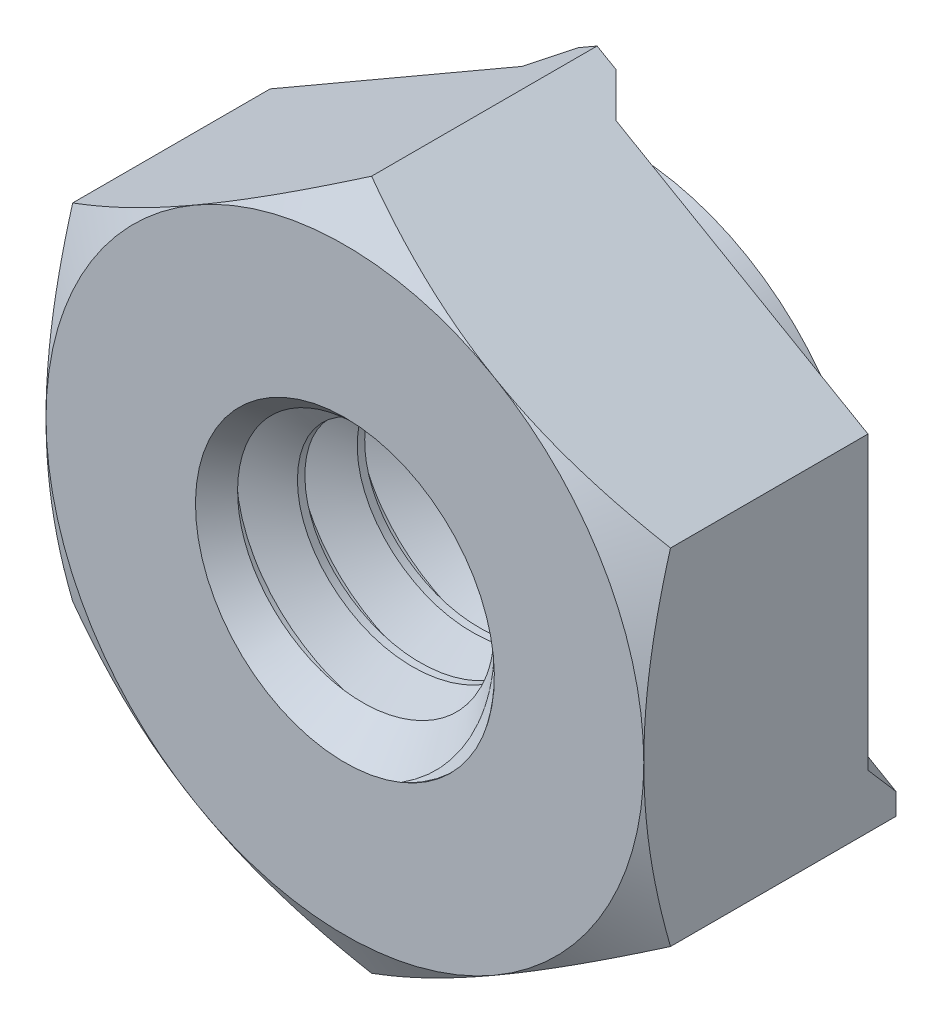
ISO-10303-21;
HEADER;
FILE_DESCRIPTION(('STEP AP214'),'2;1');
FILE_NAME('part.step','',(''),(''),'','','');
FILE_SCHEMA(('AUTOMOTIVE_DESIGN { 1 0 10303 214 1 1 1 1 }'));
ENDSEC;
DATA;
#1=APPLICATION_CONTEXT('core data for automotive mechanical design processes');
#2=APPLICATION_PROTOCOL_DEFINITION('international standard','automotive_design',2000,#1);
#3=PRODUCT_CONTEXT('',#1,'mechanical');
#4=PRODUCT('Part','Part','',(#3));
#5=PRODUCT_RELATED_PRODUCT_CATEGORY('part','',(#4));
#6=PRODUCT_DEFINITION_FORMATION('','',#4);
#7=PRODUCT_DEFINITION_CONTEXT('part definition',#1,'design');
#8=PRODUCT_DEFINITION('design','',#6,#7);
#9=PRODUCT_DEFINITION_SHAPE('','',#8);
#10=(LENGTH_UNIT() NAMED_UNIT(*) SI_UNIT(.MILLI.,.METRE.));
#11=(NAMED_UNIT(*) PLANE_ANGLE_UNIT() SI_UNIT($,.RADIAN.));
#12=(NAMED_UNIT(*) SI_UNIT($,.STERADIAN.) SOLID_ANGLE_UNIT());
#13=UNCERTAINTY_MEASURE_WITH_UNIT(LENGTH_MEASURE(1.E-05),#10,'distance_accuracy_value','');
#14=(GEOMETRIC_REPRESENTATION_CONTEXT(3) GLOBAL_UNCERTAINTY_ASSIGNED_CONTEXT((#13)) GLOBAL_UNIT_ASSIGNED_CONTEXT((#10,
#11,#12)) REPRESENTATION_CONTEXT('',''));
#15=CARTESIAN_POINT('',(0.,0.,0.));
#16=DIRECTION('',(0.,0.,1.));
#17=DIRECTION('',(1.,0.,0.));
#18=AXIS2_PLACEMENT_3D('',#15,#16,#17);
#19=CARTESIAN_POINT('',(-6.35,10.9985226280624,0.));
#20=DIRECTION('',(0.,0.,1.));
#21=DIRECTION('',(1.,0.,0.));
#22=AXIS2_PLACEMENT_3D('',#19,#20,#21);
#23=PLANE('',#22);
#24=DIRECTION('',(0.866025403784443,-0.499999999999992,0.));
#25=VECTOR('',#24,1.);
#26=CARTESIAN_POINT('',(-10.02109375,4.64000173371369,0.));
#27=LINE('',#26,#25);
#28=CARTESIAN_POINT('',(5.35781250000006,-4.23901392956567,0.));
#29=VERTEX_POINT('',#28);
#30=CARTESIAN_POINT('',(3.8886566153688,-3.3907963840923,0.));
#31=VERTEX_POINT('',#30);
#32=EDGE_CURVE('E644',#29,#31,#27,.F.);
#33=ORIENTED_EDGE('',*,*,#32,.F.);
#34=DIRECTION('',(0.866025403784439,0.5,0.));
#35=VECTOR('',#34,1.);
#36=CARTESIAN_POINT('',(0.,-7.33234841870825,0.));
#37=LINE('',#36,#35);
#38=CARTESIAN_POINT('',(0.,-7.33234841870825,0.));
#39=VERTEX_POINT('',#38);
#40=EDGE_CURVE('E575',#39,#29,#37,.T.);
#41=ORIENTED_EDGE('',*,*,#40,.F.);
#42=DIRECTION('',(0.866025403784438,-0.5,0.));
#43=VECTOR('',#42,1.);
#44=CARTESIAN_POINT('',(-6.35,-3.66617420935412,0.));
#45=LINE('',#44,#43);
#46=CARTESIAN_POINT('',(-5.35781249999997,-4.23901392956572,0.));
#47=VERTEX_POINT('',#46);
#48=EDGE_CURVE('E569',#47,#39,#45,.T.);
#49=ORIENTED_EDGE('',*,*,#48,.F.);
#50=DIRECTION('',(0.866025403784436,0.500000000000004,0.));
#51=VECTOR('',#50,1.);
#52=CARTESIAN_POINT('',(0.496093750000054,-0.859259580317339,0.));
#53=LINE('',#52,#51);
#54=CARTESIAN_POINT('',(-3.88865661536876,-3.39079638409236,0.));
#55=VERTEX_POINT('',#54);
#56=EDGE_CURVE('E283',#55,#47,#53,.F.);
#57=ORIENTED_EDGE('',*,*,#56,.F.);
#58=CARTESIAN_POINT('',(0.,0.,0.));
#59=DIRECTION('',(0.,0.,1.));
#60=DIRECTION('',(1.,0.,0.));
#61=AXIS2_PLACEMENT_3D('',#58,#59,#60);
#62=CIRCLE('',#61,5.159375);
#63=EDGE_CURVE('E618',#31,#55,#62,.F.);
#64=ORIENTED_EDGE('',*,*,#63,.F.);
#65=EDGE_LOOP('',(#33,#41,#49,#57,#64));
#66=FACE_BOUND('',#65,.T.);
#67=ADVANCED_FACE('F41',(#66),#23,.F.);
#68=DIRECTION('',(-0.866025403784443,0.499999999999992,0.));
#69=VECTOR('',#68,1.);
#70=CARTESIAN_POINT('',(-9.02890625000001,6.35852089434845,0.));
#71=LINE('',#70,#69);
#72=CARTESIAN_POINT('',(4.88084411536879,-1.67227722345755,0.));
#73=VERTEX_POINT('',#72);
#74=CARTESIAN_POINT('',(6.35,-2.52049476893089,0.));
#75=VERTEX_POINT('',#74);
#76=EDGE_CURVE('E641',#73,#75,#71,.F.);
#77=ORIENTED_EDGE('',*,*,#76,.F.);
#78=CARTESIAN_POINT('',(0.992187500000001,5.06307360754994,0.));
#79=VERTEX_POINT('',#78);
#80=EDGE_CURVE('E51',#79,#73,#62,.F.);
#81=ORIENTED_EDGE('',*,*,#80,.F.);
#82=DIRECTION('',(0.,-1.,0.));
#83=VECTOR('',#82,1.);
#84=CARTESIAN_POINT('',(0.992187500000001,6.75950869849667,0.));
#85=LINE('',#84,#83);
#86=CARTESIAN_POINT('',(0.992187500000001,6.75950869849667,0.));
#87=VERTEX_POINT('',#86);
#88=EDGE_CURVE('E311',#87,#79,#85,.T.);
#89=ORIENTED_EDGE('',*,*,#88,.F.);
#90=DIRECTION('',(-0.866025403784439,0.5,0.));
#91=VECTOR('',#90,1.);
#92=CARTESIAN_POINT('',(6.35,3.66617420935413,0.));
#93=LINE('',#92,#91);
#94=CARTESIAN_POINT('',(6.35,3.66617420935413,0.));
#95=VERTEX_POINT('',#94);
#96=EDGE_CURVE('E578',#95,#87,#93,.T.);
#97=ORIENTED_EDGE('',*,*,#96,.F.);
#98=DIRECTION('',(0.,1.,0.));
#99=VECTOR('',#98,1.);
#100=CARTESIAN_POINT('',(6.35,-3.66617420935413,0.));
#101=LINE('',#100,#99);
#102=EDGE_CURVE('E585',#75,#95,#101,.T.);
#103=ORIENTED_EDGE('',*,*,#102,.F.);
#104=EDGE_LOOP('',(#77,#81,#89,#97,#103));
#105=FACE_BOUND('',#104,.T.);
#106=ADVANCED_FACE('F535',(#105),#23,.F.);
#107=CARTESIAN_POINT('',(0.,0.,-1.190625));
#108=DIRECTION('',(0.,0.,1.));
#109=DIRECTION('',(1.,0.,0.));
#110=AXIS2_PLACEMENT_3D('',#107,#108,#109);
#111=CYLINDRICAL_SURFACE('',#110,5.159375);
#112=CARTESIAN_POINT('',(0.,0.,-1.190625));
#113=DIRECTION('',(0.,0.,-1.));
#114=DIRECTION('',(-1.,0.,0.));
#115=AXIS2_PLACEMENT_3D('',#112,#113,#114);
#116=CIRCLE('',#115,5.159375);
#117=CARTESIAN_POINT('',(-5.159375,0.,-1.190625));
#118=VERTEX_POINT('',#117);
#119=EDGE_CURVE('E426',#118,#118,#116,.T.);
#120=ORIENTED_EDGE('',*,*,#119,.F.);
#121=EDGE_LOOP('',(#120));
#122=FACE_BOUND('',#121,.T.);
#123=CARTESIAN_POINT('',(0.,0.,-0.992187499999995));
#124=DIRECTION('',(-0.353553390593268,-0.612372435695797,-0.707106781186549));
#125=DIRECTION('',(-0.353553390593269,-0.612372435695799,0.707106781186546));
#126=AXIS2_PLACEMENT_3D('',#123,#124,#125);
#127=ELLIPSE('',#126,7.29645809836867,5.159375);
#128=CARTESIAN_POINT('',(4.25647332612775,-2.91574779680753,-0.5953125));
#129=VERTEX_POINT('',#128);
#130=EDGE_CURVE('E653',#129,#31,#127,.T.);
#131=ORIENTED_EDGE('',*,*,#130,.T.);
#132=ORIENTED_EDGE('',*,*,#63,.T.);
#133=CARTESIAN_POINT('',(0.,0.,-0.992187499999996));
#134=DIRECTION('',(0.353553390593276,-0.612372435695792,-0.707106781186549));
#135=DIRECTION('',(0.353553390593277,-0.612372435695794,0.707106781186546));
#136=AXIS2_PLACEMENT_3D('',#133,#134,#135);
#137=ELLIPSE('',#136,7.29645809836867,5.159375);
#138=CARTESIAN_POINT('',(-4.25647332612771,-2.91574779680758,-0.5953125));
#139=VERTEX_POINT('',#138);
#140=EDGE_CURVE('E286',#139,#55,#137,.F.);
#141=ORIENTED_EDGE('',*,*,#140,.F.);
#142=CARTESIAN_POINT('',(0.,0.,-0.5953125));
#143=DIRECTION('',(0.,0.,1.));
#144=DIRECTION('',(0.500000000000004,-0.866025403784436,0.));
#145=AXIS2_PLACEMENT_3D('',#142,#143,#144);
#146=CIRCLE('',#145,5.159375);
#147=CARTESIAN_POINT('',(-4.65334832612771,-2.22834013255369,-0.5953125));
#148=VERTEX_POINT('',#147);
#149=EDGE_CURVE('E267',#148,#139,#146,.T.);
#150=ORIENTED_EDGE('',*,*,#149,.F.);
#151=CARTESIAN_POINT('',(0.,0.,-0.992187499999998));
#152=DIRECTION('',(-0.353553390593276,0.612372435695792,-0.707106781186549));
#153=DIRECTION('',(-0.353553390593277,0.612372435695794,0.707106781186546));
#154=AXIS2_PLACEMENT_3D('',#151,#152,#153);
#155=ELLIPSE('',#154,7.29645809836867,5.159375);
#156=CARTESIAN_POINT('',(-4.88084411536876,-1.67227722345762,0.));
#157=VERTEX_POINT('',#156);
#158=EDGE_CURVE('E676',#148,#157,#155,.T.);
#159=ORIENTED_EDGE('',*,*,#158,.T.);
#160=CARTESIAN_POINT('',(-0.992187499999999,5.06307360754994,0.));
#161=VERTEX_POINT('',#160);
#162=EDGE_CURVE('E557',#157,#161,#62,.F.);
#163=ORIENTED_EDGE('',*,*,#162,.T.);
#164=CARTESIAN_POINT('',(0.,0.,-0.992187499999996));
#165=DIRECTION('',(-0.707106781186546,0.,-0.707106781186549));
#166=DIRECTION('',(-0.707106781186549,0.,0.707106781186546));
#167=AXIS2_PLACEMENT_3D('',#164,#165,#166);
#168=ELLIPSE('',#167,7.29645809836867,5.159375);
#169=CARTESIAN_POINT('',(-0.396874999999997,5.14408792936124,-0.5953125));
#170=VERTEX_POINT('',#169);
#171=EDGE_CURVE('E687',#170,#161,#168,.F.);
#172=ORIENTED_EDGE('',*,*,#171,.F.);
#173=CARTESIAN_POINT('',(0.,0.,-0.5953125));
#174=DIRECTION('',(0.,0.,1.));
#175=DIRECTION('',(-1.,0.,0.));
#176=AXIS2_PLACEMENT_3D('',#173,#174,#175);
#177=CIRCLE('',#176,5.159375);
#178=CARTESIAN_POINT('',(0.396874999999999,5.14408792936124,-0.5953125));
#179=VERTEX_POINT('',#178);
#180=EDGE_CURVE('E689',#179,#170,#177,.T.);
#181=ORIENTED_EDGE('',*,*,#180,.F.);
#182=CARTESIAN_POINT('',(0.,0.,-0.992187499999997));
#183=DIRECTION('',(0.707106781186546,0.,-0.707106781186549));
#184=DIRECTION('',(0.707106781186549,0.,0.707106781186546));
#185=AXIS2_PLACEMENT_3D('',#182,#183,#184);
#186=ELLIPSE('',#185,7.29645809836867,5.159375);
#187=EDGE_CURVE('E635',#179,#79,#186,.T.);
#188=ORIENTED_EDGE('',*,*,#187,.T.);
#189=ORIENTED_EDGE('',*,*,#80,.T.);
#190=CARTESIAN_POINT('',(0.,0.,-0.992187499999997));
#191=DIRECTION('',(0.353553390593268,0.612372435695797,-0.707106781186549));
#192=DIRECTION('',(0.353553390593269,0.612372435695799,0.707106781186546));
#193=AXIS2_PLACEMENT_3D('',#190,#191,#192);
#194=ELLIPSE('',#193,7.29645809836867,5.159375);
#195=CARTESIAN_POINT('',(4.65334832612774,-2.22834013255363,-0.5953125));
#196=VERTEX_POINT('',#195);
#197=EDGE_CURVE('E633',#196,#73,#194,.F.);
#198=ORIENTED_EDGE('',*,*,#197,.F.);
#199=CARTESIAN_POINT('',(0.,0.,-0.5953125));
#200=DIRECTION('',(0.,0.,1.));
#201=DIRECTION('',(0.499999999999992,0.866025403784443,0.));
#202=AXIS2_PLACEMENT_3D('',#199,#200,#201);
#203=CIRCLE('',#202,5.159375);
#204=EDGE_CURVE('E658',#129,#196,#203,.T.);
#205=ORIENTED_EDGE('',*,*,#204,.F.);
#206=EDGE_LOOP('',(#131,#132,#141,#150,#159,#163,#172,#181,#188,#189,#198,#205));
#207=FACE_BOUND('',#206,.T.);
#208=ADVANCED_FACE('F463',(#122,#207),#111,.T.);
#209=DIRECTION('',(-0.866025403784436,-0.500000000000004,0.));
#210=VECTOR('',#209,1.);
#211=CARTESIAN_POINT('',(-0.496093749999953,0.859259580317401,0.));
#212=LINE('',#211,#210);
#213=CARTESIAN_POINT('',(-6.35,-2.52049476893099,0.));
#214=VERTEX_POINT('',#213);
#215=EDGE_CURVE('E552',#214,#157,#212,.F.);
#216=ORIENTED_EDGE('',*,*,#215,.F.);
#217=DIRECTION('',(0.,-1.,0.));
#218=VECTOR('',#217,1.);
#219=CARTESIAN_POINT('',(-6.35,3.66617420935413,0.));
#220=LINE('',#219,#218);
#221=CARTESIAN_POINT('',(-6.35,3.66617420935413,0.));
#222=VERTEX_POINT('',#221);
#223=EDGE_CURVE('E555',#222,#214,#220,.T.);
#224=ORIENTED_EDGE('',*,*,#223,.F.);
#225=DIRECTION('',(-0.866025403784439,-0.5,0.));
#226=VECTOR('',#225,1.);
#227=CARTESIAN_POINT('',(0.,7.33234841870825,0.));
#228=LINE('',#227,#226);
#229=CARTESIAN_POINT('',(-0.992187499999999,6.75950869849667,0.));
#230=VERTEX_POINT('',#229);
#231=EDGE_CURVE('E570',#230,#222,#228,.T.);
#232=ORIENTED_EDGE('',*,*,#231,.F.);
#233=DIRECTION('',(0.,1.,0.));
#234=VECTOR('',#233,1.);
#235=CARTESIAN_POINT('',(-0.992187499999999,6.75950869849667,0.));
#236=LINE('',#235,#234);
#237=EDGE_CURVE('E304',#161,#230,#236,.T.);
#238=ORIENTED_EDGE('',*,*,#237,.F.);
#239=ORIENTED_EDGE('',*,*,#162,.F.);
#240=EDGE_LOOP('',(#216,#224,#232,#238,#239));
#241=FACE_BOUND('',#240,.T.);
#242=ADVANCED_FACE('F364',(#241),#23,.F.);
#243=CARTESIAN_POINT('',(3.17499999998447,-9.93103914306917E-06,-1.82562436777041));
#244=CARTESIAN_POINT('',(3.17499426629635,-1.83309703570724,-1.71979103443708));
#245=CARTESIAN_POINT('',(1.58749139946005,-2.74963562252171,-1.61395770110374));
#246=CARTESIAN_POINT('',(-1.14673762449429E-05,-3.66617420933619,-1.50812436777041));
#247=CARTESIAN_POINT('',(-1.58750860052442,-2.74962569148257,-1.40229103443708));
#248=CARTESIAN_POINT('',(-3.17500573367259,-1.83307717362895,-1.29645770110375));
#249=CARTESIAN_POINT('',(-3.17499999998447,9.93103914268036E-06,-1.19062436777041));
#250=CARTESIAN_POINT('',(-3.17499426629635,1.83309703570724,-1.08479103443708));
#251=CARTESIAN_POINT('',(-1.58749139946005,2.74963562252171,-0.978957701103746));
#252=CARTESIAN_POINT('',(1.14673762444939E-05,3.66617420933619,-0.873124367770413));
#253=CARTESIAN_POINT('',(1.58750860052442,2.74962569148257,-0.76729103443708));
#254=CARTESIAN_POINT('',(3.17500573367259,1.83307717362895,-0.661457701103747));
#255=CARTESIAN_POINT('',(3.17499999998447,-9.93103914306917E-06,-0.555624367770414));
#256=CARTESIAN_POINT('',(3.17499426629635,-1.83309703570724,-0.449791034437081));
#257=CARTESIAN_POINT('',(1.58749139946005,-2.74963562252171,-0.343957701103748));
#258=CARTESIAN_POINT('',(-1.14673762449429E-05,-3.66617420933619,-0.238124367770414));
#259=CARTESIAN_POINT('',(-1.58750860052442,-2.74962569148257,-0.132291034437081));
#260=CARTESIAN_POINT('',(-3.17500573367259,-1.83307717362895,-0.0264577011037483));
#261=CARTESIAN_POINT('',(-3.17499999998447,9.93103914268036E-06,0.0793756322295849));
#262=CARTESIAN_POINT('',(-3.17499426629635,1.83309703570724,0.185208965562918));
#263=CARTESIAN_POINT('',(-1.58749139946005,2.74963562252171,0.291042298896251));
#264=CARTESIAN_POINT('',(1.14673762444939E-05,3.66617420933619,0.396875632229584));
#265=CARTESIAN_POINT('',(1.58750860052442,2.74962569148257,0.502708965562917));
#266=CARTESIAN_POINT('',(3.17500573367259,1.83307717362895,0.608542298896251));
#267=CARTESIAN_POINT('',(3.17499999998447,-9.93103914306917E-06,0.714375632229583));
#268=CARTESIAN_POINT('',(3.17499426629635,-1.83309703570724,0.820208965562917));
#269=CARTESIAN_POINT('',(1.58749139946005,-2.74963562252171,0.92604229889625));
#270=CARTESIAN_POINT('',(-1.14673762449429E-05,-3.66617420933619,1.03187563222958));
#271=CARTESIAN_POINT('',(-1.58750860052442,-2.74962569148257,1.13770896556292));
#272=CARTESIAN_POINT('',(-3.17500573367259,-1.83307717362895,1.24354229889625));
#273=CARTESIAN_POINT('',(-3.17499999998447,9.93103914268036E-06,1.34937563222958));
#274=CARTESIAN_POINT('',(-3.17499426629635,1.83309703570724,1.45520896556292));
#275=CARTESIAN_POINT('',(-1.58749139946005,2.74963562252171,1.56104229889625));
#276=CARTESIAN_POINT('',(1.14673762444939E-05,3.66617420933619,1.66687563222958));
#277=CARTESIAN_POINT('',(1.58750860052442,2.74962569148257,1.77270896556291));
#278=CARTESIAN_POINT('',(3.17500573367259,1.83307717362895,1.87854229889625));
#279=CARTESIAN_POINT('',(3.17499999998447,-9.93103914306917E-06,1.98437563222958));
#280=CARTESIAN_POINT('',(3.17499426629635,-1.83309703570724,2.09020896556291));
#281=CARTESIAN_POINT('',(1.58749139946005,-2.74963562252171,2.19604229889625));
#282=CARTESIAN_POINT('',(-1.14673762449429E-05,-3.66617420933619,2.30187563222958));
#283=CARTESIAN_POINT('',(-1.58750860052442,-2.74962569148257,2.40770896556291));
#284=CARTESIAN_POINT('',(-3.17500573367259,-1.83307717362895,2.51354229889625));
#285=CARTESIAN_POINT('',(-3.17499999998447,9.93103914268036E-06,2.61937563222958));
#286=CARTESIAN_POINT('',(-3.17499426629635,1.83309703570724,2.72520896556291));
#287=CARTESIAN_POINT('',(-1.58749139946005,2.74963562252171,2.83104229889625));
#288=CARTESIAN_POINT('',(1.14673762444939E-05,3.66617420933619,2.93687563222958));
#289=CARTESIAN_POINT('',(1.58750860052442,2.74962569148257,3.04270896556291));
#290=CARTESIAN_POINT('',(3.17500573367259,1.83307717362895,3.14854229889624));
#291=CARTESIAN_POINT('',(3.17499999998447,-9.93103914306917E-06,3.25437563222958));
#292=CARTESIAN_POINT('',(3.17499426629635,-1.83309703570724,3.36020896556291));
#293=CARTESIAN_POINT('',(1.58749139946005,-2.74963562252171,3.46604229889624));
#294=CARTESIAN_POINT('',(-1.14673762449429E-05,-3.66617420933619,3.57187563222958));
#295=CARTESIAN_POINT('',(-1.58750860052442,-2.74962569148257,3.67770896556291));
#296=CARTESIAN_POINT('',(-3.17500573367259,-1.83307717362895,3.78354229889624));
#297=CARTESIAN_POINT('',(-3.17499999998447,9.93103914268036E-06,3.88937563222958));
#298=CARTESIAN_POINT('',(-3.17499426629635,1.83309703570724,3.99520896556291));
#299=CARTESIAN_POINT('',(-1.58749139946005,2.74963562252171,4.10104229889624));
#300=CARTESIAN_POINT('',(1.14673762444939E-05,3.66617420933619,4.20687563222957));
#301=CARTESIAN_POINT('',(1.58750860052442,2.74962569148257,4.31270896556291));
#302=CARTESIAN_POINT('',(3.17500573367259,1.83307717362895,4.41854229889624));
#303=CARTESIAN_POINT('',(3.17499999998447,-9.93103914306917E-06,4.52437563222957));
#304=CARTESIAN_POINT('',(3.17499426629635,-1.83309703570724,4.63020896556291));
#305=CARTESIAN_POINT('',(1.58749139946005,-2.74963562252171,4.73604229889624));
#306=CARTESIAN_POINT('',(-1.14673762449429E-05,-3.66617420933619,4.84187563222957));
#307=CARTESIAN_POINT('',(-1.58750860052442,-2.74962569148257,4.94770896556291));
#308=CARTESIAN_POINT('',(-3.17500573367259,-1.83307717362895,5.05354229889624));
#309=CARTESIAN_POINT('',(-3.17499999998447,9.93103914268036E-06,5.15937563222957));
#310=CARTESIAN_POINT('',(-3.17499426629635,1.83309703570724,5.26520896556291));
#311=CARTESIAN_POINT('',(-1.58749139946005,2.74963562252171,5.37104229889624));
#312=CARTESIAN_POINT('',(1.14673762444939E-05,3.66617420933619,5.47687563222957));
#313=CARTESIAN_POINT('',(1.58750860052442,2.74962569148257,5.58270896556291));
#314=CARTESIAN_POINT('',(3.17500573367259,1.83307717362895,5.68854229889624));
#315=CARTESIAN_POINT('',(3.17499999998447,-9.93103914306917E-06,5.79437563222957));
#316=CARTESIAN_POINT('',(3.17499426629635,-1.83309703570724,5.9002089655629));
#317=CARTESIAN_POINT('',(1.58749139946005,-2.74963562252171,6.00604229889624));
#318=CARTESIAN_POINT('',(-1.14673762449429E-05,-3.66617420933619,6.11187563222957));
#319=CARTESIAN_POINT('',(-1.58750860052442,-2.74962569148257,6.2177089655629));
#320=CARTESIAN_POINT('',(-3.17500573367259,-1.83307717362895,6.32354229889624));
#321=CARTESIAN_POINT('',(-3.17499999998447,9.93103914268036E-06,6.42937563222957));
#322=CARTESIAN_POINT('',(-3.17499426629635,1.83309703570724,6.5352089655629));
#323=CARTESIAN_POINT('',(-1.58749139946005,2.74963562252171,6.64104229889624));
#324=CARTESIAN_POINT('',(1.14673762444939E-05,3.66617420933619,6.74687563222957));
#325=CARTESIAN_POINT('',(1.58750860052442,2.74962569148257,6.8527089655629));
#326=CARTESIAN_POINT('',(3.17500573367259,1.83307717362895,6.95854229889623));
#327=CARTESIAN_POINT('',(3.17499999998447,-9.93103914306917E-06,7.06437563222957));
#328=CARTESIAN_POINT('',(3.17499426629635,-1.83309703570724,7.1702089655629));
#329=CARTESIAN_POINT('',(1.58749139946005,-2.74963562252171,7.27604229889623));
#330=CARTESIAN_POINT('',(-1.14673762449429E-05,-3.66617420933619,7.38187563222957));
#331=CARTESIAN_POINT('',(-1.58750860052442,-2.74962569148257,7.4877089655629));
#332=CARTESIAN_POINT('',(-3.17500573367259,-1.83307717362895,7.59354229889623));
#333=CARTESIAN_POINT('',(-3.17499999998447,9.93103914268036E-06,7.69937563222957));
#334=CARTESIAN_POINT('',(-3.17499426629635,1.83309703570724,7.8052089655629));
#335=CARTESIAN_POINT('',(-1.58749139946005,2.74963562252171,7.91104229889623));
#336=CARTESIAN_POINT('',(1.14673762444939E-05,3.66617420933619,8.01687563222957));
#337=CARTESIAN_POINT('',(1.58750860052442,2.74962569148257,8.1227089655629));
#338=CARTESIAN_POINT('',(3.17500573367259,1.83307717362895,8.22854229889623));
#339=CARTESIAN_POINT('',(3.17499999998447,-9.93103914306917E-06,8.33437563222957));
#340=CARTESIAN_POINT('',(3.17499426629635,-1.83309703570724,8.4402089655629));
#341=CARTESIAN_POINT('',(1.58749139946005,-2.74963562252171,8.54604229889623));
#342=CARTESIAN_POINT('',(-1.14673762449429E-05,-3.66617420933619,8.65187563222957));
#343=CARTESIAN_POINT('',(-1.58750860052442,-2.74962569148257,8.7577089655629));
#344=CARTESIAN_POINT('',(-3.17500573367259,-1.83307717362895,8.86354229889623));
#345=CARTESIAN_POINT('',(-3.17499999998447,9.93103914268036E-06,8.96937563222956));
#346=CARTESIAN_POINT('',(-3.17499426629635,1.83309703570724,9.0752089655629));
#347=CARTESIAN_POINT('',(-1.58749139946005,2.74963562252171,9.18104229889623));
#348=CARTESIAN_POINT('',(1.14673762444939E-05,3.66617420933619,9.28687563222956));
#349=CARTESIAN_POINT('',(1.58750860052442,2.74962569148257,9.3927089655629));
#350=CARTESIAN_POINT('',(3.17500573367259,1.83307717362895,9.49854229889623));
#351=CARTESIAN_POINT('',(3.17499999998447,-9.93103914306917E-06,9.60437563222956));
#352=CARTESIAN_POINT('',(2.35011080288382,-7.35087948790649E-06,-2.30187436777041));
#353=CARTESIAN_POINT('',(2.35010655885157,-1.35684445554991,-2.19604103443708));
#354=CARTESIAN_POINT('',(1.17504903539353,-2.03525933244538,-2.09020770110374));
#355=CARTESIAN_POINT('',(-8.48806450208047E-06,-2.71367420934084,-1.98437436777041));
#356=CARTESIAN_POINT('',(-1.17506176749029,-2.03525198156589,-1.87854103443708));
#357=CARTESIAN_POINT('',(-2.35011504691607,-1.35682975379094,-1.77270770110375));
#358=CARTESIAN_POINT('',(-2.35011080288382,7.3508794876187E-06,-1.66687436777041));
#359=CARTESIAN_POINT('',(-2.35010655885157,1.35684445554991,-1.56104103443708));
#360=CARTESIAN_POINT('',(-1.17504903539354,2.03525933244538,-1.45520770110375));
#361=CARTESIAN_POINT('',(8.48806450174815E-06,2.71367420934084,-1.34937436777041));
#362=CARTESIAN_POINT('',(1.17506176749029,2.03525198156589,-1.24354103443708));
#363=CARTESIAN_POINT('',(2.35011504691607,1.35682975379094,-1.13770770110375));
#364=CARTESIAN_POINT('',(2.35011080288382,-7.35087948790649E-06,-1.03187436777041));
#365=CARTESIAN_POINT('',(2.35010655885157,-1.35684445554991,-0.92604103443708));
#366=CARTESIAN_POINT('',(1.17504903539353,-2.03525933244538,-0.820207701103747));
#367=CARTESIAN_POINT('',(-8.48806450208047E-06,-2.71367420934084,-0.714374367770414));
#368=CARTESIAN_POINT('',(-1.17506176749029,-2.03525198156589,-0.608541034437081));
#369=CARTESIAN_POINT('',(-2.35011504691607,-1.35682975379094,-0.502707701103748));
#370=CARTESIAN_POINT('',(-2.35011080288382,7.3508794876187E-06,-0.396874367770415));
#371=CARTESIAN_POINT('',(-2.35010655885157,1.35684445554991,-0.291041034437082));
#372=CARTESIAN_POINT('',(-1.17504903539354,2.03525933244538,-0.185207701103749));
#373=CARTESIAN_POINT('',(8.48806450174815E-06,2.71367420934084,-0.0793743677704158));
#374=CARTESIAN_POINT('',(1.17506176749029,2.03525198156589,0.0264589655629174));
#375=CARTESIAN_POINT('',(2.35011504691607,1.35682975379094,0.132292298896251));
#376=CARTESIAN_POINT('',(2.35011080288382,-7.35087948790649E-06,0.238125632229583));
#377=CARTESIAN_POINT('',(2.35010655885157,-1.35684445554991,0.343958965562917));
#378=CARTESIAN_POINT('',(1.17504903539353,-2.03525933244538,0.44979229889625));
#379=CARTESIAN_POINT('',(-8.48806450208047E-06,-2.71367420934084,0.555625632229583));
#380=CARTESIAN_POINT('',(-1.17506176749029,-2.03525198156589,0.661458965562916));
#381=CARTESIAN_POINT('',(-2.35011504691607,-1.35682975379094,0.767292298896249));
#382=CARTESIAN_POINT('',(-2.35011080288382,7.3508794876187E-06,0.873125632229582));
#383=CARTESIAN_POINT('',(-2.35010655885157,1.35684445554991,0.978958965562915));
#384=CARTESIAN_POINT('',(-1.17504903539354,2.03525933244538,1.08479229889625));
#385=CARTESIAN_POINT('',(8.48806450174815E-06,2.71367420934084,1.19062563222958));
#386=CARTESIAN_POINT('',(1.17506176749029,2.03525198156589,1.29645896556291));
#387=CARTESIAN_POINT('',(2.35011504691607,1.35682975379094,1.40229229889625));
#388=CARTESIAN_POINT('',(2.35011080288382,-7.35087948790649E-06,1.50812563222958));
#389=CARTESIAN_POINT('',(2.35010655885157,-1.35684445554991,1.61395896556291));
#390=CARTESIAN_POINT('',(1.17504903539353,-2.03525933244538,1.71979229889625));
#391=CARTESIAN_POINT('',(-8.48806450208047E-06,-2.71367420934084,1.82562563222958));
#392=CARTESIAN_POINT('',(-1.17506176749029,-2.03525198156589,1.93145896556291));
#393=CARTESIAN_POINT('',(-2.35011504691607,-1.35682975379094,2.03729229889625));
#394=CARTESIAN_POINT('',(-2.35011080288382,7.3508794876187E-06,2.14312563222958));
#395=CARTESIAN_POINT('',(-2.35010655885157,1.35684445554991,2.24895896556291));
#396=CARTESIAN_POINT('',(-1.17504903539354,2.03525933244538,2.35479229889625));
#397=CARTESIAN_POINT('',(8.48806450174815E-06,2.71367420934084,2.46062563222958));
#398=CARTESIAN_POINT('',(1.17506176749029,2.03525198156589,2.56645896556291));
#399=CARTESIAN_POINT('',(2.35011504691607,1.35682975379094,2.67229229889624));
#400=CARTESIAN_POINT('',(2.35011080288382,-7.35087948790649E-06,2.77812563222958));
#401=CARTESIAN_POINT('',(2.35010655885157,-1.35684445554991,2.88395896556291));
#402=CARTESIAN_POINT('',(1.17504903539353,-2.03525933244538,2.98979229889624));
#403=CARTESIAN_POINT('',(-8.48806450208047E-06,-2.71367420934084,3.09562563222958));
#404=CARTESIAN_POINT('',(-1.17506176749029,-2.03525198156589,3.20145896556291));
#405=CARTESIAN_POINT('',(-2.35011504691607,-1.35682975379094,3.30729229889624));
#406=CARTESIAN_POINT('',(-2.35011080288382,7.3508794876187E-06,3.41312563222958));
#407=CARTESIAN_POINT('',(-2.35010655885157,1.35684445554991,3.51895896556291));
#408=CARTESIAN_POINT('',(-1.17504903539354,2.03525933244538,3.62479229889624));
#409=CARTESIAN_POINT('',(8.48806450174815E-06,2.71367420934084,3.73062563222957));
#410=CARTESIAN_POINT('',(1.17506176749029,2.03525198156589,3.83645896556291));
#411=CARTESIAN_POINT('',(2.35011504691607,1.35682975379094,3.94229229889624));
#412=CARTESIAN_POINT('',(2.35011080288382,-7.35087948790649E-06,4.04812563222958));
#413=CARTESIAN_POINT('',(2.35010655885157,-1.35684445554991,4.15395896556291));
#414=CARTESIAN_POINT('',(1.17504903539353,-2.03525933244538,4.25979229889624));
#415=CARTESIAN_POINT('',(-8.48806450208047E-06,-2.71367420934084,4.36562563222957));
#416=CARTESIAN_POINT('',(-1.17506176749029,-2.03525198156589,4.47145896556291));
#417=CARTESIAN_POINT('',(-2.35011504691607,-1.35682975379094,4.57729229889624));
#418=CARTESIAN_POINT('',(-2.35011080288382,7.3508794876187E-06,4.68312563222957));
#419=CARTESIAN_POINT('',(-2.35010655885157,1.35684445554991,4.78895896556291));
#420=CARTESIAN_POINT('',(-1.17504903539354,2.03525933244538,4.89479229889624));
#421=CARTESIAN_POINT('',(8.48806450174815E-06,2.71367420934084,5.00062563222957));
#422=CARTESIAN_POINT('',(1.17506176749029,2.03525198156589,5.10645896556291));
#423=CARTESIAN_POINT('',(2.35011504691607,1.35682975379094,5.21229229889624));
#424=CARTESIAN_POINT('',(2.35011080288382,-7.35087948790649E-06,5.31812563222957));
#425=CARTESIAN_POINT('',(2.35010655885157,-1.35684445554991,5.42395896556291));
#426=CARTESIAN_POINT('',(1.17504903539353,-2.03525933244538,5.52979229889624));
#427=CARTESIAN_POINT('',(-8.48806450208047E-06,-2.71367420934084,5.63562563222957));
#428=CARTESIAN_POINT('',(-1.17506176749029,-2.03525198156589,5.7414589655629));
#429=CARTESIAN_POINT('',(-2.35011504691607,-1.35682975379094,5.84729229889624));
#430=CARTESIAN_POINT('',(-2.35011080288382,7.3508794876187E-06,5.95312563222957));
#431=CARTESIAN_POINT('',(-2.35010655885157,1.35684445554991,6.0589589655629));
#432=CARTESIAN_POINT('',(-1.17504903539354,2.03525933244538,6.16479229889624));
#433=CARTESIAN_POINT('',(8.48806450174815E-06,2.71367420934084,6.27062563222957));
#434=CARTESIAN_POINT('',(1.17506176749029,2.03525198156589,6.3764589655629));
#435=CARTESIAN_POINT('',(2.35011504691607,1.35682975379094,6.48229229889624));
#436=CARTESIAN_POINT('',(2.35011080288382,-7.35087948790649E-06,6.58812563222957));
#437=CARTESIAN_POINT('',(2.35010655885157,-1.35684445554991,6.6939589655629));
#438=CARTESIAN_POINT('',(1.17504903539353,-2.03525933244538,6.79979229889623));
#439=CARTESIAN_POINT('',(-8.48806450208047E-06,-2.71367420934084,6.90562563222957));
#440=CARTESIAN_POINT('',(-1.17506176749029,-2.03525198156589,7.0114589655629));
#441=CARTESIAN_POINT('',(-2.35011504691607,-1.35682975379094,7.11729229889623));
#442=CARTESIAN_POINT('',(-2.35011080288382,7.3508794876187E-06,7.22312563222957));
#443=CARTESIAN_POINT('',(-2.35010655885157,1.35684445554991,7.3289589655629));
#444=CARTESIAN_POINT('',(-1.17504903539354,2.03525933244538,7.43479229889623));
#445=CARTESIAN_POINT('',(8.48806450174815E-06,2.71367420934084,7.54062563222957));
#446=CARTESIAN_POINT('',(1.17506176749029,2.03525198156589,7.6464589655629));
#447=CARTESIAN_POINT('',(2.35011504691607,1.35682975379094,7.75229229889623));
#448=CARTESIAN_POINT('',(2.35011080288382,-7.35087948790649E-06,7.85812563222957));
#449=CARTESIAN_POINT('',(2.35010655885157,-1.35684445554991,7.9639589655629));
#450=CARTESIAN_POINT('',(1.17504903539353,-2.03525933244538,8.06979229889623));
#451=CARTESIAN_POINT('',(-8.48806450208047E-06,-2.71367420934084,8.17562563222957));
#452=CARTESIAN_POINT('',(-1.17506176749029,-2.03525198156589,8.2814589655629));
#453=CARTESIAN_POINT('',(-2.35011504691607,-1.35682975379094,8.38729229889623));
#454=CARTESIAN_POINT('',(-2.35011080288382,7.3508794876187E-06,8.49312563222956));
#455=CARTESIAN_POINT('',(-2.35010655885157,1.35684445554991,8.5989589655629));
#456=CARTESIAN_POINT('',(-1.17504903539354,2.03525933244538,8.70479229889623));
#457=CARTESIAN_POINT('',(8.48806450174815E-06,2.71367420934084,8.81062563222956));
#458=CARTESIAN_POINT('',(1.17506176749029,2.03525198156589,8.9164589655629));
#459=CARTESIAN_POINT('',(2.35011504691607,1.35682975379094,9.02229229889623));
#460=CARTESIAN_POINT('',(2.35011080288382,-7.35087948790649E-06,9.12812563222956));
#461=(BOUNDED_SURFACE() B_SPLINE_SURFACE(1,2,((#243,#244,#245,#246,#247,#248,#249,#250,#251,
#252,#253,#254,#255,#256,#257,#258,#259,#260,#261,#262,#263,#264,#265,#266,#267,#268,#269,#270,
#271,#272,#273,#274,#275,#276,#277,#278,#279,#280,#281,#282,#283,#284,#285,#286,#287,#288,#289,
#290,#291,#292,#293,#294,#295,#296,#297,#298,#299,#300,#301,#302,#303,#304,#305,#306,#307,#308,
#309,#310,#311,#312,#313,#314,#315,#316,#317,#318,#319,#320,#321,#322,#323,#324,#325,#326,#327,
#328,#329,#330,#331,#332,#333,#334,#335,#336,#337,#338,#339,#340,#341,#342,#343,#344,#345,#346,
#347,#348,#349,#350,#351),(#352,#353,#354,#355,#356,#357,#358,#359,#360,#361,#362,#363,#364,
#365,#366,#367,#368,#369,#370,#371,#372,#373,#374,#375,#376,#377,#378,#379,#380,#381,#382,#383,
#384,#385,#386,#387,#388,#389,#390,#391,#392,#393,#394,#395,#396,#397,#398,#399,#400,#401,#402,
#403,#404,#405,#406,#407,#408,#409,#410,#411,#412,#413,#414,#415,#416,#417,#418,#419,#420,#421,
#422,#423,#424,#425,#426,#427,#428,#429,#430,#431,#432,#433,#434,#435,#436,#437,#438,#439,#440,
#441,#442,#443,#444,#445,#446,#447,#448,#449,#450,#451,#452,#453,#454,#455,#456,#457,#458,#459,
#460)),.UNSPECIFIED.,.F.,.F.,.F.) B_SPLINE_SURFACE_WITH_KNOTS((2,2),(3,2,2,2,2,2,2,2,2,2,2,2,2,
2,2,2,2,2,2,2,2,2,2,2,2,2,2,2,2,2,2,2,2,2,2,2,2,2,2,2,2,2,2,2,2,2,2,2,2,2,2,2,2,2,3),(0.,1.),
(0.,0.0185185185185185,0.037037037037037,0.0555555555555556,0.0740740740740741,
0.0925925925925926,0.111111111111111,0.12962962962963,0.148148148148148,0.166666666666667,
0.185185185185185,0.203703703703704,0.222222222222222,0.240740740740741,0.259259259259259,
0.277777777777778,0.296296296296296,0.314814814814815,0.333333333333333,0.351851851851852,
0.37037037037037,0.388888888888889,0.407407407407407,0.425925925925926,0.444444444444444,
0.462962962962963,0.481481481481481,0.5,0.518518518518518,0.537037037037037,0.555555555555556,
0.574074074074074,0.592592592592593,0.611111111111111,0.62962962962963,0.648148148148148,
0.666666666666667,0.685185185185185,0.703703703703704,0.722222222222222,0.740740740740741,
0.759259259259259,0.777777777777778,0.796296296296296,0.814814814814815,0.833333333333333,
0.851851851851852,0.87037037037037,0.888888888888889,0.907407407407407,0.925925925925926,
0.944444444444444,0.962962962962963,0.981481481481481,1.),
.UNSPECIFIED.) GEOMETRIC_REPRESENTATION_ITEM() RATIONAL_B_SPLINE_SURFACE(((1.,0.866025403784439,
1.,0.866025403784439,1.,0.866025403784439,1.,0.866025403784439,1.,0.866025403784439,1.,
0.866025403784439,1.,0.866025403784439,1.,0.866025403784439,1.,0.866025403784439,1.,
0.866025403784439,1.,0.866025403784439,1.,0.866025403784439,1.,0.866025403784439,1.,
0.866025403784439,1.,0.866025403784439,1.,0.866025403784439,1.,0.866025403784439,1.,
0.866025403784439,1.,0.866025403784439,1.,0.866025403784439,1.,0.866025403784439,1.,
0.866025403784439,1.,0.866025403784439,1.,0.866025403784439,1.,0.866025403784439,1.,
0.866025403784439,1.,0.866025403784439,1.,0.866025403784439,1.,0.866025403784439,1.,
0.866025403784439,1.,0.866025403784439,1.,0.866025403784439,1.,0.866025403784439,1.,
0.866025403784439,1.,0.866025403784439,1.,0.866025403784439,1.,0.866025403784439,1.,
0.866025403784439,1.,0.866025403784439,1.,0.866025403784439,1.,0.866025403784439,1.,
0.866025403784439,1.,0.866025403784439,1.,0.866025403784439,1.,0.866025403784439,1.,
0.866025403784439,1.,0.866025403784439,1.,0.866025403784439,1.,0.866025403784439,1.,
0.866025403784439,1.,0.866025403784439,1.,0.866025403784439,1.,0.866025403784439,1.,
0.866025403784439,1.),(1.,0.866025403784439,1.,0.866025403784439,1.,0.866025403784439,1.,
0.866025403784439,1.,0.866025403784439,1.,0.866025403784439,1.,0.866025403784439,1.,
0.866025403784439,1.,0.866025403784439,1.,0.866025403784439,1.,0.866025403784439,1.,
0.866025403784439,1.,0.866025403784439,1.,0.866025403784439,1.,0.866025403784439,1.,
0.866025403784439,1.,0.866025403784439,1.,0.866025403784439,1.,0.866025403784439,1.,
0.866025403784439,1.,0.866025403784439,1.,0.866025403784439,1.,0.866025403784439,1.,
0.866025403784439,1.,0.866025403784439,1.,0.866025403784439,1.,0.866025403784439,1.,
0.866025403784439,1.,0.866025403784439,1.,0.866025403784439,1.,0.866025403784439,1.,
0.866025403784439,1.,0.866025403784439,1.,0.866025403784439,1.,0.866025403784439,1.,
0.866025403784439,1.,0.866025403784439,1.,0.866025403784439,1.,0.866025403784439,1.,
0.866025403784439,1.,0.866025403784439,1.,0.866025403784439,1.,0.866025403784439,1.,
0.866025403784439,1.,0.866025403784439,1.,0.866025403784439,1.,0.866025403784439,1.,
0.866025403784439,1.,0.866025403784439,1.,0.866025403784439,1.,0.866025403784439,1.,
0.866025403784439,1.,0.866025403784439,1.,0.866025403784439,1.))) REPRESENTATION_ITEM('') SURFACE());
#462=CARTESIAN_POINT('',(1.19062527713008,-2.94330366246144,4.7625));
#463=CARTESIAN_POINT('',(1.22924423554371,-2.92069534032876,4.75602311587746));
#464=CARTESIAN_POINT('',(1.26741341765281,-2.89730836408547,4.74958301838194));
#465=CARTESIAN_POINT('',(1.3428017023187,-2.84900272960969,4.73678087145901));
#466=CARTESIAN_POINT('',(1.3800204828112,-2.82408356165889,4.73041884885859));
#467=CARTESIAN_POINT('',(1.45345822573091,-2.77273566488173,4.71777707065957));
#468=CARTESIAN_POINT('',(1.48967644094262,-2.74630585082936,4.71149737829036));
#469=CARTESIAN_POINT('',(1.54320441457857,-2.70559374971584,4.70217892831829));
#470=CARTESIAN_POINT('',(1.56091345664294,-2.69184547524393,4.69908969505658));
#471=CARTESIAN_POINT('',(1.59599735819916,-2.66393953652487,4.69286446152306));
#472=CARTESIAN_POINT('',(1.61337222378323,-2.64978187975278,4.68972846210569));
#473=CARTESIAN_POINT('',(1.66498050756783,-2.60671065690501,4.68025492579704));
#474=CARTESIAN_POINT('',(1.6987029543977,-2.57719479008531,4.67385093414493));
#475=CARTESIAN_POINT('',(1.76470194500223,-2.51662881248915,4.66087409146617));
#476=CARTESIAN_POINT('',(1.79697841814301,-2.48557862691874,4.6543012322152));
#477=CARTESIAN_POINT('',(1.89150799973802,-2.39025106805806,4.63434724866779));
#478=CARTESIAN_POINT('',(1.9515074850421,-2.32375810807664,4.62072224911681));
#479=CARTESIAN_POINT('',(2.06300196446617,-2.18782868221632,4.59337478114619));
#480=CARTESIAN_POINT('',(2.11471524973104,-2.11856664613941,4.57967103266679));
#481=CARTESIAN_POINT('',(2.21158383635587,-1.97566424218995,4.55180362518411));
#482=CARTESIAN_POINT('',(2.25673813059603,-1.90202320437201,4.5376398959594));
#483=CARTESIAN_POINT('',(2.34005776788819,-1.75106763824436,4.50895317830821));
#484=CARTESIAN_POINT('',(2.37823089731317,-1.67375732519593,4.49443061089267));
#485=CARTESIAN_POINT('',(2.44733758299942,-1.51602275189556,4.46510118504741));
#486=CARTESIAN_POINT('',(2.47827169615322,-1.43559873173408,4.4502943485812));
#487=CARTESIAN_POINT('',(2.53086995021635,-1.27764040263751,4.42147105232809));
#488=CARTESIAN_POINT('',(2.55300822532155,-1.20026136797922,4.4074662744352));
#489=CARTESIAN_POINT('',(2.5905846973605,-1.04391558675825,4.37938532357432));
#490=CARTESIAN_POINT('',(2.60602385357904,-0.964949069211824,4.36530916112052));
#491=CARTESIAN_POINT('',(2.63011012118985,-0.805892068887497,4.33716560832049));
#492=CARTESIAN_POINT('',(2.63874932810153,-0.725800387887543,4.32309824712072));
#493=CARTESIAN_POINT('',(2.64914610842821,-0.56511610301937,4.29509048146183));
#494=CARTESIAN_POINT('',(2.650901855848,-0.484523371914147,4.28115011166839));
#495=CARTESIAN_POINT('',(2.64835940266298,-0.363582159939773,4.26040320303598));
#496=CARTESIAN_POINT('',(2.64664069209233,-0.323179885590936,4.25350137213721));
#497=CARTESIAN_POINT('',(2.64147267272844,-0.242466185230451,4.23977827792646));
#498=CARTESIAN_POINT('',(2.63802321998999,-0.202154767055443,4.23295702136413));
#499=CARTESIAN_POINT('',(2.62938754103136,-0.121713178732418,4.21940089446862));
#500=CARTESIAN_POINT('',(2.62420170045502,-0.0815829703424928,4.21266600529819));
#501=CARTESIAN_POINT('',(2.6151648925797,-0.0215622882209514,4.20267770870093));
#502=CARTESIAN_POINT('',(2.61194305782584,-0.00158506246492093,4.19936737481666));
#503=CARTESIAN_POINT('',(2.60499590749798,0.0382748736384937,4.19270060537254));
#504=CARTESIAN_POINT('',(2.60127057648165,0.0581575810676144,4.18934416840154));
#505=CARTESIAN_POINT('',(2.58935035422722,0.117538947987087,4.17921165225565));
#506=CARTESIAN_POINT('',(2.58039587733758,0.156874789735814,4.17235538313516));
#507=CARTESIAN_POINT('',(2.56049079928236,0.235004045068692,4.15844570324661));
#508=CARTESIAN_POINT('',(2.54953982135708,0.273797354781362,4.15139225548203));
#509=CARTESIAN_POINT('',(2.51373474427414,0.389191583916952,4.12995091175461));
#510=CARTESIAN_POINT('',(2.48592018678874,0.464848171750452,4.11527497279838));
#511=CARTESIAN_POINT('',(2.42756986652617,0.601406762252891,4.087561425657));
#512=CARTESIAN_POINT('',(2.39810612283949,0.662791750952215,4.07461786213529));
#513=CARTESIAN_POINT('',(2.3339713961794,0.782685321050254,4.04830711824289));
#514=CARTESIAN_POINT('',(2.29930080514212,0.841194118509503,4.03493996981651));
#515=CARTESIAN_POINT('',(2.22473956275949,0.955309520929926,4.00774596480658));
#516=CARTESIAN_POINT('',(2.18481243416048,1.01089164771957,3.99391645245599));
#517=CARTESIAN_POINT('',(2.10024742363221,1.11827468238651,3.96596465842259));
#518=CARTESIAN_POINT('',(2.05560928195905,1.17007538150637,3.95184236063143));
#519=CARTESIAN_POINT('',(2.00877255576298,1.21977604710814,3.93761080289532));
#520=B_SPLINE_CURVE_WITH_KNOTS('',3,(#462,#463,#464,#465,#466,#467,#468,#469,#470,#471,#472,
#473,#474,#475,#476,#477,#478,#479,#480,#481,#482,#483,#484,#485,#486,#487,#488,#489,#490,#491,
#492,#493,#494,#495,#496,#497,#498,#499,#500,#501,#502,#503,#504,#505,#506,#507,#508,#509,#510,
#511,#512,#513,#514,#515,#516,#517,#518,#519),.UNSPECIFIED.,.F.,.F.,(4,2,2,2,2,2,2,2,2,2,2,2,2,
2,2,2,2,2,2,2,2,2,2,2,2,2,2,2,4),(0.,0.135639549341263,0.271324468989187,0.407108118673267,
0.474996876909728,0.542884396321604,0.678639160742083,0.814400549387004,1.08574164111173,
1.3479488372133,1.61019625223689,1.8721493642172,2.13408231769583,2.37887541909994,
2.62363345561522,2.86867558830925,3.11378271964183,3.23682329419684,3.35987410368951,
3.48289760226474,3.54440586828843,3.6059160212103,3.72861740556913,3.85134196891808,
4.09666333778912,4.30435096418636,4.51202296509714,4.72122059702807,4.93042976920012),.UNSPECIFIED.);
#521=CARTESIAN_POINT('',(1.19062527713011,-2.94330366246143,4.7625));
#522=VERTEX_POINT('',#521);
#523=CARTESIAN_POINT('',(2.00877255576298,1.21977604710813,3.93761080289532));
#524=VERTEX_POINT('',#523);
#525=EDGE_CURVE('E350',#522,#524,#520,.T.);
#526=CARTESIAN_POINT('',(3.17499999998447,-9.93103914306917E-06,-1.82562436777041));
#527=CARTESIAN_POINT('',(3.17499426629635,-1.83309703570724,-1.71979103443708));
#528=CARTESIAN_POINT('',(1.58749139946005,-2.74963562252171,-1.61395770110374));
#529=CARTESIAN_POINT('',(-1.14673762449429E-05,-3.66617420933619,-1.50812436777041));
#530=CARTESIAN_POINT('',(-1.58750860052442,-2.74962569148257,-1.40229103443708));
#531=CARTESIAN_POINT('',(-3.17500573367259,-1.83307717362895,-1.29645770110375));
#532=CARTESIAN_POINT('',(-3.17499999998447,9.93103914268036E-06,-1.19062436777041));
#533=CARTESIAN_POINT('',(-3.17499426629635,1.83309703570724,-1.08479103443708));
#534=CARTESIAN_POINT('',(-1.58749139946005,2.74963562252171,-0.978957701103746));
#535=CARTESIAN_POINT('',(1.14673762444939E-05,3.66617420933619,-0.873124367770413));
#536=CARTESIAN_POINT('',(1.58750860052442,2.74962569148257,-0.76729103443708));
#537=CARTESIAN_POINT('',(3.17500573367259,1.83307717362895,-0.661457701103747));
#538=CARTESIAN_POINT('',(3.17499999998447,-9.93103914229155E-06,-0.555624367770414));
#539=CARTESIAN_POINT('',(3.17499426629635,-1.83309703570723,-0.449791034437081));
#540=CARTESIAN_POINT('',(1.58749139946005,-2.74963562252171,-0.343957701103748));
#541=CARTESIAN_POINT('',(-1.14673762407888E-05,-3.66617420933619,-0.238124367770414));
#542=CARTESIAN_POINT('',(-1.58750860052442,-2.74962569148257,-0.132291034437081));
#543=CARTESIAN_POINT('',(-3.17500573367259,-1.83307717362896,-0.0264577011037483));
#544=CARTESIAN_POINT('',(-3.17499999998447,9.93103914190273E-06,0.0793756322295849));
#545=CARTESIAN_POINT('',(-3.17499426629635,1.83309703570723,0.185208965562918));
#546=CARTESIAN_POINT('',(-1.58749139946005,2.74963562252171,0.291042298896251));
#547=CARTESIAN_POINT('',(1.1467376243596E-05,3.66617420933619,0.396875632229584));
#548=CARTESIAN_POINT('',(1.58750860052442,2.74962569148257,0.502708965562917));
#549=CARTESIAN_POINT('',(3.17500573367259,1.83307717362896,0.608542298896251));
#550=CARTESIAN_POINT('',(3.17499999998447,-9.93103914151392E-06,0.714375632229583));
#551=CARTESIAN_POINT('',(3.17499426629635,-1.83309703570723,0.820208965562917));
#552=CARTESIAN_POINT('',(1.58749139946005,-2.74963562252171,0.92604229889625));
#553=CARTESIAN_POINT('',(-1.14673762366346E-05,-3.66617420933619,1.03187563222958));
#554=CARTESIAN_POINT('',(-1.58750860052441,-2.74962569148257,1.13770896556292));
#555=CARTESIAN_POINT('',(-3.17500573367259,-1.83307717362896,1.24354229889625));
#556=CARTESIAN_POINT('',(-3.17499999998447,9.93103913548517E-06,1.34937563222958));
#557=CARTESIAN_POINT('',(-3.17499426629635,1.83309703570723,1.45520896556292));
#558=CARTESIAN_POINT('',(-1.58749139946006,2.74963562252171,1.56104229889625));
#559=CARTESIAN_POINT('',(1.14673762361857E-05,3.66617420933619,1.66687563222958));
#560=CARTESIAN_POINT('',(1.58750860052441,2.74962569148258,1.77270896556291));
#561=CARTESIAN_POINT('',(3.17500573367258,1.83307717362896,1.87854229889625));
#562=CARTESIAN_POINT('',(3.17499999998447,-9.93103914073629E-06,1.98437563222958));
#563=CARTESIAN_POINT('',(3.17499426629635,-1.83309703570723,2.09020896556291));
#564=CARTESIAN_POINT('',(1.58749139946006,-2.74963562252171,2.19604229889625));
#565=CARTESIAN_POINT('',(-1.14673762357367E-05,-3.66617420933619,2.30187563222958));
#566=CARTESIAN_POINT('',(-1.58750860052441,-2.74962569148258,2.40770896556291));
#567=CARTESIAN_POINT('',(-3.17500573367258,-1.83307717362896,2.51354229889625));
#568=CARTESIAN_POINT('',(-3.17499999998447,9.93103914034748E-06,2.61937563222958));
#569=CARTESIAN_POINT('',(-3.17499426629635,1.83309703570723,2.72520896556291));
#570=CARTESIAN_POINT('',(-1.58749139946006,2.74963562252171,2.83104229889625));
#571=CARTESIAN_POINT('',(1.14673762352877E-05,3.66617420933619,2.93687563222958));
#572=CARTESIAN_POINT('',(1.58750860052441,2.74962569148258,3.04270896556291));
#573=CARTESIAN_POINT('',(3.17500573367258,1.83307717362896,3.14854229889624));
#574=CARTESIAN_POINT('',(3.17499999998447,-9.93103913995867E-06,3.25437563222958));
#575=CARTESIAN_POINT('',(3.17499426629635,-1.83309703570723,3.36020896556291));
#576=CARTESIAN_POINT('',(1.58749139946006,-2.74963562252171,3.46604229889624));
#577=CARTESIAN_POINT('',(-1.14673762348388E-05,-3.66617420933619,3.57187563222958));
#578=CARTESIAN_POINT('',(-1.58750860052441,-2.74962569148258,3.67770896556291));
#579=CARTESIAN_POINT('',(-3.17500573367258,-1.83307717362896,3.78354229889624));
#580=CARTESIAN_POINT('',(-3.17499999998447,9.93103912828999E-06,3.88937563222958));
#581=CARTESIAN_POINT('',(-3.17499426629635,1.83309703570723,3.99520896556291));
#582=CARTESIAN_POINT('',(-1.58749139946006,2.74963562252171,4.10104229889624));
#583=CARTESIAN_POINT('',(1.14673762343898E-05,3.66617420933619,4.20687563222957));
#584=CARTESIAN_POINT('',(1.58750860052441,2.74962569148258,4.31270896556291));
#585=CARTESIAN_POINT('',(3.17500573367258,1.83307717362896,4.41854229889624));
#586=CARTESIAN_POINT('',(3.17499999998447,-9.93103912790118E-06,4.52437563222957));
#587=CARTESIAN_POINT('',(3.17499426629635,-1.83309703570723,4.63020896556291));
#588=CARTESIAN_POINT('',(1.58749139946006,-2.74963562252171,4.73604229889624));
#589=CARTESIAN_POINT('',(-1.1467376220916E-05,-3.66617420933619,4.84187563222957));
#590=CARTESIAN_POINT('',(-1.58750860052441,-2.74962569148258,4.94770896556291));
#591=CARTESIAN_POINT('',(-3.17500573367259,-1.83307717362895,5.05354229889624));
#592=CARTESIAN_POINT('',(-3.17499999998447,9.93103912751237E-06,5.15937563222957));
#593=CARTESIAN_POINT('',(-3.17499426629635,1.83309703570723,5.26520896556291));
#594=CARTESIAN_POINT('',(-1.58749139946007,2.7496356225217,5.37104229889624));
#595=CARTESIAN_POINT('',(1.14673762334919E-05,3.66617420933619,5.47687563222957));
#596=CARTESIAN_POINT('',(1.5875086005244,2.74962569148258,5.58270896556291));
#597=CARTESIAN_POINT('',(3.17500573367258,1.83307717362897,5.68854229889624));
#598=CARTESIAN_POINT('',(3.17499999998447,-9.93103913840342E-06,5.79437563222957));
#599=CARTESIAN_POINT('',(3.17499426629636,-1.83309703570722,5.9002089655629));
#600=CARTESIAN_POINT('',(1.58749139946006,-2.74963562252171,6.00604229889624));
#601=CARTESIAN_POINT('',(-1.14673762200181E-05,-3.66617420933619,6.11187563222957));
#602=CARTESIAN_POINT('',(-1.58750860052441,-2.74962569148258,6.2177089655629));
#603=CARTESIAN_POINT('',(-3.17500573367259,-1.83307717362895,6.32354229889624));
#604=CARTESIAN_POINT('',(-3.17499999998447,9.93103912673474E-06,6.42937563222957));
#605=CARTESIAN_POINT('',(-3.17499426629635,1.83309703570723,6.5352089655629));
#606=CARTESIAN_POINT('',(-1.58749139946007,2.7496356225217,6.64104229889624));
#607=CARTESIAN_POINT('',(1.1467376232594E-05,3.66617420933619,6.74687563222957));
#608=CARTESIAN_POINT('',(1.5875086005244,2.74962569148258,6.8527089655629));
#609=CARTESIAN_POINT('',(3.17500573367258,1.83307717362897,6.95854229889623));
#610=CARTESIAN_POINT('',(3.17499999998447,-9.93103913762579E-06,7.06437563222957));
#611=CARTESIAN_POINT('',(3.17499426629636,-1.83309703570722,7.1702089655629));
#612=CARTESIAN_POINT('',(1.58749139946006,-2.74963562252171,7.27604229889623));
#613=CARTESIAN_POINT('',(-1.14673762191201E-05,-3.66617420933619,7.38187563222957));
#614=CARTESIAN_POINT('',(-1.58750860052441,-2.74962569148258,7.4877089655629));
#615=CARTESIAN_POINT('',(-3.17500573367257,-1.83307717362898,7.59354229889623));
#616=CARTESIAN_POINT('',(-3.17499999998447,9.93103912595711E-06,7.69937563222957));
#617=CARTESIAN_POINT('',(-3.17499426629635,1.83309703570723,7.8052089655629));
#618=CARTESIAN_POINT('',(-1.58749139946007,2.7496356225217,7.91104229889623));
#619=CARTESIAN_POINT('',(1.1467376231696E-05,3.66617420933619,8.01687563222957));
#620=CARTESIAN_POINT('',(1.5875086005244,2.74962569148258,8.1227089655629));
#621=CARTESIAN_POINT('',(3.17500573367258,1.83307717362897,8.22854229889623));
#622=CARTESIAN_POINT('',(3.17499999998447,-9.93103913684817E-06,8.33437563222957));
#623=CARTESIAN_POINT('',(3.17499426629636,-1.83309703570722,8.4402089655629));
#624=CARTESIAN_POINT('',(1.58749139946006,-2.74963562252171,8.54604229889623));
#625=CARTESIAN_POINT('',(-1.14673762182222E-05,-3.66617420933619,8.65187563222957));
#626=CARTESIAN_POINT('',(-1.58750860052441,-2.74962569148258,8.7577089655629));
#627=CARTESIAN_POINT('',(-3.17500573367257,-1.83307717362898,8.86354229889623));
#628=CARTESIAN_POINT('',(-3.17499999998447,9.93103912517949E-06,8.96937563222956));
#629=CARTESIAN_POINT('',(-3.17499426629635,1.83309703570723,9.0752089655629));
#630=CARTESIAN_POINT('',(-1.58749139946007,2.7496356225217,9.18104229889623));
#631=CARTESIAN_POINT('',(1.14673762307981E-05,3.66617420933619,9.28687563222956));
#632=CARTESIAN_POINT('',(1.5875086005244,2.74962569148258,9.3927089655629));
#633=CARTESIAN_POINT('',(3.17500573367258,1.83307717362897,9.49854229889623));
#634=CARTESIAN_POINT('',(3.17499999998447,-9.93103911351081E-06,9.60437563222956));
#635=(BOUNDED_CURVE() B_SPLINE_CURVE(2,(#526,#527,#528,#529,#530,#531,#532,#533,#534,#535,#536,
#537,#538,#539,#540,#541,#542,#543,#544,#545,#546,#547,#548,#549,#550,#551,#552,#553,#554,#555,
#556,#557,#558,#559,#560,#561,#562,#563,#564,#565,#566,#567,#568,#569,#570,#571,#572,#573,#574,
#575,#576,#577,#578,#579,#580,#581,#582,#583,#584,#585,#586,#587,#588,#589,#590,#591,#592,#593,
#594,#595,#596,#597,#598,#599,#600,#601,#602,#603,#604,#605,#606,#607,#608,#609,#610,#611,#612,
#613,#614,#615,#616,#617,#618,#619,#620,#621,#622,#623,#624,#625,#626,#627,#628,#629,#630,#631,
#632,#633,#634),.UNSPECIFIED.,.F.,.F.) B_SPLINE_CURVE_WITH_KNOTS((3,2,2,2,2,2,2,2,2,2,2,2,2,2,2,
2,2,2,2,2,2,2,2,2,2,2,2,2,2,2,2,2,2,2,2,2,2,2,2,2,2,2,2,2,2,2,2,2,2,2,2,2,2,2,3),(0.,
0.0185185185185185,0.037037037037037,0.0555555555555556,0.0740740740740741,0.0925925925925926,
0.111111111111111,0.12962962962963,0.148148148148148,0.166666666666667,0.185185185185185,
0.203703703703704,0.222222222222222,0.240740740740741,0.259259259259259,0.277777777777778,
0.296296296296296,0.314814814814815,0.333333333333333,0.351851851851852,0.37037037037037,
0.388888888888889,0.407407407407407,0.425925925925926,0.444444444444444,0.462962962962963,
0.481481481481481,0.5,0.518518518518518,0.537037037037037,0.555555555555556,0.574074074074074,
0.592592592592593,0.611111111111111,0.62962962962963,0.648148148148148,0.666666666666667,
0.685185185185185,0.703703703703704,0.722222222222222,0.740740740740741,0.759259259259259,
0.777777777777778,0.796296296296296,0.814814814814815,0.833333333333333,0.851851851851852,
0.87037037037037,0.888888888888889,0.907407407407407,0.925925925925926,0.944444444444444,
0.962962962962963,0.981481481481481,1.),
.UNSPECIFIED.) CURVE() GEOMETRIC_REPRESENTATION_ITEM() RATIONAL_B_SPLINE_CURVE((1.,
0.866025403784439,1.,0.866025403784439,1.,0.866025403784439,1.,0.866025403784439,1.,
0.866025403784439,1.,0.866025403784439,1.,0.866025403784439,1.,0.866025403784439,1.,
0.866025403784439,1.,0.866025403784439,1.,0.866025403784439,1.,0.866025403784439,1.,
0.866025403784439,1.,0.866025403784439,1.,0.866025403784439,1.,0.866025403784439,1.,
0.866025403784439,1.,0.866025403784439,1.,0.866025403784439,1.,0.866025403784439,1.,
0.866025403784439,1.,0.866025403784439,1.,0.866025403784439,1.,0.866025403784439,1.,
0.866025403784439,1.,0.866025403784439,1.,0.866025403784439,1.,0.866025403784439,1.,
0.866025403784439,1.,0.866025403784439,1.,0.866025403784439,1.,0.866025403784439,1.,
0.866025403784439,1.,0.866025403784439,1.,0.866025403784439,1.,0.866025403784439,1.,
0.866025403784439,1.,0.866025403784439,1.,0.866025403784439,1.,0.866025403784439,1.,
0.866025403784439,1.,0.866025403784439,1.,0.866025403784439,1.,0.866025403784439,1.,
0.866025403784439,1.,0.866025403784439,1.,0.866025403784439,1.,0.866025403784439,1.,
0.866025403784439,1.,0.866025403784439,1.,0.866025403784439,1.,0.866025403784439,1.,
0.866025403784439,1.,0.866025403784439,1.)) REPRESENTATION_ITEM(''));
#636=CARTESIAN_POINT('',(-3.17499999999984,-1.01948792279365E-06,-1.190625));
#637=VERTEX_POINT('',#636);
#638=EDGE_CURVE('E381',#637,#522,#635,.T.);
#639=CARTESIAN_POINT('',(-3.17499999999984,-1.01948755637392E-06,-1.190625));
#640=CARTESIAN_POINT('',(-3.17180983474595,0.0873849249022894,-1.18742670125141));
#641=CARTESIAN_POINT('',(-3.16491462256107,0.174628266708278,-1.1841472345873));
#642=CARTESIAN_POINT('',(-3.14380146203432,0.348214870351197,-1.17744743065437));
#643=CARTESIAN_POINT('',(-3.12958385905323,0.4345581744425,-1.17402710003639));
#644=CARTESIAN_POINT('',(-3.09392899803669,0.605661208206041,-1.16706985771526));
#645=CARTESIAN_POINT('',(-3.07249824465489,0.690422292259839,-1.16353305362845));
#646=CARTESIAN_POINT('',(-3.0225865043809,0.857811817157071,-1.1563644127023));
#647=CARTESIAN_POINT('',(-2.99410560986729,0.940440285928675,-1.15273257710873));
#648=CARTESIAN_POINT('',(-2.8983166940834,1.18433625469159,-1.14172539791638));
#649=CARTESIAN_POINT('',(-2.82064913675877,1.34167788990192,-1.13423579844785));
#650=CARTESIAN_POINT('',(-2.64004984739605,1.64095165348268,-1.11917720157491));
#651=CARTESIAN_POINT('',(-2.53712070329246,1.78288535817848,-1.11160821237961));
#652=CARTESIAN_POINT('',(-2.30878738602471,2.04751050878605,-1.09659554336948));
#653=CARTESIAN_POINT('',(-2.18338445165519,2.17020301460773,-1.08915185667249));
#654=CARTESIAN_POINT('',(-1.98130575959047,2.3370536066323,-1.07825959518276));
#655=CARTESIAN_POINT('',(-1.91157563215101,2.38982967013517,-1.07467251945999));
#656=CARTESIAN_POINT('',(-1.76789148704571,2.48933377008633,-1.06760964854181));
#657=CARTESIAN_POINT('',(-1.69393733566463,2.53606161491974,-1.06413385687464));
#658=CARTESIAN_POINT('',(-1.54222588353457,2.62320060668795,-1.05733280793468));
#659=CARTESIAN_POINT('',(-1.46446250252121,2.66360119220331,-1.05400780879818));
#660=CARTESIAN_POINT('',(-1.30566590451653,2.73734058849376,-1.04715022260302));
#661=CARTESIAN_POINT('',(-1.22463293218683,2.77067992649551,-1.04361765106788));
#662=CARTESIAN_POINT('',(-1.05998147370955,2.83007362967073,-1.03642589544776));
#663=CARTESIAN_POINT('',(-0.976364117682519,2.85613113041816,-1.03276676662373));
#664=CARTESIAN_POINT('',(-0.807181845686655,2.90076722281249,-1.02533272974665));
#665=CARTESIAN_POINT('',(-0.721616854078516,2.91934552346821,-1.02155781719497));
#666=CARTESIAN_POINT('',(-0.469822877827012,2.9624440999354,-1.01040731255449));
#667=CARTESIAN_POINT('',(-0.301722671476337,2.97673670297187,-1.00291058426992));
#668=CARTESIAN_POINT('',(0.0343904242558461,2.97672961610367,-0.987804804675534));
#669=CARTESIAN_POINT('',(0.202403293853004,2.96242504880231,-0.980195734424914));
#670=CARTESIAN_POINT('',(0.532875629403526,2.90574832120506,-0.965113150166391));
#671=CARTESIAN_POINT('',(0.695358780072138,2.86351771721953,-0.957639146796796));
#672=CARTESIAN_POINT('',(0.931884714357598,2.78023052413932,-0.94667867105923));
#673=CARTESIAN_POINT('',(1.00956684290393,2.74912241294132,-0.943065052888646));
#674=CARTESIAN_POINT('',(1.16204189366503,2.68046464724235,-0.935945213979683));
#675=CARTESIAN_POINT('',(1.23683578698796,2.64291718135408,-0.93243895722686));
#676=CARTESIAN_POINT('',(1.3465052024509,2.58194251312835,-0.927282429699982));
#677=CARTESIAN_POINT('',(1.38267890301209,2.56081686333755,-0.925578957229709));
#678=CARTESIAN_POINT('',(1.45409332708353,2.51705540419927,-0.922204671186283));
#679=CARTESIAN_POINT('',(1.48933425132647,2.49441992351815,-0.920533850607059));
#680=CARTESIAN_POINT('',(1.59349015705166,2.42419800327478,-0.915443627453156));
#681=CARTESIAN_POINT('',(1.66085423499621,2.37428727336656,-0.911945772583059));
#682=CARTESIAN_POINT('',(1.7908768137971,2.26873861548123,-0.90481514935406));
#683=CARTESIAN_POINT('',(1.85353704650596,2.21310281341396,-0.901182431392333));
#684=CARTESIAN_POINT('',(1.97368382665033,2.09652913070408,-0.893794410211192));
#685=CARTESIAN_POINT('',(2.03117011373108,2.03559098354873,-0.890039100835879));
#686=CARTESIAN_POINT('',(2.19095968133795,1.85039422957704,-0.878926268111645));
#687=CARTESIAN_POINT('',(2.28576547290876,1.71951709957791,-0.871437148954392));
#688=CARTESIAN_POINT('',(2.45178856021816,1.44366966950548,-0.856317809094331));
#689=CARTESIAN_POINT('',(2.52300247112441,1.2986973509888,-0.848687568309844));
#690=CARTESIAN_POINT('',(2.63938313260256,0.999897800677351,-0.833558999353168));
#691=CARTESIAN_POINT('',(2.6847573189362,0.846152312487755,-0.826060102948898));
#692=CARTESIAN_POINT('',(2.73295509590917,0.611611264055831,-0.815038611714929));
#693=CARTESIAN_POINT('',(2.74571201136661,0.532731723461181,-0.811400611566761));
#694=CARTESIAN_POINT('',(2.76453547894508,0.374167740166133,-0.804228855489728));
#695=CARTESIAN_POINT('',(2.7706043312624,0.294483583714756,-0.800695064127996));
#696=CARTESIAN_POINT('',(2.77464721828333,0.174737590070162,-0.795481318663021));
#697=CARTESIAN_POINT('',(2.77514936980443,0.134744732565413,-0.793756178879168));
#698=CARTESIAN_POINT('',(2.77447863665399,0.0547756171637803,-0.79035695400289));
#699=CARTESIAN_POINT('',(2.77330609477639,0.0147993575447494,-0.788682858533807));
#700=CARTESIAN_POINT('',(2.7692049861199,-0.0650621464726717,-0.785306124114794));
#701=CARTESIAN_POINT('',(2.76627645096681,-0.10494739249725,-0.783603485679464));
#702=CARTESIAN_POINT('',(2.75865086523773,-0.184545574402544,-0.780153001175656));
#703=CARTESIAN_POINT('',(2.75395370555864,-0.224258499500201,-0.778405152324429));
#704=CARTESIAN_POINT('',(2.73723077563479,-0.342989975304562,-0.773106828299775));
#705=CARTESIAN_POINT('',(2.72257079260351,-0.42165496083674,-0.769499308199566));
#706=CARTESIAN_POINT('',(2.68635464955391,-0.577343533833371,-0.762157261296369));
#707=CARTESIAN_POINT('',(2.6647981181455,-0.654367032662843,-0.758422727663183));
#708=CARTESIAN_POINT('',(2.59186254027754,-0.876419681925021,-0.74735040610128));
#709=CARTESIAN_POINT('',(2.53132733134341,-1.01855946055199,-0.739870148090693));
#710=CARTESIAN_POINT('',(2.38701746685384,-1.29040018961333,-0.724740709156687));
#711=CARTESIAN_POINT('',(2.30323948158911,-1.42009935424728,-0.71709150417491));
#712=CARTESIAN_POINT('',(2.11585705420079,-1.66204065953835,-0.701922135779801));
#713=CARTESIAN_POINT('',(2.01249077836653,-1.77446579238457,-0.694401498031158));
#714=CARTESIAN_POINT('',(1.84450997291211,-1.92878849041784,-0.683328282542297));
#715=CARTESIAN_POINT('',(1.78633075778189,-1.97786324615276,-0.679670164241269));
#716=CARTESIAN_POINT('',(1.66600964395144,-2.07096101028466,-0.672447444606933));
#717=CARTESIAN_POINT('',(1.6038673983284,-2.11498357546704,-0.668882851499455));
#718=CARTESIAN_POINT('',(1.50800752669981,-2.17698589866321,-0.663624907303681));
#719=CARTESIAN_POINT('',(1.47558528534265,-2.1969962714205,-0.661885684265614));
#720=CARTESIAN_POINT('',(1.40992439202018,-2.23563345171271,-0.658444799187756));
#721=CARTESIAN_POINT('',(1.37668579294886,-2.25426034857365,-0.656743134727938));
#722=CARTESIAN_POINT('',(1.30944872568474,-2.29007962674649,-0.653365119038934));
#723=CARTESIAN_POINT('',(1.27545037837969,-2.30727223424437,-0.651688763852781));
#724=CARTESIAN_POINT('',(1.20671545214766,-2.34011763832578,-0.648278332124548));
#725=CARTESIAN_POINT('',(1.17197873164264,-2.35577013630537,-0.646544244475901));
#726=CARTESIAN_POINT('',(1.06682760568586,-2.40036774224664,-0.641288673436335));
#727=CARTESIAN_POINT('',(0.995409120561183,-2.42698661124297,-0.637710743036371));
#728=CARTESIAN_POINT('',(0.850499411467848,-2.47378055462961,-0.630417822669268));
#729=CARTESIAN_POINT('',(0.777007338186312,-2.49395294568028,-0.626702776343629));
#730=CARTESIAN_POINT('',(0.55969082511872,-2.54330318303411,-0.615670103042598));
#731=CARTESIAN_POINT('',(0.413725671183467,-2.56353594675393,-0.608200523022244));
#732=CARTESIAN_POINT('',(0.120570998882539,-2.57879592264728,-0.593063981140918));
#733=CARTESIAN_POINT('',(-0.026618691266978,-2.57381953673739,-0.585396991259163));
#734=CARTESIAN_POINT('',(-0.315896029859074,-2.53906081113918,-0.570192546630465));
#735=CARTESIAN_POINT('',(-0.458027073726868,-2.50965104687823,-0.562654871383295));
#736=CARTESIAN_POINT('',(-0.665869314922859,-2.4479970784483,-0.551533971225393));
#737=CARTESIAN_POINT('',(-0.734289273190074,-2.4245070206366,-0.547856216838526));
#738=CARTESIAN_POINT('',(-0.868934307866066,-2.37183613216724,-0.540589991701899));
#739=CARTESIAN_POINT('',(-0.935159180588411,-2.34265477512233,-0.537001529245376));
#740=CARTESIAN_POINT('',(-1.06499703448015,-2.27875452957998,-0.529926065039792));
#741=CARTESIAN_POINT('',(-1.12860652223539,-2.2440285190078,-0.526439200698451));
#742=CARTESIAN_POINT('',(-1.22165407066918,-2.18803761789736,-0.521346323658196));
#743=CARTESIAN_POINT('',(-1.25227605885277,-2.16872324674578,-0.519671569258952));
#744=CARTESIAN_POINT('',(-1.31263625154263,-2.12875121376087,-0.51628240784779));
#745=CARTESIAN_POINT('',(-1.34237429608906,-2.10809331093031,-0.514567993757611));
#746=CARTESIAN_POINT('',(-1.43011646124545,-2.04419096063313,-0.509363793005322));
#747=CARTESIAN_POINT('',(-1.48670772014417,-1.99898241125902,-0.505809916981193));
#748=CARTESIAN_POINT('',(-1.59564122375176,-1.90371788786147,-0.498562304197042));
#749=CARTESIAN_POINT('',(-1.64798164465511,-1.85365985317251,-0.494868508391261));
#750=CARTESIAN_POINT('',(-1.79444734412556,-1.70047347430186,-0.483878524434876));
#751=CARTESIAN_POINT('',(-1.88228740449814,-1.59119558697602,-0.476419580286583));
#752=CARTESIAN_POINT('',(-2.03791102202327,-1.35927293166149,-0.461277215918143));
#753=CARTESIAN_POINT('',(-2.10569023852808,-1.23662527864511,-0.45359374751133));
#754=CARTESIAN_POINT('',(-2.21820732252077,-0.983806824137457,-0.438355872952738));
#755=CARTESIAN_POINT('',(-2.26334771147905,-0.853816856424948,-0.430801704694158));
#756=CARTESIAN_POINT('',(-2.31416466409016,-0.65469886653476,-0.419639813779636));
#757=CARTESIAN_POINT('',(-2.32828936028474,-0.58762130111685,-0.415946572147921));
#758=CARTESIAN_POINT('',(-2.35083839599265,-0.4524926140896,-0.408639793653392));
#759=CARTESIAN_POINT('',(-2.3592628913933,-0.384441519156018,-0.405026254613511));
#760=CARTESIAN_POINT('',(-2.36953133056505,-0.257887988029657,-0.398433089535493));
#761=CARTESIAN_POINT('',(-2.37215913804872,-0.19944877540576,-0.395438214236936));
#762=CARTESIAN_POINT('',(-2.37293819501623,-0.111773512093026,-0.391014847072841));
#763=CARTESIAN_POINT('',(-2.37267084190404,-0.082546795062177,-0.389551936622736));
#764=CARTESIAN_POINT('',(-2.37109337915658,-0.0241198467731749,-0.38666136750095));
#765=CARTESIAN_POINT('',(-2.36978327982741,0.00508038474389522,-0.385233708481));
#766=CARTESIAN_POINT('',(-2.36418574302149,0.0925582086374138,-0.38090249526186));
#767=CARTESIAN_POINT('',(-2.35823133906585,0.150735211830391,-0.377949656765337));
#768=CARTESIAN_POINT('',(-2.3419097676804,0.266522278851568,-0.371926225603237));
#769=CARTESIAN_POINT('',(-2.33153803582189,0.324131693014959,-0.368855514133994));
#770=CARTESIAN_POINT('',(-2.31898067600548,0.381247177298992,-0.365735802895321));
#771=B_SPLINE_CURVE_WITH_KNOTS('',3,(#639,#640,#641,#642,#643,#644,#645,#646,#647,#648,#649,
#650,#651,#652,#653,#654,#655,#656,#657,#658,#659,#660,#661,#662,#663,#664,#665,#666,#667,#668,
#669,#670,#671,#672,#673,#674,#675,#676,#677,#678,#679,#680,#681,#682,#683,#684,#685,#686,#687,
#688,#689,#690,#691,#692,#693,#694,#695,#696,#697,#698,#699,#700,#701,#702,#703,#704,#705,#706,
#707,#708,#709,#710,#711,#712,#713,#714,#715,#716,#717,#718,#719,#720,#721,#722,#723,#724,#725,
#726,#727,#728,#729,#730,#731,#732,#733,#734,#735,#736,#737,#738,#739,#740,#741,#742,#743,#744,
#745,#746,#747,#748,#749,#750,#751,#752,#753,#754,#755,#756,#757,#758,#759,#760,#761,#762,#763,
#764,#765,#766,#767,#768,#769,#770),.UNSPECIFIED.,.F.,.F.,(4,2,2,2,2,2,2,2,2,2,2,2,2,2,2,2,2,2,
2,2,2,2,2,2,2,2,2,2,2,2,2,2,2,2,2,2,2,2,2,2,2,2,2,2,2,2,2,2,2,2,2,2,2,2,2,2,2,2,2,2,2,2,2,2,2,
4),(0.,0.2624224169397,0.524832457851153,0.787006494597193,1.049177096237,1.57332574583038,
2.09742072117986,2.62148681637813,2.88380386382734,3.14612921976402,3.40888788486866,
3.67162692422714,3.93425265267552,4.19688859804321,4.7008668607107,5.20493108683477,
5.70645961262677,5.95749479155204,6.20844481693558,6.33419004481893,6.45990798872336,
6.71128933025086,6.96257766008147,7.21387862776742,7.69667597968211,8.17954257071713,
8.65847609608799,8.89821219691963,9.13786582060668,9.25793779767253,9.37798520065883,
9.49803044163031,9.61808308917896,9.85802738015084,10.0979845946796,10.5595517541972,
11.0211850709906,11.4775290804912,11.7059158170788,11.9343225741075,12.0487150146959,
12.1631000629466,12.2774670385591,12.3918561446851,12.6204203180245,12.8490795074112,
13.2893705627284,13.7297244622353,14.1634842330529,14.3805729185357,14.5976816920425,
14.8150716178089,14.9237709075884,15.0324897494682,15.2497211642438,15.4670452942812,
15.8859945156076,16.3050343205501,16.7163330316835,16.9220779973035,17.127817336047,
17.3033847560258,17.3911617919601,17.4789379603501,17.6544235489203,17.8300909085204),.UNSPECIFIED.);
#772=CARTESIAN_POINT('',(-2.31898067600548,0.381247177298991,-0.365735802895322));
#773=VERTEX_POINT('',#772);
#774=EDGE_CURVE('E374',#637,#773,#771,.T.);
#775=CARTESIAN_POINT('',(2.35011080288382,-7.3508794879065E-06,-2.30187436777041));
#776=CARTESIAN_POINT('',(2.35010655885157,-1.35684445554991,-2.19604103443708));
#777=CARTESIAN_POINT('',(1.17504903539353,-2.03525933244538,-2.09020770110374));
#778=CARTESIAN_POINT('',(-8.48806450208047E-06,-2.71367420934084,-1.98437436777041));
#779=CARTESIAN_POINT('',(-1.17506176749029,-2.03525198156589,-1.87854103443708));
#780=CARTESIAN_POINT('',(-2.35011504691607,-1.35682975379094,-1.77270770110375));
#781=CARTESIAN_POINT('',(-2.35011080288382,7.3508794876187E-06,-1.66687436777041));
#782=CARTESIAN_POINT('',(-2.35010655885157,1.35684445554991,-1.56104103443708));
#783=CARTESIAN_POINT('',(-1.17504903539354,2.03525933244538,-1.45520770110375));
#784=CARTESIAN_POINT('',(8.48806450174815E-06,2.71367420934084,-1.34937436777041));
#785=CARTESIAN_POINT('',(1.17506176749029,2.03525198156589,-1.24354103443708));
#786=CARTESIAN_POINT('',(2.35011504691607,1.35682975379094,-1.13770770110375));
#787=CARTESIAN_POINT('',(2.35011080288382,-7.3508794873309E-06,-1.03187436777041));
#788=CARTESIAN_POINT('',(2.35010655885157,-1.35684445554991,-0.92604103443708));
#789=CARTESIAN_POINT('',(1.17504903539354,-2.03525933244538,-0.820207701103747));
#790=CARTESIAN_POINT('',(-8.48806449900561E-06,-2.71367420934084,-0.714374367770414));
#791=CARTESIAN_POINT('',(-1.17506176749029,-2.03525198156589,-0.608541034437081));
#792=CARTESIAN_POINT('',(-2.35011504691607,-1.35682975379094,-0.502707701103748));
#793=CARTESIAN_POINT('',(-2.35011080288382,7.35087948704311E-06,-0.396874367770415));
#794=CARTESIAN_POINT('',(-2.35010655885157,1.35684445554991,-0.291041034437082));
#795=CARTESIAN_POINT('',(-1.17504903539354,2.03525933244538,-0.185207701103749));
#796=CARTESIAN_POINT('',(8.48806450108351E-06,2.71367420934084,-0.0793743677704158));
#797=CARTESIAN_POINT('',(1.17506176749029,2.03525198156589,0.0264589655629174));
#798=CARTESIAN_POINT('',(2.35011504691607,1.35682975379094,0.132292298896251));
#799=CARTESIAN_POINT('',(2.35011080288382,-7.35087948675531E-06,0.238125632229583));
#800=CARTESIAN_POINT('',(2.35010655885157,-1.35684445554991,0.343958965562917));
#801=CARTESIAN_POINT('',(1.17504903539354,-2.03525933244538,0.44979229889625));
#802=CARTESIAN_POINT('',(-8.48806449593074E-06,-2.71367420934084,0.555625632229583));
#803=CARTESIAN_POINT('',(-1.17506176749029,-2.03525198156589,0.661458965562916));
#804=CARTESIAN_POINT('',(-2.35011504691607,-1.35682975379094,0.767292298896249));
#805=CARTESIAN_POINT('',(-2.35011080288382,7.35087948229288E-06,0.873125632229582));
#806=CARTESIAN_POINT('',(-2.35010655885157,1.35684445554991,0.978958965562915));
#807=CARTESIAN_POINT('',(-1.17504903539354,2.03525933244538,1.08479229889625));
#808=CARTESIAN_POINT('',(8.48806449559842E-06,2.71367420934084,1.19062563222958));
#809=CARTESIAN_POINT('',(1.17506176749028,2.03525198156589,1.29645896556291));
#810=CARTESIAN_POINT('',(2.35011504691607,1.35682975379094,1.40229229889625));
#811=CARTESIAN_POINT('',(2.35011080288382,-7.35087948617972E-06,1.50812563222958));
#812=CARTESIAN_POINT('',(2.35010655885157,-1.35684445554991,1.61395896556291));
#813=CARTESIAN_POINT('',(1.17504903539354,-2.03525933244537,1.71979229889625));
#814=CARTESIAN_POINT('',(-8.4880644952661E-06,-2.71367420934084,1.82562563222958));
#815=CARTESIAN_POINT('',(-1.17506176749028,-2.03525198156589,1.93145896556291));
#816=CARTESIAN_POINT('',(-2.35011504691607,-1.35682975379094,2.03729229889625));
#817=CARTESIAN_POINT('',(-2.35011080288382,7.35087948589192E-06,2.14312563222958));
#818=CARTESIAN_POINT('',(-2.35010655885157,1.35684445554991,2.24895896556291));
#819=CARTESIAN_POINT('',(-1.17504903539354,2.03525933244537,2.35479229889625));
#820=CARTESIAN_POINT('',(8.48806449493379E-06,2.71367420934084,2.46062563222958));
#821=CARTESIAN_POINT('',(1.17506176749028,2.03525198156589,2.56645896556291));
#822=CARTESIAN_POINT('',(2.35011504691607,1.35682975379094,2.67229229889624));
#823=CARTESIAN_POINT('',(2.35011080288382,-7.35087948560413E-06,2.77812563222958));
#824=CARTESIAN_POINT('',(2.35010655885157,-1.35684445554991,2.88395896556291));
#825=CARTESIAN_POINT('',(1.17504903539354,-2.03525933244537,2.98979229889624));
#826=CARTESIAN_POINT('',(-8.48806449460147E-06,-2.71367420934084,3.09562563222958));
#827=CARTESIAN_POINT('',(-1.17506176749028,-2.03525198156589,3.20145896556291));
#828=CARTESIAN_POINT('',(-2.35011504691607,-1.35682975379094,3.30729229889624));
#829=CARTESIAN_POINT('',(-2.35011080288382,7.35087947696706E-06,3.41312563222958));
#830=CARTESIAN_POINT('',(-2.35010655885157,1.35684445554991,3.51895896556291));
#831=CARTESIAN_POINT('',(-1.17504903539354,2.03525933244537,3.62479229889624));
#832=CARTESIAN_POINT('',(8.48806449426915E-06,2.71367420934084,3.73062563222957));
#833=CARTESIAN_POINT('',(1.17506176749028,2.03525198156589,3.83645896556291));
#834=CARTESIAN_POINT('',(2.35011504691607,1.35682975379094,3.94229229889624));
#835=CARTESIAN_POINT('',(2.35011080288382,-7.35087947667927E-06,4.04812563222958));
#836=CARTESIAN_POINT('',(2.35010655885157,-1.35684445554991,4.15395896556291));
#837=CARTESIAN_POINT('',(1.17504903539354,-2.03525933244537,4.25979229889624));
#838=CARTESIAN_POINT('',(-8.48806448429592E-06,-2.71367420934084,4.36562563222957));
#839=CARTESIAN_POINT('',(-1.17506176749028,-2.03525198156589,4.47145896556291));
#840=CARTESIAN_POINT('',(-2.35011504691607,-1.35682975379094,4.57729229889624));
#841=CARTESIAN_POINT('',(-2.35011080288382,7.35087947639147E-06,4.68312563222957));
#842=CARTESIAN_POINT('',(-2.35010655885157,1.35684445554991,4.78895896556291));
#843=CARTESIAN_POINT('',(-1.17504903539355,2.03525933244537,4.89479229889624));
#844=CARTESIAN_POINT('',(8.48806449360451E-06,2.71367420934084,5.00062563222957));
#845=CARTESIAN_POINT('',(1.17506176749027,2.0352519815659,5.10645896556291));
#846=CARTESIAN_POINT('',(2.35011504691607,1.35682975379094,5.21229229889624));
#847=CARTESIAN_POINT('',(2.35011080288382,-7.35087948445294E-06,5.31812563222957));
#848=CARTESIAN_POINT('',(2.35010655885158,-1.3568444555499,5.42395896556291));
#849=CARTESIAN_POINT('',(1.17504903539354,-2.03525933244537,5.52979229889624));
#850=CARTESIAN_POINT('',(-8.48806448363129E-06,-2.71367420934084,5.63562563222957));
#851=CARTESIAN_POINT('',(-1.17506176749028,-2.03525198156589,5.7414589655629));
#852=CARTESIAN_POINT('',(-2.35011504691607,-1.35682975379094,5.84729229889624));
#853=CARTESIAN_POINT('',(-2.35011080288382,7.35087947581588E-06,5.95312563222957));
#854=CARTESIAN_POINT('',(-2.35010655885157,1.3568444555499,6.0589589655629));
#855=CARTESIAN_POINT('',(-1.17504903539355,2.03525933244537,6.16479229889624));
#856=CARTESIAN_POINT('',(8.48806449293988E-06,2.71367420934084,6.27062563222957));
#857=CARTESIAN_POINT('',(1.17506176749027,2.0352519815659,6.3764589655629));
#858=CARTESIAN_POINT('',(2.35011504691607,1.35682975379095,6.48229229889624));
#859=CARTESIAN_POINT('',(2.35011080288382,-7.35087948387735E-06,6.58812563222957));
#860=CARTESIAN_POINT('',(2.35010655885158,-1.3568444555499,6.6939589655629));
#861=CARTESIAN_POINT('',(1.17504903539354,-2.03525933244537,6.79979229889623));
#862=CARTESIAN_POINT('',(-8.48806448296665E-06,-2.71367420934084,6.90562563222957));
#863=CARTESIAN_POINT('',(-1.17506176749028,-2.03525198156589,7.0114589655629));
#864=CARTESIAN_POINT('',(-2.35011504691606,-1.35682975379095,7.11729229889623));
#865=CARTESIAN_POINT('',(-2.35011080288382,7.35087947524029E-06,7.22312563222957));
#866=CARTESIAN_POINT('',(-2.35010655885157,1.3568444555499,7.3289589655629));
#867=CARTESIAN_POINT('',(-1.17504903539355,2.03525933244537,7.43479229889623));
#868=CARTESIAN_POINT('',(8.48806449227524E-06,2.71367420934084,7.54062563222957));
#869=CARTESIAN_POINT('',(1.17506176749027,2.0352519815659,7.6464589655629));
#870=CARTESIAN_POINT('',(2.35011504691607,1.35682975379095,7.75229229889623));
#871=CARTESIAN_POINT('',(2.35011080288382,-7.35087948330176E-06,7.85812563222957));
#872=CARTESIAN_POINT('',(2.35010655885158,-1.3568444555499,7.9639589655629));
#873=CARTESIAN_POINT('',(1.17504903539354,-2.03525933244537,8.06979229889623));
#874=CARTESIAN_POINT('',(-8.48806448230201E-06,-2.71367420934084,8.17562563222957));
#875=CARTESIAN_POINT('',(-1.17506176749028,-2.03525198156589,8.2814589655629));
#876=CARTESIAN_POINT('',(-2.35011504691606,-1.35682975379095,8.38729229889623));
#877=CARTESIAN_POINT('',(-2.35011080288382,7.35087947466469E-06,8.49312563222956));
#878=CARTESIAN_POINT('',(-2.35010655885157,1.3568444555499,8.5989589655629));
#879=CARTESIAN_POINT('',(-1.17504903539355,2.03525933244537,8.70479229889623));
#880=CARTESIAN_POINT('',(8.4880644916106E-06,2.71367420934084,8.81062563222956));
#881=CARTESIAN_POINT('',(1.17506176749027,2.0352519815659,8.9164589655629));
#882=CARTESIAN_POINT('',(2.35011504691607,1.35682975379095,9.02229229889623));
#883=CARTESIAN_POINT('',(2.35011080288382,-7.35087946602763E-06,9.12812563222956));
#884=(BOUNDED_CURVE() B_SPLINE_CURVE(2,(#775,#776,#777,#778,#779,#780,#781,#782,#783,#784,#785,
#786,#787,#788,#789,#790,#791,#792,#793,#794,#795,#796,#797,#798,#799,#800,#801,#802,#803,#804,
#805,#806,#807,#808,#809,#810,#811,#812,#813,#814,#815,#816,#817,#818,#819,#820,#821,#822,#823,
#824,#825,#826,#827,#828,#829,#830,#831,#832,#833,#834,#835,#836,#837,#838,#839,#840,#841,#842,
#843,#844,#845,#846,#847,#848,#849,#850,#851,#852,#853,#854,#855,#856,#857,#858,#859,#860,#861,
#862,#863,#864,#865,#866,#867,#868,#869,#870,#871,#872,#873,#874,#875,#876,#877,#878,#879,#880,
#881,#882,#883),.UNSPECIFIED.,.F.,.F.) B_SPLINE_CURVE_WITH_KNOTS((3,2,2,2,2,2,2,2,2,2,2,2,2,2,2,
2,2,2,2,2,2,2,2,2,2,2,2,2,2,2,2,2,2,2,2,2,2,2,2,2,2,2,2,2,2,2,2,2,2,2,2,2,2,2,3),(0.,
0.0185185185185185,0.037037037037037,0.0555555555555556,0.0740740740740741,0.0925925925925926,
0.111111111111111,0.12962962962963,0.148148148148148,0.166666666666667,0.185185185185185,
0.203703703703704,0.222222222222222,0.240740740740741,0.259259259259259,0.277777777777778,
0.296296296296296,0.314814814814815,0.333333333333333,0.351851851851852,0.37037037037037,
0.388888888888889,0.407407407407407,0.425925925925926,0.444444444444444,0.462962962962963,
0.481481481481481,0.5,0.518518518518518,0.537037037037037,0.555555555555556,0.574074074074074,
0.592592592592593,0.611111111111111,0.62962962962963,0.648148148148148,0.666666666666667,
0.685185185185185,0.703703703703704,0.722222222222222,0.740740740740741,0.759259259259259,
0.777777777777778,0.796296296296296,0.814814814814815,0.833333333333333,0.851851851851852,
0.87037037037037,0.888888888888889,0.907407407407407,0.925925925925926,0.944444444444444,
0.962962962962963,0.981481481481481,1.),
.UNSPECIFIED.) CURVE() GEOMETRIC_REPRESENTATION_ITEM() RATIONAL_B_SPLINE_CURVE((1.,
0.866025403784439,1.,0.866025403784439,1.,0.866025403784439,1.,0.866025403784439,1.,
0.866025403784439,1.,0.866025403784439,1.,0.866025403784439,1.,0.866025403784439,1.,
0.866025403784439,1.,0.866025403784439,1.,0.866025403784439,1.,0.866025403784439,1.,
0.866025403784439,1.,0.866025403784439,1.,0.866025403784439,1.,0.866025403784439,1.,
0.866025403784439,1.,0.866025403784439,1.,0.866025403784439,1.,0.866025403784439,1.,
0.866025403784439,1.,0.866025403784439,1.,0.866025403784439,1.,0.866025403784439,1.,
0.866025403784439,1.,0.866025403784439,1.,0.866025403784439,1.,0.866025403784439,1.,
0.866025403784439,1.,0.866025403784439,1.,0.866025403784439,1.,0.866025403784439,1.,
0.866025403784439,1.,0.866025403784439,1.,0.866025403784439,1.,0.866025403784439,1.,
0.866025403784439,1.,0.866025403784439,1.,0.866025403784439,1.,0.866025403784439,1.,
0.866025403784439,1.,0.866025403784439,1.,0.866025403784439,1.,0.866025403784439,1.,
0.866025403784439,1.,0.866025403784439,1.,0.866025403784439,1.,0.866025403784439,1.,
0.866025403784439,1.,0.866025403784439,1.,0.866025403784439,1.,0.866025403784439,1.,
0.866025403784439,1.,0.866025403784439,1.)) REPRESENTATION_ITEM(''));
#885=EDGE_CURVE('E383',#773,#524,#884,.T.);
#886=ORIENTED_EDGE('',*,*,#525,.F.);
#887=ORIENTED_EDGE('',*,*,#638,.F.);
#888=ORIENTED_EDGE('',*,*,#774,.T.);
#889=ORIENTED_EDGE('',*,*,#885,.T.);
#890=EDGE_LOOP('',(#886,#887,#888,#889));
#891=FACE_BOUND('',#890,.T.);
#892=ADVANCED_FACE('F358',(#891),#461,.T.);
#893=CARTESIAN_POINT('',(0.,0.,0.));
#894=DIRECTION('',(0.,0.,1.));
#895=DIRECTION('',(1.,0.,0.));
#896=AXIS2_PLACEMENT_3D('',#893,#894,#895);
#897=CYLINDRICAL_SURFACE('',#896,2.35011080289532);
#898=CARTESIAN_POINT('',(0.,0.,3.93761080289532));
#899=DIRECTION('',(0.,0.,1.));
#900=DIRECTION('',(1.,0.,0.));
#901=AXIS2_PLACEMENT_3D('',#898,#899,#900);
#902=CIRCLE('',#901,2.35011080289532);
#903=CARTESIAN_POINT('',(2.27820452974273,-0.576892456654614,3.93761080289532));
#904=VERTEX_POINT('',#903);
#905=EDGE_CURVE('E329',#524,#904,#902,.F.);
#906=ORIENTED_EDGE('',*,*,#905,.F.);
#907=ORIENTED_EDGE('',*,*,#885,.F.);
#908=CARTESIAN_POINT('',(0.,0.,-0.365735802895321));
#909=DIRECTION('',(0.,0.,-1.));
#910=DIRECTION('',(-1.,0.,0.));
#911=AXIS2_PLACEMENT_3D('',#908,#909,#910);
#912=CIRCLE('',#911,2.35011080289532);
#913=CARTESIAN_POINT('',(-1.4012637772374,1.88665858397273,-0.36573580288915));
#914=VERTEX_POINT('',#913);
#915=EDGE_CURVE('E382',#773,#914,#912,.T.);
#916=ORIENTED_EDGE('',*,*,#915,.T.);
#917=CARTESIAN_POINT('',(2.35011080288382,-7.3508794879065E-06,-2.46062436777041));
#918=CARTESIAN_POINT('',(2.35010655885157,-1.35684445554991,-2.35479103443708));
#919=CARTESIAN_POINT('',(1.17504903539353,-2.03525933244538,-2.24895770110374));
#920=CARTESIAN_POINT('',(-8.48806450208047E-06,-2.71367420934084,-2.14312436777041));
#921=CARTESIAN_POINT('',(-1.17506176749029,-2.03525198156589,-2.03729103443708));
#922=CARTESIAN_POINT('',(-2.35011504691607,-1.35682975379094,-1.93145770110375));
#923=CARTESIAN_POINT('',(-2.35011080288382,7.3508794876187E-06,-1.82562436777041));
#924=CARTESIAN_POINT('',(-2.35010655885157,1.35684445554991,-1.71979103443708));
#925=CARTESIAN_POINT('',(-1.17504903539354,2.03525933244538,-1.61395770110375));
#926=CARTESIAN_POINT('',(8.48806450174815E-06,2.71367420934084,-1.50812436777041));
#927=CARTESIAN_POINT('',(1.17506176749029,2.03525198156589,-1.40229103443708));
#928=CARTESIAN_POINT('',(2.35011504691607,1.35682975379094,-1.29645770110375));
#929=CARTESIAN_POINT('',(2.35011080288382,-7.3508794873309E-06,-1.19062436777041));
#930=CARTESIAN_POINT('',(2.35010655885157,-1.35684445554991,-1.08479103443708));
#931=CARTESIAN_POINT('',(1.17504903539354,-2.03525933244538,-0.978957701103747));
#932=CARTESIAN_POINT('',(-8.48806449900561E-06,-2.71367420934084,-0.873124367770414));
#933=CARTESIAN_POINT('',(-1.17506176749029,-2.03525198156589,-0.767291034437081));
#934=CARTESIAN_POINT('',(-2.35011504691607,-1.35682975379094,-0.661457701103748));
#935=CARTESIAN_POINT('',(-2.35011080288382,7.35087948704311E-06,-0.555624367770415));
#936=CARTESIAN_POINT('',(-2.35010655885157,1.35684445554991,-0.449791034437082));
#937=CARTESIAN_POINT('',(-1.17504903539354,2.03525933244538,-0.343957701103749));
#938=CARTESIAN_POINT('',(8.48806450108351E-06,2.71367420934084,-0.238124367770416));
#939=CARTESIAN_POINT('',(1.17506176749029,2.03525198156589,-0.132291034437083));
#940=CARTESIAN_POINT('',(2.35011504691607,1.35682975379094,-0.0264577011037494));
#941=CARTESIAN_POINT('',(2.35011080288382,-7.35087948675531E-06,0.0793756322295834));
#942=CARTESIAN_POINT('',(2.35010655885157,-1.35684445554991,0.185208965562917));
#943=CARTESIAN_POINT('',(1.17504903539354,-2.03525933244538,0.29104229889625));
#944=CARTESIAN_POINT('',(-8.48806449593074E-06,-2.71367420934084,0.396875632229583));
#945=CARTESIAN_POINT('',(-1.17506176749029,-2.03525198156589,0.502708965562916));
#946=CARTESIAN_POINT('',(-2.35011504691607,-1.35682975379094,0.608542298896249));
#947=CARTESIAN_POINT('',(-2.35011080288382,7.35087948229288E-06,0.714375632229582));
#948=CARTESIAN_POINT('',(-2.35010655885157,1.35684445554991,0.820208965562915));
#949=CARTESIAN_POINT('',(-1.17504903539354,2.03525933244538,0.926042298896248));
#950=CARTESIAN_POINT('',(8.48806449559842E-06,2.71367420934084,1.03187563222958));
#951=CARTESIAN_POINT('',(1.17506176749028,2.03525198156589,1.13770896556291));
#952=CARTESIAN_POINT('',(2.35011504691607,1.35682975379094,1.24354229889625));
#953=CARTESIAN_POINT('',(2.35011080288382,-7.35087948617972E-06,1.34937563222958));
#954=CARTESIAN_POINT('',(2.35010655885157,-1.35684445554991,1.45520896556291));
#955=CARTESIAN_POINT('',(1.17504903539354,-2.03525933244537,1.56104229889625));
#956=CARTESIAN_POINT('',(-8.4880644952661E-06,-2.71367420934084,1.66687563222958));
#957=CARTESIAN_POINT('',(-1.17506176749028,-2.03525198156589,1.77270896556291));
#958=CARTESIAN_POINT('',(-2.35011504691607,-1.35682975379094,1.87854229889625));
#959=CARTESIAN_POINT('',(-2.35011080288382,7.35087948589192E-06,1.98437563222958));
#960=CARTESIAN_POINT('',(-2.35010655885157,1.35684445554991,2.09020896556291));
#961=CARTESIAN_POINT('',(-1.17504903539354,2.03525933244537,2.19604229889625));
#962=CARTESIAN_POINT('',(8.48806449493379E-06,2.71367420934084,2.30187563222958));
#963=CARTESIAN_POINT('',(1.17506176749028,2.03525198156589,2.40770896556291));
#964=CARTESIAN_POINT('',(2.35011504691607,1.35682975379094,2.51354229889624));
#965=CARTESIAN_POINT('',(2.35011080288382,-7.35087948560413E-06,2.61937563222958));
#966=CARTESIAN_POINT('',(2.35010655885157,-1.35684445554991,2.72520896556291));
#967=CARTESIAN_POINT('',(1.17504903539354,-2.03525933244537,2.83104229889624));
#968=CARTESIAN_POINT('',(-8.48806449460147E-06,-2.71367420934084,2.93687563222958));
#969=CARTESIAN_POINT('',(-1.17506176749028,-2.03525198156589,3.04270896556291));
#970=CARTESIAN_POINT('',(-2.35011504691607,-1.35682975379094,3.14854229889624));
#971=CARTESIAN_POINT('',(-2.35011080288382,7.35087947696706E-06,3.25437563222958));
#972=CARTESIAN_POINT('',(-2.35010655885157,1.35684445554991,3.36020896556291));
#973=CARTESIAN_POINT('',(-1.17504903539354,2.03525933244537,3.46604229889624));
#974=CARTESIAN_POINT('',(8.48806449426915E-06,2.71367420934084,3.57187563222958));
#975=CARTESIAN_POINT('',(1.17506176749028,2.03525198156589,3.67770896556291));
#976=CARTESIAN_POINT('',(2.35011504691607,1.35682975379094,3.78354229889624));
#977=CARTESIAN_POINT('',(2.35011080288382,-7.35087947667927E-06,3.88937563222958));
#978=CARTESIAN_POINT('',(2.35010655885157,-1.35684445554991,3.99520896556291));
#979=CARTESIAN_POINT('',(1.17504903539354,-2.03525933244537,4.10104229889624));
#980=CARTESIAN_POINT('',(-8.48806448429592E-06,-2.71367420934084,4.20687563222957));
#981=CARTESIAN_POINT('',(-1.17506176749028,-2.03525198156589,4.31270896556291));
#982=CARTESIAN_POINT('',(-2.35011504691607,-1.35682975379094,4.41854229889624));
#983=CARTESIAN_POINT('',(-2.35011080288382,7.35087947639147E-06,4.52437563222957));
#984=CARTESIAN_POINT('',(-2.35010655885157,1.35684445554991,4.63020896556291));
#985=CARTESIAN_POINT('',(-1.17504903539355,2.03525933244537,4.73604229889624));
#986=CARTESIAN_POINT('',(8.48806449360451E-06,2.71367420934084,4.84187563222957));
#987=CARTESIAN_POINT('',(1.17506176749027,2.0352519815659,4.94770896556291));
#988=CARTESIAN_POINT('',(2.35011504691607,1.35682975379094,5.05354229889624));
#989=CARTESIAN_POINT('',(2.35011080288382,-7.35087948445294E-06,5.15937563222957));
#990=CARTESIAN_POINT('',(2.35010655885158,-1.3568444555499,5.2652089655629));
#991=CARTESIAN_POINT('',(1.17504903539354,-2.03525933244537,5.37104229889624));
#992=CARTESIAN_POINT('',(-8.48806448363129E-06,-2.71367420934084,5.47687563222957));
#993=CARTESIAN_POINT('',(-1.17506176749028,-2.03525198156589,5.5827089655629));
#994=CARTESIAN_POINT('',(-2.35011504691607,-1.35682975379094,5.68854229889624));
#995=CARTESIAN_POINT('',(-2.35011080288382,7.35087947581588E-06,5.79437563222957));
#996=CARTESIAN_POINT('',(-2.35010655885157,1.3568444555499,5.9002089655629));
#997=CARTESIAN_POINT('',(-1.17504903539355,2.03525933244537,6.00604229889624));
#998=CARTESIAN_POINT('',(8.48806449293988E-06,2.71367420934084,6.11187563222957));
#999=CARTESIAN_POINT('',(1.17506176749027,2.0352519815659,6.2177089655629));
#1000=CARTESIAN_POINT('',(2.35011504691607,1.35682975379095,6.32354229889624));
#1001=CARTESIAN_POINT('',(2.35011080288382,-7.35087948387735E-06,6.42937563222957));
#1002=CARTESIAN_POINT('',(2.35010655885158,-1.3568444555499,6.5352089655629));
#1003=CARTESIAN_POINT('',(1.17504903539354,-2.03525933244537,6.64104229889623));
#1004=CARTESIAN_POINT('',(-8.48806448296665E-06,-2.71367420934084,6.74687563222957));
#1005=CARTESIAN_POINT('',(-1.17506176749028,-2.03525198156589,6.8527089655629));
#1006=CARTESIAN_POINT('',(-2.35011504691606,-1.35682975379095,6.95854229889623));
#1007=CARTESIAN_POINT('',(-2.35011080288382,7.35087947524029E-06,7.06437563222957));
#1008=CARTESIAN_POINT('',(-2.35010655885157,1.3568444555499,7.1702089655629));
#1009=CARTESIAN_POINT('',(-1.17504903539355,2.03525933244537,7.27604229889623));
#1010=CARTESIAN_POINT('',(8.48806449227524E-06,2.71367420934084,7.38187563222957));
#1011=CARTESIAN_POINT('',(1.17506176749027,2.0352519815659,7.4877089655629));
#1012=CARTESIAN_POINT('',(2.35011504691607,1.35682975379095,7.59354229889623));
#1013=CARTESIAN_POINT('',(2.35011080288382,-7.35087948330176E-06,7.69937563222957));
#1014=CARTESIAN_POINT('',(2.35010655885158,-1.3568444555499,7.8052089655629));
#1015=CARTESIAN_POINT('',(1.17504903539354,-2.03525933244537,7.91104229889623));
#1016=CARTESIAN_POINT('',(-8.48806448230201E-06,-2.71367420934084,8.01687563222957));
#1017=CARTESIAN_POINT('',(-1.17506176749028,-2.03525198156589,8.1227089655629));
#1018=CARTESIAN_POINT('',(-2.35011504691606,-1.35682975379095,8.22854229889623));
#1019=CARTESIAN_POINT('',(-2.35011080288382,7.35087947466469E-06,8.33437563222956));
#1020=CARTESIAN_POINT('',(-2.35010655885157,1.3568444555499,8.4402089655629));
#1021=CARTESIAN_POINT('',(-1.17504903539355,2.03525933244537,8.54604229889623));
#1022=CARTESIAN_POINT('',(8.4880644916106E-06,2.71367420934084,8.65187563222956));
#1023=CARTESIAN_POINT('',(1.17506176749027,2.0352519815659,8.7577089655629));
#1024=CARTESIAN_POINT('',(2.35011504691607,1.35682975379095,8.86354229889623));
#1025=CARTESIAN_POINT('',(2.35011080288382,-7.35087946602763E-06,8.96937563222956));
#1026=(BOUNDED_CURVE() B_SPLINE_CURVE(2,(#917,#918,#919,#920,#921,#922,#923,#924,#925,#926,#927,
#928,#929,#930,#931,#932,#933,#934,#935,#936,#937,#938,#939,#940,#941,#942,#943,#944,#945,#946,
#947,#948,#949,#950,#951,#952,#953,#954,#955,#956,#957,#958,#959,#960,#961,#962,#963,#964,#965,
#966,#967,#968,#969,#970,#971,#972,#973,#974,#975,#976,#977,#978,#979,#980,#981,#982,#983,#984,
#985,#986,#987,#988,#989,#990,#991,#992,#993,#994,#995,#996,#997,#998,#999,#1000,#1001,#1002,
#1003,#1004,#1005,#1006,#1007,#1008,#1009,#1010,#1011,#1012,#1013,#1014,#1015,#1016,#1017,#1018,
#1019,#1020,#1021,#1022,#1023,#1024,#1025),.UNSPECIFIED.,.F.,.F.) B_SPLINE_CURVE_WITH_KNOTS((3,
2,2,2,2,2,2,2,2,2,2,2,2,2,2,2,2,2,2,2,2,2,2,2,2,2,2,2,2,2,2,2,2,2,2,2,2,2,2,2,2,2,2,2,2,2,2,2,2,
2,2,2,2,2,3),(0.,0.0185185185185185,0.037037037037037,0.0555555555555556,0.0740740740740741,
0.0925925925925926,0.111111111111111,0.12962962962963,0.148148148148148,0.166666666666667,
0.185185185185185,0.203703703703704,0.222222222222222,0.240740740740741,0.259259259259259,
0.277777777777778,0.296296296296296,0.314814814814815,0.333333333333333,0.351851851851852,
0.37037037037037,0.388888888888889,0.407407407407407,0.425925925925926,0.444444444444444,
0.462962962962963,0.481481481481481,0.5,0.518518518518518,0.537037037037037,0.555555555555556,
0.574074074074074,0.592592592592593,0.611111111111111,0.62962962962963,0.648148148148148,
0.666666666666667,0.685185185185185,0.703703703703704,0.722222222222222,0.740740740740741,
0.759259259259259,0.777777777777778,0.796296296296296,0.814814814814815,0.833333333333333,
0.851851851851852,0.87037037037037,0.888888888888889,0.907407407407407,0.925925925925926,
0.944444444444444,0.962962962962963,0.981481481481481,1.),
.UNSPECIFIED.) CURVE() GEOMETRIC_REPRESENTATION_ITEM() RATIONAL_B_SPLINE_CURVE((1.,
0.866025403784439,1.,0.866025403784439,1.,0.866025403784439,1.,0.866025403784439,1.,
0.866025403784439,1.,0.866025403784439,1.,0.866025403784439,1.,0.866025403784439,1.,
0.866025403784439,1.,0.866025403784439,1.,0.866025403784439,1.,0.866025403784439,1.,
0.866025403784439,1.,0.866025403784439,1.,0.866025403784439,1.,0.866025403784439,1.,
0.866025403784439,1.,0.866025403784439,1.,0.866025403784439,1.,0.866025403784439,1.,
0.866025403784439,1.,0.866025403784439,1.,0.866025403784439,1.,0.866025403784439,1.,
0.866025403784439,1.,0.866025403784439,1.,0.866025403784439,1.,0.866025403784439,1.,
0.866025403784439,1.,0.866025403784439,1.,0.866025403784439,1.,0.866025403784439,1.,
0.866025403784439,1.,0.866025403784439,1.,0.866025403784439,1.,0.866025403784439,1.,
0.866025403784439,1.,0.866025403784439,1.,0.866025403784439,1.,0.866025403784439,1.,
0.866025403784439,1.,0.866025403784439,1.,0.866025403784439,1.,0.866025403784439,1.,
0.866025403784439,1.,0.866025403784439,1.,0.866025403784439,1.,0.866025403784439,1.,
0.866025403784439,1.,0.866025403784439,1.,0.866025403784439,1.,0.866025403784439,1.,
0.866025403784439,1.,0.866025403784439,1.)) REPRESENTATION_ITEM(''));
#1027=EDGE_CURVE('E389',#914,#904,#1026,.T.);
#1028=ORIENTED_EDGE('',*,*,#1027,.T.);
#1029=EDGE_LOOP('',(#906,#907,#916,#1028));
#1030=FACE_BOUND('',#1029,.T.);
#1031=ADVANCED_FACE('F363',(#1030),#897,.F.);
#1032=CARTESIAN_POINT('',(2.35011080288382,-7.3508794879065E-06,-2.46062436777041));
#1033=CARTESIAN_POINT('',(2.35010655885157,-1.35684445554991,-2.35479103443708));
#1034=CARTESIAN_POINT('',(1.17504903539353,-2.03525933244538,-2.24895770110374));
#1035=CARTESIAN_POINT('',(-8.48806450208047E-06,-2.71367420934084,-2.14312436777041));
#1036=CARTESIAN_POINT('',(-1.17506176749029,-2.03525198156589,-2.03729103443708));
#1037=CARTESIAN_POINT('',(-2.35011504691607,-1.35682975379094,-1.93145770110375));
#1038=CARTESIAN_POINT('',(-2.35011080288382,7.3508794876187E-06,-1.82562436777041));
#1039=CARTESIAN_POINT('',(-2.35010655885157,1.35684445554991,-1.71979103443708));
#1040=CARTESIAN_POINT('',(-1.17504903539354,2.03525933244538,-1.61395770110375));
#1041=CARTESIAN_POINT('',(8.48806450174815E-06,2.71367420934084,-1.50812436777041));
#1042=CARTESIAN_POINT('',(1.17506176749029,2.03525198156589,-1.40229103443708));
#1043=CARTESIAN_POINT('',(2.35011504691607,1.35682975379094,-1.29645770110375));
#1044=CARTESIAN_POINT('',(2.35011080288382,-7.3508794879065E-06,-1.19062436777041));
#1045=CARTESIAN_POINT('',(2.35010655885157,-1.35684445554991,-1.08479103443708));
#1046=CARTESIAN_POINT('',(1.17504903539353,-2.03525933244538,-0.978957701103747));
#1047=CARTESIAN_POINT('',(-8.48806450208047E-06,-2.71367420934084,-0.873124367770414));
#1048=CARTESIAN_POINT('',(-1.17506176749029,-2.03525198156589,-0.767291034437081));
#1049=CARTESIAN_POINT('',(-2.35011504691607,-1.35682975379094,-0.661457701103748));
#1050=CARTESIAN_POINT('',(-2.35011080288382,7.3508794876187E-06,-0.555624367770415));
#1051=CARTESIAN_POINT('',(-2.35010655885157,1.35684445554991,-0.449791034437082));
#1052=CARTESIAN_POINT('',(-1.17504903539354,2.03525933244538,-0.343957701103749));
#1053=CARTESIAN_POINT('',(8.48806450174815E-06,2.71367420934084,-0.238124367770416));
#1054=CARTESIAN_POINT('',(1.17506176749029,2.03525198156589,-0.132291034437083));
#1055=CARTESIAN_POINT('',(2.35011504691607,1.35682975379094,-0.0264577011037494));
#1056=CARTESIAN_POINT('',(2.35011080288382,-7.3508794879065E-06,0.0793756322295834));
#1057=CARTESIAN_POINT('',(2.35010655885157,-1.35684445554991,0.185208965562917));
#1058=CARTESIAN_POINT('',(1.17504903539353,-2.03525933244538,0.29104229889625));
#1059=CARTESIAN_POINT('',(-8.48806450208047E-06,-2.71367420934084,0.396875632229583));
#1060=CARTESIAN_POINT('',(-1.17506176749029,-2.03525198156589,0.502708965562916));
#1061=CARTESIAN_POINT('',(-2.35011504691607,-1.35682975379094,0.608542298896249));
#1062=CARTESIAN_POINT('',(-2.35011080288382,7.3508794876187E-06,0.714375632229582));
#1063=CARTESIAN_POINT('',(-2.35010655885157,1.35684445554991,0.820208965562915));
#1064=CARTESIAN_POINT('',(-1.17504903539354,2.03525933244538,0.926042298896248));
#1065=CARTESIAN_POINT('',(8.48806450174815E-06,2.71367420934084,1.03187563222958));
#1066=CARTESIAN_POINT('',(1.17506176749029,2.03525198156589,1.13770896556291));
#1067=CARTESIAN_POINT('',(2.35011504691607,1.35682975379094,1.24354229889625));
#1068=CARTESIAN_POINT('',(2.35011080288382,-7.3508794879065E-06,1.34937563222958));
#1069=CARTESIAN_POINT('',(2.35010655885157,-1.35684445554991,1.45520896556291));
#1070=CARTESIAN_POINT('',(1.17504903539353,-2.03525933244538,1.56104229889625));
#1071=CARTESIAN_POINT('',(-8.48806450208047E-06,-2.71367420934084,1.66687563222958));
#1072=CARTESIAN_POINT('',(-1.17506176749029,-2.03525198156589,1.77270896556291));
#1073=CARTESIAN_POINT('',(-2.35011504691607,-1.35682975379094,1.87854229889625));
#1074=CARTESIAN_POINT('',(-2.35011080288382,7.3508794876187E-06,1.98437563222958));
#1075=CARTESIAN_POINT('',(-2.35010655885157,1.35684445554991,2.09020896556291));
#1076=CARTESIAN_POINT('',(-1.17504903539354,2.03525933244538,2.19604229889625));
#1077=CARTESIAN_POINT('',(8.48806450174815E-06,2.71367420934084,2.30187563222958));
#1078=CARTESIAN_POINT('',(1.17506176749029,2.03525198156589,2.40770896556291));
#1079=CARTESIAN_POINT('',(2.35011504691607,1.35682975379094,2.51354229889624));
#1080=CARTESIAN_POINT('',(2.35011080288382,-7.3508794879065E-06,2.61937563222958));
#1081=CARTESIAN_POINT('',(2.35010655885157,-1.35684445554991,2.72520896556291));
#1082=CARTESIAN_POINT('',(1.17504903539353,-2.03525933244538,2.83104229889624));
#1083=CARTESIAN_POINT('',(-8.48806450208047E-06,-2.71367420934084,2.93687563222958));
#1084=CARTESIAN_POINT('',(-1.17506176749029,-2.03525198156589,3.04270896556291));
#1085=CARTESIAN_POINT('',(-2.35011504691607,-1.35682975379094,3.14854229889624));
#1086=CARTESIAN_POINT('',(-2.35011080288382,7.3508794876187E-06,3.25437563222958));
#1087=CARTESIAN_POINT('',(-2.35010655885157,1.35684445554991,3.36020896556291));
#1088=CARTESIAN_POINT('',(-1.17504903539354,2.03525933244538,3.46604229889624));
#1089=CARTESIAN_POINT('',(8.48806450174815E-06,2.71367420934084,3.57187563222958));
#1090=CARTESIAN_POINT('',(1.17506176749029,2.03525198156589,3.67770896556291));
#1091=CARTESIAN_POINT('',(2.35011504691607,1.35682975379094,3.78354229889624));
#1092=CARTESIAN_POINT('',(2.35011080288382,-7.3508794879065E-06,3.88937563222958));
#1093=CARTESIAN_POINT('',(2.35010655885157,-1.35684445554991,3.99520896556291));
#1094=CARTESIAN_POINT('',(1.17504903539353,-2.03525933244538,4.10104229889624));
#1095=CARTESIAN_POINT('',(-8.48806450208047E-06,-2.71367420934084,4.20687563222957));
#1096=CARTESIAN_POINT('',(-1.17506176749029,-2.03525198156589,4.31270896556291));
#1097=CARTESIAN_POINT('',(-2.35011504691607,-1.35682975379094,4.41854229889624));
#1098=CARTESIAN_POINT('',(-2.35011080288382,7.3508794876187E-06,4.52437563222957));
#1099=CARTESIAN_POINT('',(-2.35010655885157,1.35684445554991,4.63020896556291));
#1100=CARTESIAN_POINT('',(-1.17504903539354,2.03525933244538,4.73604229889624));
#1101=CARTESIAN_POINT('',(8.48806450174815E-06,2.71367420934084,4.84187563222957));
#1102=CARTESIAN_POINT('',(1.17506176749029,2.03525198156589,4.94770896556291));
#1103=CARTESIAN_POINT('',(2.35011504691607,1.35682975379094,5.05354229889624));
#1104=CARTESIAN_POINT('',(2.35011080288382,-7.3508794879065E-06,5.15937563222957));
#1105=CARTESIAN_POINT('',(2.35010655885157,-1.35684445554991,5.2652089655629));
#1106=CARTESIAN_POINT('',(1.17504903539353,-2.03525933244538,5.37104229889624));
#1107=CARTESIAN_POINT('',(-8.48806450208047E-06,-2.71367420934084,5.47687563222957));
#1108=CARTESIAN_POINT('',(-1.17506176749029,-2.03525198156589,5.5827089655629));
#1109=CARTESIAN_POINT('',(-2.35011504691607,-1.35682975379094,5.68854229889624));
#1110=CARTESIAN_POINT('',(-2.35011080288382,7.3508794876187E-06,5.79437563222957));
#1111=CARTESIAN_POINT('',(-2.35010655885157,1.35684445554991,5.9002089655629));
#1112=CARTESIAN_POINT('',(-1.17504903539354,2.03525933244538,6.00604229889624));
#1113=CARTESIAN_POINT('',(8.48806450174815E-06,2.71367420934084,6.11187563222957));
#1114=CARTESIAN_POINT('',(1.17506176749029,2.03525198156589,6.2177089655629));
#1115=CARTESIAN_POINT('',(2.35011504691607,1.35682975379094,6.32354229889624));
#1116=CARTESIAN_POINT('',(2.35011080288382,-7.3508794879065E-06,6.42937563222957));
#1117=CARTESIAN_POINT('',(2.35010655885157,-1.35684445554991,6.5352089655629));
#1118=CARTESIAN_POINT('',(1.17504903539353,-2.03525933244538,6.64104229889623));
#1119=CARTESIAN_POINT('',(-8.48806450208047E-06,-2.71367420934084,6.74687563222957));
#1120=CARTESIAN_POINT('',(-1.17506176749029,-2.03525198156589,6.8527089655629));
#1121=CARTESIAN_POINT('',(-2.35011504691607,-1.35682975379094,6.95854229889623));
#1122=CARTESIAN_POINT('',(-2.35011080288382,7.3508794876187E-06,7.06437563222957));
#1123=CARTESIAN_POINT('',(-2.35010655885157,1.35684445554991,7.1702089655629));
#1124=CARTESIAN_POINT('',(-1.17504903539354,2.03525933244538,7.27604229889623));
#1125=CARTESIAN_POINT('',(8.48806450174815E-06,2.71367420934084,7.38187563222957));
#1126=CARTESIAN_POINT('',(1.17506176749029,2.03525198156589,7.4877089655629));
#1127=CARTESIAN_POINT('',(2.35011504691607,1.35682975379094,7.59354229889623));
#1128=CARTESIAN_POINT('',(2.35011080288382,-7.3508794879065E-06,7.69937563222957));
#1129=CARTESIAN_POINT('',(2.35010655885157,-1.35684445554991,7.8052089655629));
#1130=CARTESIAN_POINT('',(1.17504903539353,-2.03525933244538,7.91104229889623));
#1131=CARTESIAN_POINT('',(-8.48806450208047E-06,-2.71367420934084,8.01687563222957));
#1132=CARTESIAN_POINT('',(-1.17506176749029,-2.03525198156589,8.1227089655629));
#1133=CARTESIAN_POINT('',(-2.35011504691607,-1.35682975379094,8.22854229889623));
#1134=CARTESIAN_POINT('',(-2.35011080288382,7.3508794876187E-06,8.33437563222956));
#1135=CARTESIAN_POINT('',(-2.35010655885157,1.35684445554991,8.4402089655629));
#1136=CARTESIAN_POINT('',(-1.17504903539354,2.03525933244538,8.54604229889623));
#1137=CARTESIAN_POINT('',(8.48806450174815E-06,2.71367420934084,8.65187563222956));
#1138=CARTESIAN_POINT('',(1.17506176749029,2.03525198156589,8.7577089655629));
#1139=CARTESIAN_POINT('',(2.35011504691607,1.35682975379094,8.86354229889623));
#1140=CARTESIAN_POINT('',(2.35011080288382,-7.3508794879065E-06,8.96937563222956));
#1141=CARTESIAN_POINT('',(3.17499999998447,-9.93103914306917E-06,-2.93687436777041));
#1142=CARTESIAN_POINT('',(3.17499426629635,-1.83309703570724,-2.83104103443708));
#1143=CARTESIAN_POINT('',(1.58749139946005,-2.74963562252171,-2.72520770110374));
#1144=CARTESIAN_POINT('',(-1.14673762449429E-05,-3.66617420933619,-2.61937436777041));
#1145=CARTESIAN_POINT('',(-1.58750860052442,-2.74962569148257,-2.51354103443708));
#1146=CARTESIAN_POINT('',(-3.17500573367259,-1.83307717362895,-2.40770770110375));
#1147=CARTESIAN_POINT('',(-3.17499999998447,9.93103914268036E-06,-2.30187436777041));
#1148=CARTESIAN_POINT('',(-3.17499426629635,1.83309703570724,-2.19604103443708));
#1149=CARTESIAN_POINT('',(-1.58749139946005,2.74963562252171,-2.09020770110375));
#1150=CARTESIAN_POINT('',(1.14673762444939E-05,3.66617420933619,-1.98437436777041));
#1151=CARTESIAN_POINT('',(1.58750860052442,2.74962569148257,-1.87854103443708));
#1152=CARTESIAN_POINT('',(3.17500573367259,1.83307717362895,-1.77270770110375));
#1153=CARTESIAN_POINT('',(3.17499999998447,-9.93103914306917E-06,-1.66687436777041));
#1154=CARTESIAN_POINT('',(3.17499426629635,-1.83309703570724,-1.56104103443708));
#1155=CARTESIAN_POINT('',(1.58749139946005,-2.74963562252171,-1.45520770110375));
#1156=CARTESIAN_POINT('',(-1.14673762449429E-05,-3.66617420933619,-1.34937436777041));
#1157=CARTESIAN_POINT('',(-1.58750860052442,-2.74962569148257,-1.24354103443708));
#1158=CARTESIAN_POINT('',(-3.17500573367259,-1.83307717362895,-1.13770770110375));
#1159=CARTESIAN_POINT('',(-3.17499999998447,9.93103914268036E-06,-1.03187436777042));
#1160=CARTESIAN_POINT('',(-3.17499426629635,1.83309703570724,-0.926041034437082));
#1161=CARTESIAN_POINT('',(-1.58749139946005,2.74963562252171,-0.820207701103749));
#1162=CARTESIAN_POINT('',(1.14673762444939E-05,3.66617420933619,-0.714374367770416));
#1163=CARTESIAN_POINT('',(1.58750860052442,2.74962569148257,-0.608541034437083));
#1164=CARTESIAN_POINT('',(3.17500573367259,1.83307717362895,-0.50270770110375));
#1165=CARTESIAN_POINT('',(3.17499999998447,-9.93103914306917E-06,-0.396874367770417));
#1166=CARTESIAN_POINT('',(3.17499426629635,-1.83309703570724,-0.291041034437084));
#1167=CARTESIAN_POINT('',(1.58749139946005,-2.74963562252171,-0.18520770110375));
#1168=CARTESIAN_POINT('',(-1.14673762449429E-05,-3.66617420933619,-0.0793743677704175));
#1169=CARTESIAN_POINT('',(-1.58750860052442,-2.74962569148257,0.0264589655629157));
#1170=CARTESIAN_POINT('',(-3.17500573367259,-1.83307717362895,0.132292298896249));
#1171=CARTESIAN_POINT('',(-3.17499999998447,9.93103914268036E-06,0.238125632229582));
#1172=CARTESIAN_POINT('',(-3.17499426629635,1.83309703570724,0.343958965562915));
#1173=CARTESIAN_POINT('',(-1.58749139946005,2.74963562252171,0.449792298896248));
#1174=CARTESIAN_POINT('',(1.14673762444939E-05,3.66617420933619,0.555625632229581));
#1175=CARTESIAN_POINT('',(1.58750860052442,2.74962569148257,0.661458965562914));
#1176=CARTESIAN_POINT('',(3.17500573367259,1.83307717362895,0.767292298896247));
#1177=CARTESIAN_POINT('',(3.17499999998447,-9.93103914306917E-06,0.873125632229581));
#1178=CARTESIAN_POINT('',(3.17499426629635,-1.83309703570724,0.978958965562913));
#1179=CARTESIAN_POINT('',(1.58749139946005,-2.74963562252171,1.08479229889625));
#1180=CARTESIAN_POINT('',(-1.14673762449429E-05,-3.66617420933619,1.19062563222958));
#1181=CARTESIAN_POINT('',(-1.58750860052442,-2.74962569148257,1.29645896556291));
#1182=CARTESIAN_POINT('',(-3.17500573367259,-1.83307717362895,1.40229229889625));
#1183=CARTESIAN_POINT('',(-3.17499999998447,9.93103914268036E-06,1.50812563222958));
#1184=CARTESIAN_POINT('',(-3.17499426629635,1.83309703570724,1.61395896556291));
#1185=CARTESIAN_POINT('',(-1.58749139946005,2.74963562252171,1.71979229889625));
#1186=CARTESIAN_POINT('',(1.14673762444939E-05,3.66617420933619,1.82562563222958));
#1187=CARTESIAN_POINT('',(1.58750860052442,2.74962569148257,1.93145896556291));
#1188=CARTESIAN_POINT('',(3.17500573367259,1.83307717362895,2.03729229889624));
#1189=CARTESIAN_POINT('',(3.17499999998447,-9.93103914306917E-06,2.14312563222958));
#1190=CARTESIAN_POINT('',(3.17499426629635,-1.83309703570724,2.24895896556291));
#1191=CARTESIAN_POINT('',(1.58749139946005,-2.74963562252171,2.35479229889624));
#1192=CARTESIAN_POINT('',(-1.14673762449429E-05,-3.66617420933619,2.46062563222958));
#1193=CARTESIAN_POINT('',(-1.58750860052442,-2.74962569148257,2.56645896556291));
#1194=CARTESIAN_POINT('',(-3.17500573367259,-1.83307717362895,2.67229229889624));
#1195=CARTESIAN_POINT('',(-3.17499999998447,9.93103914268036E-06,2.77812563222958));
#1196=CARTESIAN_POINT('',(-3.17499426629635,1.83309703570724,2.88395896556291));
#1197=CARTESIAN_POINT('',(-1.58749139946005,2.74963562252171,2.98979229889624));
#1198=CARTESIAN_POINT('',(1.14673762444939E-05,3.66617420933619,3.09562563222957));
#1199=CARTESIAN_POINT('',(1.58750860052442,2.74962569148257,3.20145896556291));
#1200=CARTESIAN_POINT('',(3.17500573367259,1.83307717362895,3.30729229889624));
#1201=CARTESIAN_POINT('',(3.17499999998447,-9.93103914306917E-06,3.41312563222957));
#1202=CARTESIAN_POINT('',(3.17499426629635,-1.83309703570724,3.51895896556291));
#1203=CARTESIAN_POINT('',(1.58749139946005,-2.74963562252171,3.62479229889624));
#1204=CARTESIAN_POINT('',(-1.14673762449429E-05,-3.66617420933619,3.73062563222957));
#1205=CARTESIAN_POINT('',(-1.58750860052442,-2.74962569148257,3.83645896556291));
#1206=CARTESIAN_POINT('',(-3.17500573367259,-1.83307717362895,3.94229229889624));
#1207=CARTESIAN_POINT('',(-3.17499999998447,9.93103914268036E-06,4.04812563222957));
#1208=CARTESIAN_POINT('',(-3.17499426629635,1.83309703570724,4.15395896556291));
#1209=CARTESIAN_POINT('',(-1.58749139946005,2.74963562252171,4.25979229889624));
#1210=CARTESIAN_POINT('',(1.14673762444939E-05,3.66617420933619,4.36562563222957));
#1211=CARTESIAN_POINT('',(1.58750860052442,2.74962569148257,4.47145896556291));
#1212=CARTESIAN_POINT('',(3.17500573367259,1.83307717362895,4.57729229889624));
#1213=CARTESIAN_POINT('',(3.17499999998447,-9.93103914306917E-06,4.68312563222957));
#1214=CARTESIAN_POINT('',(3.17499426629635,-1.83309703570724,4.78895896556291));
#1215=CARTESIAN_POINT('',(1.58749139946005,-2.74963562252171,4.89479229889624));
#1216=CARTESIAN_POINT('',(-1.14673762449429E-05,-3.66617420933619,5.00062563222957));
#1217=CARTESIAN_POINT('',(-1.58750860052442,-2.74962569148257,5.10645896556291));
#1218=CARTESIAN_POINT('',(-3.17500573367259,-1.83307717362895,5.21229229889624));
#1219=CARTESIAN_POINT('',(-3.17499999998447,9.93103914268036E-06,5.31812563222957));
#1220=CARTESIAN_POINT('',(-3.17499426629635,1.83309703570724,5.4239589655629));
#1221=CARTESIAN_POINT('',(-1.58749139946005,2.74963562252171,5.52979229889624));
#1222=CARTESIAN_POINT('',(1.14673762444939E-05,3.66617420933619,5.63562563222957));
#1223=CARTESIAN_POINT('',(1.58750860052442,2.74962569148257,5.7414589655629));
#1224=CARTESIAN_POINT('',(3.17500573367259,1.83307717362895,5.84729229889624));
#1225=CARTESIAN_POINT('',(3.17499999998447,-9.93103914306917E-06,5.95312563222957));
#1226=CARTESIAN_POINT('',(3.17499426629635,-1.83309703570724,6.0589589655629));
#1227=CARTESIAN_POINT('',(1.58749139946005,-2.74963562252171,6.16479229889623));
#1228=CARTESIAN_POINT('',(-1.14673762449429E-05,-3.66617420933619,6.27062563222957));
#1229=CARTESIAN_POINT('',(-1.58750860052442,-2.74962569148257,6.3764589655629));
#1230=CARTESIAN_POINT('',(-3.17500573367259,-1.83307717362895,6.48229229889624));
#1231=CARTESIAN_POINT('',(-3.17499999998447,9.93103914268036E-06,6.58812563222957));
#1232=CARTESIAN_POINT('',(-3.17499426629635,1.83309703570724,6.6939589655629));
#1233=CARTESIAN_POINT('',(-1.58749139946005,2.74963562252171,6.79979229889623));
#1234=CARTESIAN_POINT('',(1.14673762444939E-05,3.66617420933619,6.90562563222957));
#1235=CARTESIAN_POINT('',(1.58750860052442,2.74962569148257,7.0114589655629));
#1236=CARTESIAN_POINT('',(3.17500573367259,1.83307717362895,7.11729229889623));
#1237=CARTESIAN_POINT('',(3.17499999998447,-9.93103914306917E-06,7.22312563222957));
#1238=CARTESIAN_POINT('',(3.17499426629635,-1.83309703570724,7.3289589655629));
#1239=CARTESIAN_POINT('',(1.58749139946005,-2.74963562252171,7.43479229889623));
#1240=CARTESIAN_POINT('',(-1.14673762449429E-05,-3.66617420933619,7.54062563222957));
#1241=CARTESIAN_POINT('',(-1.58750860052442,-2.74962569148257,7.6464589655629));
#1242=CARTESIAN_POINT('',(-3.17500573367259,-1.83307717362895,7.75229229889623));
#1243=CARTESIAN_POINT('',(-3.17499999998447,9.93103914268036E-06,7.85812563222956));
#1244=CARTESIAN_POINT('',(-3.17499426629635,1.83309703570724,7.9639589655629));
#1245=CARTESIAN_POINT('',(-1.58749139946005,2.74963562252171,8.06979229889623));
#1246=CARTESIAN_POINT('',(1.14673762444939E-05,3.66617420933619,8.17562563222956));
#1247=CARTESIAN_POINT('',(1.58750860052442,2.74962569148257,8.2814589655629));
#1248=CARTESIAN_POINT('',(3.17500573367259,1.83307717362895,8.38729229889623));
#1249=CARTESIAN_POINT('',(3.17499999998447,-9.93103914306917E-06,8.49312563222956));
#1250=(BOUNDED_SURFACE() B_SPLINE_SURFACE(1,2,((#1032,#1033,#1034,#1035,#1036,#1037,#1038,#1039,
#1040,#1041,#1042,#1043,#1044,#1045,#1046,#1047,#1048,#1049,#1050,#1051,#1052,#1053,#1054,#1055,
#1056,#1057,#1058,#1059,#1060,#1061,#1062,#1063,#1064,#1065,#1066,#1067,#1068,#1069,#1070,#1071,
#1072,#1073,#1074,#1075,#1076,#1077,#1078,#1079,#1080,#1081,#1082,#1083,#1084,#1085,#1086,#1087,
#1088,#1089,#1090,#1091,#1092,#1093,#1094,#1095,#1096,#1097,#1098,#1099,#1100,#1101,#1102,#1103,
#1104,#1105,#1106,#1107,#1108,#1109,#1110,#1111,#1112,#1113,#1114,#1115,#1116,#1117,#1118,#1119,
#1120,#1121,#1122,#1123,#1124,#1125,#1126,#1127,#1128,#1129,#1130,#1131,#1132,#1133,#1134,#1135,
#1136,#1137,#1138,#1139,#1140),(#1141,#1142,#1143,#1144,#1145,#1146,#1147,#1148,#1149,#1150,
#1151,#1152,#1153,#1154,#1155,#1156,#1157,#1158,#1159,#1160,#1161,#1162,#1163,#1164,#1165,#1166,
#1167,#1168,#1169,#1170,#1171,#1172,#1173,#1174,#1175,#1176,#1177,#1178,#1179,#1180,#1181,#1182,
#1183,#1184,#1185,#1186,#1187,#1188,#1189,#1190,#1191,#1192,#1193,#1194,#1195,#1196,#1197,#1198,
#1199,#1200,#1201,#1202,#1203,#1204,#1205,#1206,#1207,#1208,#1209,#1210,#1211,#1212,#1213,#1214,
#1215,#1216,#1217,#1218,#1219,#1220,#1221,#1222,#1223,#1224,#1225,#1226,#1227,#1228,#1229,#1230,
#1231,#1232,#1233,#1234,#1235,#1236,#1237,#1238,#1239,#1240,#1241,#1242,#1243,#1244,#1245,#1246,
#1247,#1248,#1249)),.UNSPECIFIED.,.F.,.F.,.F.) B_SPLINE_SURFACE_WITH_KNOTS((2,2),(3,2,2,2,2,2,2,
2,2,2,2,2,2,2,2,2,2,2,2,2,2,2,2,2,2,2,2,2,2,2,2,2,2,2,2,2,2,2,2,2,2,2,2,2,2,2,2,2,2,2,2,2,2,2,
3),(0.,1.),(0.,0.0185185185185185,0.037037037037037,0.0555555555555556,0.0740740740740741,
0.0925925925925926,0.111111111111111,0.12962962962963,0.148148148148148,0.166666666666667,
0.185185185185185,0.203703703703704,0.222222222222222,0.240740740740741,0.259259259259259,
0.277777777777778,0.296296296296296,0.314814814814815,0.333333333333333,0.351851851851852,
0.37037037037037,0.388888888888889,0.407407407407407,0.425925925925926,0.444444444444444,
0.462962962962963,0.481481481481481,0.5,0.518518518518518,0.537037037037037,0.555555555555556,
0.574074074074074,0.592592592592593,0.611111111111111,0.62962962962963,0.648148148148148,
0.666666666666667,0.685185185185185,0.703703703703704,0.722222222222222,0.740740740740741,
0.759259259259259,0.777777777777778,0.796296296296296,0.814814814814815,0.833333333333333,
0.851851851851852,0.87037037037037,0.888888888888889,0.907407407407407,0.925925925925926,
0.944444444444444,0.962962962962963,0.981481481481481,1.),
.UNSPECIFIED.) GEOMETRIC_REPRESENTATION_ITEM() RATIONAL_B_SPLINE_SURFACE(((1.,0.866025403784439,
1.,0.866025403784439,1.,0.866025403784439,1.,0.866025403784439,1.,0.866025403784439,1.,
0.866025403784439,1.,0.866025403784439,1.,0.866025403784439,1.,0.866025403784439,1.,
0.866025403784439,1.,0.866025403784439,1.,0.866025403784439,1.,0.866025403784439,1.,
0.866025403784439,1.,0.866025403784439,1.,0.866025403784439,1.,0.866025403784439,1.,
0.866025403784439,1.,0.866025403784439,1.,0.866025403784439,1.,0.866025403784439,1.,
0.866025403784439,1.,0.866025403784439,1.,0.866025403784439,1.,0.866025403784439,1.,
0.866025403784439,1.,0.866025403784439,1.,0.866025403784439,1.,0.866025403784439,1.,
0.866025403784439,1.,0.866025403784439,1.,0.866025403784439,1.,0.866025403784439,1.,
0.866025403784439,1.,0.866025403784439,1.,0.866025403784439,1.,0.866025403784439,1.,
0.866025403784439,1.,0.866025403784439,1.,0.866025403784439,1.,0.866025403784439,1.,
0.866025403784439,1.,0.866025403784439,1.,0.866025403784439,1.,0.866025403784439,1.,
0.866025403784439,1.,0.866025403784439,1.,0.866025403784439,1.,0.866025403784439,1.,
0.866025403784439,1.,0.866025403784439,1.,0.866025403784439,1.,0.866025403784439,1.,
0.866025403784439,1.),(1.,0.866025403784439,1.,0.866025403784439,1.,0.866025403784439,1.,
0.866025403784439,1.,0.866025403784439,1.,0.866025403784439,1.,0.866025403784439,1.,
0.866025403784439,1.,0.866025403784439,1.,0.866025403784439,1.,0.866025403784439,1.,
0.866025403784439,1.,0.866025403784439,1.,0.866025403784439,1.,0.866025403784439,1.,
0.866025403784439,1.,0.866025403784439,1.,0.866025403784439,1.,0.866025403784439,1.,
0.866025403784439,1.,0.866025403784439,1.,0.866025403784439,1.,0.866025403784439,1.,
0.866025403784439,1.,0.866025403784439,1.,0.866025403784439,1.,0.866025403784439,1.,
0.866025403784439,1.,0.866025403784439,1.,0.866025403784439,1.,0.866025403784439,1.,
0.866025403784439,1.,0.866025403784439,1.,0.866025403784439,1.,0.866025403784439,1.,
0.866025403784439,1.,0.866025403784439,1.,0.866025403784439,1.,0.866025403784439,1.,
0.866025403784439,1.,0.866025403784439,1.,0.866025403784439,1.,0.866025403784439,1.,
0.866025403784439,1.,0.866025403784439,1.,0.866025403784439,1.,0.866025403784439,1.,
0.866025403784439,1.,0.866025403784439,1.,0.866025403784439,1.,0.866025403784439,1.,
0.866025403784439,1.,0.866025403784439,1.,0.866025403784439,1.))) REPRESENTATION_ITEM('') SURFACE());
#1251=CARTESIAN_POINT('',(2.27820452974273,-0.576892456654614,3.93761080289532));
#1252=CARTESIAN_POINT('',(2.26532004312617,-0.642782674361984,3.94129428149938));
#1253=CARTESIAN_POINT('',(2.24965477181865,-0.708096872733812,3.94501161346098));
#1254=CARTESIAN_POINT('',(2.21287512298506,-0.837168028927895,3.95248949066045));
#1255=CARTESIAN_POINT('',(2.19176089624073,-0.900925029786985,3.95625003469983));
#1256=CARTESIAN_POINT('',(2.12047495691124,-1.08909215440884,3.96755010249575));
#1257=CARTESIAN_POINT('',(2.06232535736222,-1.21057448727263,3.97511791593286));
#1258=CARTESIAN_POINT('',(1.92636546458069,-1.44208342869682,3.99010634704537));
#1259=CARTESIAN_POINT('',(1.84854546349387,-1.55210434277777,3.99752689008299));
#1260=CARTESIAN_POINT('',(1.71889145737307,-1.70605603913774,4.00839031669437));
#1261=CARTESIAN_POINT('',(1.67350939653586,-1.75553518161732,4.01196756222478));
#1262=CARTESIAN_POINT('',(1.57872382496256,-1.85050216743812,4.01901084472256));
#1263=CARTESIAN_POINT('',(1.52932066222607,-1.89599035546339,4.02247689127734));
#1264=CARTESIAN_POINT('',(1.42690566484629,-1.98260805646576,4.02928430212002));
#1265=CARTESIAN_POINT('',(1.3738972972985,-2.02374166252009,4.03262578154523));
#1266=CARTESIAN_POINT('',(1.26457771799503,-2.10137482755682,4.0391217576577));
#1267=CARTESIAN_POINT('',(1.20826620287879,-2.13787395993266,4.04227623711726));
#1268=CARTESIAN_POINT('',(1.0928932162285,-2.20629269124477,4.04873012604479));
#1269=CARTESIAN_POINT('',(1.03383020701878,-2.23820968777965,4.05202961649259));
#1270=CARTESIAN_POINT('',(0.913364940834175,-2.29721942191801,4.05872626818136));
#1271=CARTESIAN_POINT('',(0.851962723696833,-2.32431224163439,4.06212342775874));
#1272=CARTESIAN_POINT('',(0.660659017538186,-2.39972334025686,4.0726630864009));
#1273=CARTESIAN_POINT('',(0.527447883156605,-2.43991846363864,4.07994133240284));
#1274=CARTESIAN_POINT('',(0.256325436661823,-2.49782488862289,4.09461965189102));
#1275=CARTESIAN_POINT('',(0.118414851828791,-2.51553965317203,4.10201970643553));
#1276=CARTESIAN_POINT('',(-0.161612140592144,-2.52820971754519,4.11691367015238));
#1277=CARTESIAN_POINT('',(-0.303752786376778,-2.52263731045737,4.12440587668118));
#1278=CARTESIAN_POINT('',(-0.585133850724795,-2.48764097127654,4.1391113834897));
#1279=CARTESIAN_POINT('',(-0.724374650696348,-2.45822019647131,4.14632472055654));
#1280=CARTESIAN_POINT('',(-0.927877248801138,-2.39693444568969,4.15678425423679));
#1281=CARTESIAN_POINT('',(-0.994827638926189,-2.37364215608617,4.16021115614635));
#1282=CARTESIAN_POINT('',(-1.12656208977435,-2.32148991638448,4.16693010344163));
#1283=CARTESIAN_POINT('',(-1.19134616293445,-2.29262999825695,4.1702221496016));
#1284=CARTESIAN_POINT('',(-1.2865159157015,-2.24532424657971,4.17503724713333));
#1285=CARTESIAN_POINT('',(-1.31791241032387,-2.2288817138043,4.17662216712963));
#1286=CARTESIAN_POINT('',(-1.38002554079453,-2.19476250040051,4.17983489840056));
#1287=CARTESIAN_POINT('',(-1.41074217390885,-2.17708581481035,4.18146270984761));
#1288=CARTESIAN_POINT('',(-1.50179090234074,-2.12222857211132,4.18638833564));
#1289=CARTESIAN_POINT('',(-1.56103014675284,-2.0832166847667,4.18972875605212));
#1290=CARTESIAN_POINT('',(-1.67746902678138,-1.99966102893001,4.19658248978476));
#1291=CARTESIAN_POINT('',(-1.7345940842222,-1.95501359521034,4.20009799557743));
#1292=CARTESIAN_POINT('',(-1.84498396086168,-1.86121253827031,4.20720177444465));
#1293=CARTESIAN_POINT('',(-1.8982489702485,-1.81205913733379,4.21079004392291));
#1294=CARTESIAN_POINT('',(-2.05171106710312,-1.65830549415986,4.22162732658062));
#1295=CARTESIAN_POINT('',(-2.14567421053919,-1.54734065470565,4.22895465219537));
#1296=CARTESIAN_POINT('',(-2.31676645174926,-1.30802276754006,4.24382366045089));
#1297=CARTESIAN_POINT('',(-2.39329306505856,-1.17924183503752,4.25136504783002));
#1298=CARTESIAN_POINT('',(-2.52362621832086,-0.910565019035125,4.26623618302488));
#1299=CARTESIAN_POINT('',(-2.57743633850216,-0.770670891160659,4.27356596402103));
#1300=CARTESIAN_POINT('',(-2.63993061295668,-0.555702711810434,4.28424845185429));
#1301=CARTESIAN_POINT('',(-2.65772874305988,-0.483161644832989,4.28775861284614));
#1302=CARTESIAN_POINT('',(-2.68714803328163,-0.336831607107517,4.29465266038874));
#1303=CARTESIAN_POINT('',(-2.69877167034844,-0.2630431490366,4.29803659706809));
#1304=CARTESIAN_POINT('',(-2.71152024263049,-0.151823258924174,4.30301079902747));
#1305=CARTESIAN_POINT('',(-2.71498903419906,-0.11464658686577,4.30465250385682));
#1306=CARTESIAN_POINT('',(-2.72034247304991,-0.0401832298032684,4.30788378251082));
#1307=CARTESIAN_POINT('',(-2.72222738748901,-0.00289656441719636,4.30947336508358));
#1308=CARTESIAN_POINT('',(-2.72562768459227,0.109039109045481,4.3142880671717));
#1309=CARTESIAN_POINT('',(-2.72488877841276,0.183765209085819,4.31755919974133));
#1310=CARTESIAN_POINT('',(-2.71737004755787,0.333847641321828,4.3242591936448));
#1311=CARTESIAN_POINT('',(-2.71051434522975,0.409200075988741,4.32768952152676));
#1312=CARTESIAN_POINT('',(-2.69070874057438,0.559072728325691,4.33463797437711));
#1313=CARTESIAN_POINT('',(-2.67775929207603,0.633593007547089,4.33815609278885));
#1314=CARTESIAN_POINT('',(-2.62986861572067,0.855190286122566,4.34880784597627));
#1315=CARTESIAN_POINT('',(-2.58587930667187,1.00041668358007,4.35604393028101));
#1316=CARTESIAN_POINT('',(-2.47289652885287,1.28700359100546,4.37084490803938));
#1317=CARTESIAN_POINT('',(-2.40303022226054,1.42801691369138,4.37841198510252));
#1318=CARTESIAN_POINT('',(-2.24052830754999,1.69635387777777,4.39340216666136));
#1319=CARTESIAN_POINT('',(-2.14789573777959,1.82367934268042,4.40082529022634));
#1320=CARTESIAN_POINT('',(-1.99401786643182,2.00153100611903,4.4116933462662));
#1321=CARTESIAN_POINT('',(-1.94021124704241,2.05864676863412,4.41527304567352));
#1322=CARTESIAN_POINT('',(-1.82796224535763,2.16815504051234,4.42232220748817));
#1323=CARTESIAN_POINT('',(-1.76952020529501,2.22054789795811,4.42579167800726));
#1324=CARTESIAN_POINT('',(-1.64841597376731,2.320235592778,4.4326054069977));
#1325=CARTESIAN_POINT('',(-1.58575292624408,2.36752939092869,4.43594963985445));
#1326=CARTESIAN_POINT('',(-1.4566448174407,2.45665360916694,4.44246386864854));
#1327=CARTESIAN_POINT('',(-1.39019939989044,2.49848351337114,4.44563384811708));
#1328=CARTESIAN_POINT('',(-1.25388780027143,2.57685299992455,4.45214849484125));
#1329=CARTESIAN_POINT('',(-1.18400818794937,2.61336916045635,4.45549385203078));
#1330=CARTESIAN_POINT('',(-1.04154847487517,2.680622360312,4.4622797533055));
#1331=CARTESIAN_POINT('',(-0.968968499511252,2.71135966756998,4.46572029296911));
#1332=CARTESIAN_POINT('',(-0.747851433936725,2.79460347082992,4.47616516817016));
#1333=CARTESIAN_POINT('',(-0.595846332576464,2.83819400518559,4.48329711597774));
#1334=CARTESIAN_POINT('',(-0.280187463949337,2.90163337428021,4.49799288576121));
#1335=CARTESIAN_POINT('',(-0.116314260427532,2.92037322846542,4.50556204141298));
#1336=CARTESIAN_POINT('',(0.212339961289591,2.93002590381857,4.52062509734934));
#1337=CARTESIAN_POINT('',(0.377120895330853,2.92094126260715,4.52811900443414));
#1338=CARTESIAN_POINT('',(0.6212282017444,2.88669754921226,4.53913902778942));
#1339=CARTESIAN_POINT('',(0.702122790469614,2.87183537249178,4.54277717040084));
#1340=CARTESIAN_POINT('',(0.86239336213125,2.83534430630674,4.54995978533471));
#1341=CARTESIAN_POINT('',(0.941769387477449,2.8137156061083,4.55350426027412));
#1342=CARTESIAN_POINT('',(1.09842978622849,2.76383427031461,4.56047505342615));
#1343=CARTESIAN_POINT('',(1.17571399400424,2.7355811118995,4.56390136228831));
#1344=CARTESIAN_POINT('',(1.28963485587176,2.68840135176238,4.56893783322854));
#1345=CARTESIAN_POINT('',(1.32727851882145,2.67187254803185,4.57059967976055));
#1346=CARTESIAN_POINT('',(1.40183723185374,2.6372361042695,4.57388165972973));
#1347=CARTESIAN_POINT('',(1.43875227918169,2.61912845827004,4.57550179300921));
#1348=CARTESIAN_POINT('',(1.51172717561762,2.58142101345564,4.57871586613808));
#1349=CARTESIAN_POINT('',(1.54778845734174,2.56182398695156,4.58030984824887));
#1350=CARTESIAN_POINT('',(1.61909617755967,2.52120775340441,4.58354396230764));
#1351=CARTESIAN_POINT('',(1.65434261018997,2.50018853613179,4.58518409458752));
#1352=CARTESIAN_POINT('',(1.7587645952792,2.43502491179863,4.5901454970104));
#1353=CARTESIAN_POINT('',(1.82663600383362,2.38876772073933,4.59350834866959));
#1354=CARTESIAN_POINT('',(1.95844483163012,2.2909342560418,4.60033269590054));
#1355=CARTESIAN_POINT('',(2.0223812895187,2.23935669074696,4.6037942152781));
#1356=CARTESIAN_POINT('',(2.1458811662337,2.13124139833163,4.61078685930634));
#1357=CARTESIAN_POINT('',(2.20544463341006,2.07470372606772,4.61431798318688));
#1358=CARTESIAN_POINT('',(2.38227385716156,1.89272598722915,4.62531021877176));
#1359=CARTESIAN_POINT('',(2.49161446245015,1.75939487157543,4.63285690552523));
#1360=CARTESIAN_POINT('',(2.68628508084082,1.47634765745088,4.64793324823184));
#1361=CARTESIAN_POINT('',(2.77161782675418,1.32663342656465,4.6554629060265));
#1362=CARTESIAN_POINT('',(2.91603876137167,1.01485383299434,4.67030940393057));
#1363=CARTESIAN_POINT('',(2.97509980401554,0.852775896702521,4.67762601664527));
#1364=CARTESIAN_POINT('',(3.06516412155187,0.520815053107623,4.69185058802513));
#1365=CARTESIAN_POINT('',(3.09616134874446,0.35093047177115,4.69875845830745));
#1366=CARTESIAN_POINT('',(3.11679433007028,0.137127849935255,4.70701224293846));
#1367=CARTESIAN_POINT('',(3.12001558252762,0.0942866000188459,4.70864425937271));
#1368=CARTESIAN_POINT('',(3.12465141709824,0.00850670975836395,4.71186872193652));
#1369=CARTESIAN_POINT('',(3.1260662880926,-0.0344319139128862,4.71346117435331));
#1370=CARTESIAN_POINT('',(3.12771779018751,-0.163295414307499,4.71830064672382));
#1371=CARTESIAN_POINT('',(3.12536091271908,-0.249263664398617,4.72160962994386));
#1372=CARTESIAN_POINT('',(3.11371417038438,-0.420646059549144,4.72832757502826));
#1373=CARTESIAN_POINT('',(3.10442990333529,-0.506060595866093,4.73173645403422));
#1374=CARTESIAN_POINT('',(3.07900976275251,-0.675827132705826,4.73864158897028));
#1375=CARTESIAN_POINT('',(3.06287699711,-0.760179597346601,4.74213780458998));
#1376=CARTESIAN_POINT('',(3.02800678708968,-0.909557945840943,4.74844277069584));
#1377=CARTESIAN_POINT('',(3.01054874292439,-0.97488620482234,4.7512399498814));
#1378=CARTESIAN_POINT('',(2.97155951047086,-1.1041709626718,4.75685549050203));
#1379=CARTESIAN_POINT('',(2.95003659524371,-1.1681299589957,4.75967379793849));
#1380=CARTESIAN_POINT('',(2.92650194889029,-1.23134533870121,4.76249999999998));
#1381=B_SPLINE_CURVE_WITH_KNOTS('',3,(#1251,#1252,#1253,#1254,#1255,#1256,#1257,#1258,#1259,
#1260,#1261,#1262,#1263,#1264,#1265,#1266,#1267,#1268,#1269,#1270,#1271,#1272,#1273,#1274,#1275,
#1276,#1277,#1278,#1279,#1280,#1281,#1282,#1283,#1284,#1285,#1286,#1287,#1288,#1289,#1290,#1291,
#1292,#1293,#1294,#1295,#1296,#1297,#1298,#1299,#1300,#1301,#1302,#1303,#1304,#1305,#1306,#1307,
#1308,#1309,#1310,#1311,#1312,#1313,#1314,#1315,#1316,#1317,#1318,#1319,#1320,#1321,#1322,#1323,
#1324,#1325,#1326,#1327,#1328,#1329,#1330,#1331,#1332,#1333,#1334,#1335,#1336,#1337,#1338,#1339,
#1340,#1341,#1342,#1343,#1344,#1345,#1346,#1347,#1348,#1349,#1350,#1351,#1352,#1353,#1354,#1355,
#1356,#1357,#1358,#1359,#1360,#1361,#1362,#1363,#1364,#1365,#1366,#1367,#1368,#1369,#1370,#1371,
#1372,#1373,#1374,#1375,#1376,#1377,#1378,#1379,#1380),.UNSPECIFIED.,.F.,.F.,(4,2,2,2,2,2,2,2,2,
2,2,2,2,2,2,2,2,2,2,2,2,2,2,2,2,2,2,2,2,2,2,2,2,2,2,2,2,2,2,2,2,2,2,2,2,2,2,2,2,2,2,2,2,2,2,2,2,
2,2,2,2,2,2,2,4),(0.,0.201598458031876,0.403191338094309,0.805844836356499,1.20869744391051,
1.4102019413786,1.61168901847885,1.8129849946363,2.01429948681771,2.21572786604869,
2.41715281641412,2.83308935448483,3.24896181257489,3.67430879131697,4.09959946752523,
4.31230631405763,4.52501193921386,4.63141823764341,4.73782496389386,4.95061058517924,
5.16812475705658,5.38562820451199,5.82027330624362,6.26820660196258,6.71606927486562,
6.94018275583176,7.16420626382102,7.27630091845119,7.38837666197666,7.61252388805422,
7.83949088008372,8.06644097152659,8.52000549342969,8.99051688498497,9.46096551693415,
9.69638834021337,9.93179379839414,10.1672471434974,10.4027227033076,10.6392066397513,
10.87567960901,11.3483146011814,11.8414015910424,12.3344436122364,12.581189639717,
12.8279287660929,13.074687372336,13.1980955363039,13.3215041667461,13.4446884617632,
13.5678736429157,13.8141996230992,14.0605855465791,14.3069687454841,14.8220915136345,
15.3371556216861,15.8527507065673,16.3684568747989,16.4974169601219,16.6263564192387,
16.8842481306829,17.1419316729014,17.3994984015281,17.6024027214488,17.8048984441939),.UNSPECIFIED.);
#1382=CARTESIAN_POINT('',(2.92650194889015,-1.2313453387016,4.7625));
#1383=VERTEX_POINT('',#1382);
#1384=EDGE_CURVE('E320',#904,#1383,#1381,.T.);
#1385=CARTESIAN_POINT('',(-1.4012637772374,1.88665858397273,-0.36573580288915));
#1386=CARTESIAN_POINT('',(-1.46590694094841,1.85578294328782,-0.379488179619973));
#1387=CARTESIAN_POINT('',(-1.52919378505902,1.82213648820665,-0.393371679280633));
#1388=CARTESIAN_POINT('',(-1.65262460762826,1.74956496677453,-0.421289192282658));
#1389=CARTESIAN_POINT('',(-1.7127687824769,1.71064023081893,-0.435323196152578));
#1390=CARTESIAN_POINT('',(-1.82956037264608,1.62772286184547,-0.463448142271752));
#1391=CARTESIAN_POINT('',(-1.8862036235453,1.58372436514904,-0.477539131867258));
#1392=CARTESIAN_POINT('',(-1.99549608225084,1.49104067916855,-0.505657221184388));
#1393=CARTESIAN_POINT('',(-2.04814527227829,1.44235546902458,-0.519684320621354));
#1394=CARTESIAN_POINT('',(-2.1995639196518,1.28970585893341,-0.561547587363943));
#1395=CARTESIAN_POINT('',(-2.29189783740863,1.17908108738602,-0.589188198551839));
#1396=CARTESIAN_POINT('',(-2.41512800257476,1.00268840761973,-0.629671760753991));
#1397=CARTESIAN_POINT('',(-2.45365109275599,0.942166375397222,-0.642999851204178));
#1398=CARTESIAN_POINT('',(-2.52544277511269,0.817966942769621,-0.669295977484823));
#1399=CARTESIAN_POINT('',(-2.55871081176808,0.754289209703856,-0.682263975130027));
#1400=CARTESIAN_POINT('',(-2.61972866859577,0.624251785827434,-0.707774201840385));
#1401=CARTESIAN_POINT('',(-2.6474771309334,0.557891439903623,-0.720316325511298));
#1402=CARTESIAN_POINT('',(-2.69724741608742,0.422978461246,-0.74491805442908));
#1403=CARTESIAN_POINT('',(-2.71927078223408,0.354426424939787,-0.756977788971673));
#1404=CARTESIAN_POINT('',(-2.74790136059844,0.250299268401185,-0.774673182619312));
#1405=CARTESIAN_POINT('',(-2.75671524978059,0.215349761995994,-0.780509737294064));
#1406=CARTESIAN_POINT('',(-2.77285402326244,0.145086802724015,-0.792044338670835));
#1407=CARTESIAN_POINT('',(-2.78017909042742,0.109773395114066,-0.797742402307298));
#1408=CARTESIAN_POINT('',(-2.79004032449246,0.0565742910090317,-0.806181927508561));
#1409=CARTESIAN_POINT('',(-2.79314015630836,0.038799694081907,-0.808977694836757));
#1410=CARTESIAN_POINT('',(-2.79896266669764,0.00318377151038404,-0.814532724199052));
#1411=CARTESIAN_POINT('',(-2.80168535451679,-0.0146575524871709,-0.817291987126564));
#1412=CARTESIAN_POINT('',(-2.80938214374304,-0.0682457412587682,-0.825609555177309));
#1413=CARTESIAN_POINT('',(-2.81388466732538,-0.104055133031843,-0.831207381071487));
#1414=CARTESIAN_POINT('',(-2.82168284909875,-0.176599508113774,-0.842594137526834));
#1415=CARTESIAN_POINT('',(-2.82494946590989,-0.213337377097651,-0.84838455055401));
#1416=CARTESIAN_POINT('',(-2.83013524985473,-0.286893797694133,-0.860031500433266));
#1417=CARTESIAN_POINT('',(-2.8320545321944,-0.323712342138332,-0.865888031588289));
#1418=CARTESIAN_POINT('',(-2.8357852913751,-0.434204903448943,-0.88353675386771));
#1419=CARTESIAN_POINT('',(-2.83557201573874,-0.50793760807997,-0.8954114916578));
#1420=CARTESIAN_POINT('',(-2.82680989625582,-0.728817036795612,-0.931256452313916));
#1421=CARTESIAN_POINT('',(-2.81014225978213,-0.87567783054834,-0.955452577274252));
#1422=CARTESIAN_POINT('',(-2.75099773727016,-1.18908198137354,-1.00782398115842));
#1423=CARTESIAN_POINT('',(-2.70474226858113,-1.35491147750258,-1.03600219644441));
#1424=CARTESIAN_POINT('',(-2.58465442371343,-1.67626542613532,-1.09161972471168));
#1425=CARTESIAN_POINT('',(-2.51085994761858,-1.83180369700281,-1.11905999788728));
#1426=CARTESIAN_POINT('',(-2.39996048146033,-2.02190303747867,-1.15339105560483));
#1427=CARTESIAN_POINT('',(-2.37441256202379,-2.06335270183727,-1.16092905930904));
#1428=CARTESIAN_POINT('',(-2.32137707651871,-2.1449195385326,-1.17587369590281));
#1429=CARTESIAN_POINT('',(-2.29389269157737,-2.18503874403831,-1.18328052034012));
#1430=CARTESIAN_POINT('',(-2.26544353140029,-2.22449783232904,-1.190625));
#1431=B_SPLINE_CURVE_WITH_KNOTS('',3,(#1385,#1386,#1387,#1388,#1389,#1390,#1391,#1392,#1393,
#1394,#1395,#1396,#1397,#1398,#1399,#1400,#1401,#1402,#1403,#1404,#1405,#1406,#1407,#1408,#1409,
#1410,#1411,#1412,#1413,#1414,#1415,#1416,#1417,#1418,#1419,#1420,#1421,#1422,#1423,#1424,#1425,
#1426,#1427,#1428,#1429,#1430),.UNSPECIFIED.,.F.,.F.,(4,2,2,2,2,2,2,2,2,2,2,2,2,2,2,2,2,2,2,2,2,
2,4),(0.,0.218766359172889,0.437519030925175,0.656527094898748,0.875536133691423,
1.31320812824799,1.53192363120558,1.75066223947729,1.96945459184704,2.18818790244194,
2.29770192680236,2.40720249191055,2.46197357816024,2.51674332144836,2.62628801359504,
2.738266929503,2.85023626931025,3.07410866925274,3.52175440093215,4.04268551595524,
4.56290233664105,4.71067738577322,4.85821509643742),.UNSPECIFIED.);
#1432=CARTESIAN_POINT('',(-2.26544353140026,-2.22449783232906,-1.190625));
#1433=VERTEX_POINT('',#1432);
#1434=EDGE_CURVE('E12',#914,#1433,#1431,.T.);
#1435=CARTESIAN_POINT('',(3.17499999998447,-9.93103914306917E-06,-2.93687436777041));
#1436=CARTESIAN_POINT('',(3.17499426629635,-1.83309703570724,-2.83104103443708));
#1437=CARTESIAN_POINT('',(1.58749139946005,-2.74963562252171,-2.72520770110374));
#1438=CARTESIAN_POINT('',(-1.14673762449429E-05,-3.66617420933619,-2.61937436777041));
#1439=CARTESIAN_POINT('',(-1.58750860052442,-2.74962569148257,-2.51354103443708));
#1440=CARTESIAN_POINT('',(-3.17500573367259,-1.83307717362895,-2.40770770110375));
#1441=CARTESIAN_POINT('',(-3.17499999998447,9.93103914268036E-06,-2.30187436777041));
#1442=CARTESIAN_POINT('',(-3.17499426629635,1.83309703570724,-2.19604103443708));
#1443=CARTESIAN_POINT('',(-1.58749139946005,2.74963562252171,-2.09020770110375));
#1444=CARTESIAN_POINT('',(1.14673762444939E-05,3.66617420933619,-1.98437436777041));
#1445=CARTESIAN_POINT('',(1.58750860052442,2.74962569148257,-1.87854103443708));
#1446=CARTESIAN_POINT('',(3.17500573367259,1.83307717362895,-1.77270770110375));
#1447=CARTESIAN_POINT('',(3.17499999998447,-9.93103914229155E-06,-1.66687436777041));
#1448=CARTESIAN_POINT('',(3.17499426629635,-1.83309703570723,-1.56104103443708));
#1449=CARTESIAN_POINT('',(1.58749139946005,-2.74963562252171,-1.45520770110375));
#1450=CARTESIAN_POINT('',(-1.14673762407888E-05,-3.66617420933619,-1.34937436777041));
#1451=CARTESIAN_POINT('',(-1.58750860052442,-2.74962569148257,-1.24354103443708));
#1452=CARTESIAN_POINT('',(-3.17500573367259,-1.83307717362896,-1.13770770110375));
#1453=CARTESIAN_POINT('',(-3.17499999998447,9.93103914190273E-06,-1.03187436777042));
#1454=CARTESIAN_POINT('',(-3.17499426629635,1.83309703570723,-0.926041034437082));
#1455=CARTESIAN_POINT('',(-1.58749139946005,2.74963562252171,-0.820207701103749));
#1456=CARTESIAN_POINT('',(1.1467376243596E-05,3.66617420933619,-0.714374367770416));
#1457=CARTESIAN_POINT('',(1.58750860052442,2.74962569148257,-0.608541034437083));
#1458=CARTESIAN_POINT('',(3.17500573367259,1.83307717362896,-0.50270770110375));
#1459=CARTESIAN_POINT('',(3.17499999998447,-9.93103914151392E-06,-0.396874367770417));
#1460=CARTESIAN_POINT('',(3.17499426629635,-1.83309703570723,-0.291041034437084));
#1461=CARTESIAN_POINT('',(1.58749139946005,-2.74963562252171,-0.18520770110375));
#1462=CARTESIAN_POINT('',(-1.14673762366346E-05,-3.66617420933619,-0.0793743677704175));
#1463=CARTESIAN_POINT('',(-1.58750860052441,-2.74962569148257,0.0264589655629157));
#1464=CARTESIAN_POINT('',(-3.17500573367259,-1.83307717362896,0.132292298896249));
#1465=CARTESIAN_POINT('',(-3.17499999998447,9.93103913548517E-06,0.238125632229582));
#1466=CARTESIAN_POINT('',(-3.17499426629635,1.83309703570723,0.343958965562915));
#1467=CARTESIAN_POINT('',(-1.58749139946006,2.74963562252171,0.449792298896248));
#1468=CARTESIAN_POINT('',(1.14673762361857E-05,3.66617420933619,0.555625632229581));
#1469=CARTESIAN_POINT('',(1.58750860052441,2.74962569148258,0.661458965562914));
#1470=CARTESIAN_POINT('',(3.17500573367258,1.83307717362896,0.767292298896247));
#1471=CARTESIAN_POINT('',(3.17499999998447,-9.93103914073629E-06,0.873125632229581));
#1472=CARTESIAN_POINT('',(3.17499426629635,-1.83309703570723,0.978958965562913));
#1473=CARTESIAN_POINT('',(1.58749139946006,-2.74963562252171,1.08479229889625));
#1474=CARTESIAN_POINT('',(-1.14673762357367E-05,-3.66617420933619,1.19062563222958));
#1475=CARTESIAN_POINT('',(-1.58750860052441,-2.74962569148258,1.29645896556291));
#1476=CARTESIAN_POINT('',(-3.17500573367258,-1.83307717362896,1.40229229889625));
#1477=CARTESIAN_POINT('',(-3.17499999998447,9.93103914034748E-06,1.50812563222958));
#1478=CARTESIAN_POINT('',(-3.17499426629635,1.83309703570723,1.61395896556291));
#1479=CARTESIAN_POINT('',(-1.58749139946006,2.74963562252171,1.71979229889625));
#1480=CARTESIAN_POINT('',(1.14673762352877E-05,3.66617420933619,1.82562563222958));
#1481=CARTESIAN_POINT('',(1.58750860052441,2.74962569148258,1.93145896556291));
#1482=CARTESIAN_POINT('',(3.17500573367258,1.83307717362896,2.03729229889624));
#1483=CARTESIAN_POINT('',(3.17499999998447,-9.93103913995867E-06,2.14312563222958));
#1484=CARTESIAN_POINT('',(3.17499426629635,-1.83309703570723,2.24895896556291));
#1485=CARTESIAN_POINT('',(1.58749139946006,-2.74963562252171,2.35479229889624));
#1486=CARTESIAN_POINT('',(-1.14673762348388E-05,-3.66617420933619,2.46062563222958));
#1487=CARTESIAN_POINT('',(-1.58750860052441,-2.74962569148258,2.56645896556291));
#1488=CARTESIAN_POINT('',(-3.17500573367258,-1.83307717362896,2.67229229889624));
#1489=CARTESIAN_POINT('',(-3.17499999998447,9.93103912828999E-06,2.77812563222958));
#1490=CARTESIAN_POINT('',(-3.17499426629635,1.83309703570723,2.88395896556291));
#1491=CARTESIAN_POINT('',(-1.58749139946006,2.74963562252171,2.98979229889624));
#1492=CARTESIAN_POINT('',(1.14673762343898E-05,3.66617420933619,3.09562563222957));
#1493=CARTESIAN_POINT('',(1.58750860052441,2.74962569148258,3.20145896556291));
#1494=CARTESIAN_POINT('',(3.17500573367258,1.83307717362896,3.30729229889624));
#1495=CARTESIAN_POINT('',(3.17499999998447,-9.93103912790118E-06,3.41312563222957));
#1496=CARTESIAN_POINT('',(3.17499426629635,-1.83309703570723,3.51895896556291));
#1497=CARTESIAN_POINT('',(1.58749139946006,-2.74963562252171,3.62479229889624));
#1498=CARTESIAN_POINT('',(-1.1467376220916E-05,-3.66617420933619,3.73062563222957));
#1499=CARTESIAN_POINT('',(-1.58750860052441,-2.74962569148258,3.83645896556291));
#1500=CARTESIAN_POINT('',(-3.17500573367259,-1.83307717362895,3.94229229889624));
#1501=CARTESIAN_POINT('',(-3.17499999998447,9.93103912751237E-06,4.04812563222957));
#1502=CARTESIAN_POINT('',(-3.17499426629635,1.83309703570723,4.15395896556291));
#1503=CARTESIAN_POINT('',(-1.58749139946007,2.7496356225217,4.25979229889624));
#1504=CARTESIAN_POINT('',(1.14673762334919E-05,3.66617420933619,4.36562563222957));
#1505=CARTESIAN_POINT('',(1.5875086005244,2.74962569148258,4.47145896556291));
#1506=CARTESIAN_POINT('',(3.17500573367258,1.83307717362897,4.57729229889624));
#1507=CARTESIAN_POINT('',(3.17499999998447,-9.93103913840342E-06,4.68312563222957));
#1508=CARTESIAN_POINT('',(3.17499426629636,-1.83309703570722,4.78895896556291));
#1509=CARTESIAN_POINT('',(1.58749139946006,-2.74963562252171,4.89479229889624));
#1510=CARTESIAN_POINT('',(-1.14673762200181E-05,-3.66617420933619,5.00062563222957));
#1511=CARTESIAN_POINT('',(-1.58750860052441,-2.74962569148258,5.10645896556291));
#1512=CARTESIAN_POINT('',(-3.17500573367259,-1.83307717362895,5.21229229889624));
#1513=CARTESIAN_POINT('',(-3.17499999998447,9.93103912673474E-06,5.31812563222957));
#1514=CARTESIAN_POINT('',(-3.17499426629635,1.83309703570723,5.4239589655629));
#1515=CARTESIAN_POINT('',(-1.58749139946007,2.7496356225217,5.52979229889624));
#1516=CARTESIAN_POINT('',(1.1467376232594E-05,3.66617420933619,5.63562563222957));
#1517=CARTESIAN_POINT('',(1.5875086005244,2.74962569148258,5.7414589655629));
#1518=CARTESIAN_POINT('',(3.17500573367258,1.83307717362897,5.84729229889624));
#1519=CARTESIAN_POINT('',(3.17499999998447,-9.93103913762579E-06,5.95312563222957));
#1520=CARTESIAN_POINT('',(3.17499426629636,-1.83309703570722,6.0589589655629));
#1521=CARTESIAN_POINT('',(1.58749139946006,-2.74963562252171,6.16479229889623));
#1522=CARTESIAN_POINT('',(-1.14673762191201E-05,-3.66617420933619,6.27062563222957));
#1523=CARTESIAN_POINT('',(-1.58750860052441,-2.74962569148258,6.3764589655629));
#1524=CARTESIAN_POINT('',(-3.17500573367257,-1.83307717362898,6.48229229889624));
#1525=CARTESIAN_POINT('',(-3.17499999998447,9.93103912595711E-06,6.58812563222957));
#1526=CARTESIAN_POINT('',(-3.17499426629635,1.83309703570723,6.6939589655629));
#1527=CARTESIAN_POINT('',(-1.58749139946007,2.7496356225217,6.79979229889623));
#1528=CARTESIAN_POINT('',(1.1467376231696E-05,3.66617420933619,6.90562563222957));
#1529=CARTESIAN_POINT('',(1.5875086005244,2.74962569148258,7.0114589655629));
#1530=CARTESIAN_POINT('',(3.17500573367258,1.83307717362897,7.11729229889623));
#1531=CARTESIAN_POINT('',(3.17499999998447,-9.93103913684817E-06,7.22312563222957));
#1532=CARTESIAN_POINT('',(3.17499426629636,-1.83309703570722,7.3289589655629));
#1533=CARTESIAN_POINT('',(1.58749139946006,-2.74963562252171,7.43479229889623));
#1534=CARTESIAN_POINT('',(-1.14673762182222E-05,-3.66617420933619,7.54062563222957));
#1535=CARTESIAN_POINT('',(-1.58750860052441,-2.74962569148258,7.6464589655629));
#1536=CARTESIAN_POINT('',(-3.17500573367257,-1.83307717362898,7.75229229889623));
#1537=CARTESIAN_POINT('',(-3.17499999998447,9.93103912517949E-06,7.85812563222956));
#1538=CARTESIAN_POINT('',(-3.17499426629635,1.83309703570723,7.9639589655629));
#1539=CARTESIAN_POINT('',(-1.58749139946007,2.7496356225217,8.06979229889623));
#1540=CARTESIAN_POINT('',(1.14673762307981E-05,3.66617420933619,8.17562563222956));
#1541=CARTESIAN_POINT('',(1.5875086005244,2.74962569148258,8.2814589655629));
#1542=CARTESIAN_POINT('',(3.17500573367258,1.83307717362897,8.38729229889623));
#1543=CARTESIAN_POINT('',(3.17499999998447,-9.93103911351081E-06,8.49312563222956));
#1544=(BOUNDED_CURVE() B_SPLINE_CURVE(2,(#1435,#1436,#1437,#1438,#1439,#1440,#1441,#1442,#1443,
#1444,#1445,#1446,#1447,#1448,#1449,#1450,#1451,#1452,#1453,#1454,#1455,#1456,#1457,#1458,#1459,
#1460,#1461,#1462,#1463,#1464,#1465,#1466,#1467,#1468,#1469,#1470,#1471,#1472,#1473,#1474,#1475,
#1476,#1477,#1478,#1479,#1480,#1481,#1482,#1483,#1484,#1485,#1486,#1487,#1488,#1489,#1490,#1491,
#1492,#1493,#1494,#1495,#1496,#1497,#1498,#1499,#1500,#1501,#1502,#1503,#1504,#1505,#1506,#1507,
#1508,#1509,#1510,#1511,#1512,#1513,#1514,#1515,#1516,#1517,#1518,#1519,#1520,#1521,#1522,#1523,
#1524,#1525,#1526,#1527,#1528,#1529,#1530,#1531,#1532,#1533,#1534,#1535,#1536,#1537,#1538,#1539,
#1540,#1541,#1542,#1543),.UNSPECIFIED.,.F.,.F.) B_SPLINE_CURVE_WITH_KNOTS((3,2,2,2,2,2,2,2,2,2,
2,2,2,2,2,2,2,2,2,2,2,2,2,2,2,2,2,2,2,2,2,2,2,2,2,2,2,2,2,2,2,2,2,2,2,2,2,2,2,2,2,2,2,2,3),(0.,
0.0185185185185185,0.037037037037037,0.0555555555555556,0.0740740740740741,0.0925925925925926,
0.111111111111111,0.12962962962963,0.148148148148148,0.166666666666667,0.185185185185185,
0.203703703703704,0.222222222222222,0.240740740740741,0.259259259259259,0.277777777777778,
0.296296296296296,0.314814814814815,0.333333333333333,0.351851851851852,0.37037037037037,
0.388888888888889,0.407407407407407,0.425925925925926,0.444444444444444,0.462962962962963,
0.481481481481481,0.5,0.518518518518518,0.537037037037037,0.555555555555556,0.574074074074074,
0.592592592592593,0.611111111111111,0.62962962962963,0.648148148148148,0.666666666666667,
0.685185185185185,0.703703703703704,0.722222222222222,0.740740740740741,0.759259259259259,
0.777777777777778,0.796296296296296,0.814814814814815,0.833333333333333,0.851851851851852,
0.87037037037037,0.888888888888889,0.907407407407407,0.925925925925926,0.944444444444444,
0.962962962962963,0.981481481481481,1.),
.UNSPECIFIED.) CURVE() GEOMETRIC_REPRESENTATION_ITEM() RATIONAL_B_SPLINE_CURVE((1.,
0.866025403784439,1.,0.866025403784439,1.,0.866025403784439,1.,0.866025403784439,1.,
0.866025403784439,1.,0.866025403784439,1.,0.866025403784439,1.,0.866025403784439,1.,
0.866025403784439,1.,0.866025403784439,1.,0.866025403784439,1.,0.866025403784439,1.,
0.866025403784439,1.,0.866025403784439,1.,0.866025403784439,1.,0.866025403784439,1.,
0.866025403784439,1.,0.866025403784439,1.,0.866025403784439,1.,0.866025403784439,1.,
0.866025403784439,1.,0.866025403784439,1.,0.866025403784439,1.,0.866025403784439,1.,
0.866025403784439,1.,0.866025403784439,1.,0.866025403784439,1.,0.866025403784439,1.,
0.866025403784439,1.,0.866025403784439,1.,0.866025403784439,1.,0.866025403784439,1.,
0.866025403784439,1.,0.866025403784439,1.,0.866025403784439,1.,0.866025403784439,1.,
0.866025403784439,1.,0.866025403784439,1.,0.866025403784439,1.,0.866025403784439,1.,
0.866025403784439,1.,0.866025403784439,1.,0.866025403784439,1.,0.866025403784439,1.,
0.866025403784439,1.,0.866025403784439,1.,0.866025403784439,1.,0.866025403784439,1.,
0.866025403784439,1.,0.866025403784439,1.,0.866025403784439,1.,0.866025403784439,1.,
0.866025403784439,1.,0.866025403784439,1.)) REPRESENTATION_ITEM(''));
#1545=EDGE_CURVE('E408',#1433,#1383,#1544,.T.);
#1546=ORIENTED_EDGE('',*,*,#1384,.F.);
#1547=ORIENTED_EDGE('',*,*,#1027,.F.);
#1548=ORIENTED_EDGE('',*,*,#1434,.T.);
#1549=ORIENTED_EDGE('',*,*,#1545,.T.);
#1550=EDGE_LOOP('',(#1546,#1547,#1548,#1549));
#1551=FACE_BOUND('',#1550,.T.);
#1552=ADVANCED_FACE('F331',(#1551),#1250,.T.);
#1553=CARTESIAN_POINT('',(0.,0.,-1.190625));
#1554=DIRECTION('',(0.,0.,-1.));
#1555=DIRECTION('',(-1.,0.,0.));
#1556=AXIS2_PLACEMENT_3D('',#1553,#1554,#1555);
#1557=PLANE('',#1556);
#1558=ORIENTED_EDGE('',*,*,#119,.T.);
#1559=EDGE_LOOP('',(#1558));
#1560=FACE_BOUND('',#1559,.T.);
#1561=CARTESIAN_POINT('',(0.,0.,-1.190625));
#1562=DIRECTION('',(0.,0.,-1.));
#1563=DIRECTION('',(-1.,0.,0.));
#1564=AXIS2_PLACEMENT_3D('',#1561,#1562,#1563);
#1565=CIRCLE('',#1564,3.175);
#1566=EDGE_CURVE('E418',#1433,#637,#1565,.T.);
#1567=ORIENTED_EDGE('',*,*,#1566,.F.);
#1568=CARTESIAN_POINT('',(0.,0.,-1.190625));
#1569=DIRECTION('',(0.,0.,1.));
#1570=DIRECTION('',(1.,0.,0.));
#1571=AXIS2_PLACEMENT_3D('',#1568,#1569,#1570);
#1572=CIRCLE('',#1571,3.175);
#1573=EDGE_CURVE('E356',#1433,#637,#1572,.T.);
#1574=ORIENTED_EDGE('',*,*,#1573,.T.);
#1575=EDGE_LOOP('',(#1567,#1574));
#1576=FACE_BOUND('',#1575,.T.);
#1577=ADVANCED_FACE('F787',(#1560,#1576),#1557,.T.);
#1578=CARTESIAN_POINT('',(-6.35,10.9985226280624,4.7625));
#1579=DIRECTION('',(0.,0.,1.));
#1580=DIRECTION('',(1.,0.,0.));
#1581=AXIS2_PLACEMENT_3D('',#1578,#1579,#1580);
#1582=PLANE('',#1581);
#1583=CARTESIAN_POINT('',(0.,0.,4.7625));
#1584=DIRECTION('',(0.,0.,1.));
#1585=DIRECTION('',(1.,0.,0.));
#1586=AXIS2_PLACEMENT_3D('',#1583,#1584,#1585);
#1587=CIRCLE('',#1586,3.175);
#1588=EDGE_CURVE('E317',#1383,#522,#1587,.T.);
#1589=ORIENTED_EDGE('',*,*,#1588,.F.);
#1590=CARTESIAN_POINT('',(0.,0.,4.7625));
#1591=DIRECTION('',(0.,0.,1.));
#1592=DIRECTION('',(1.,0.,0.));
#1593=AXIS2_PLACEMENT_3D('',#1590,#1591,#1592);
#1594=CIRCLE('',#1593,3.175);
#1595=EDGE_CURVE('E709',#522,#1383,#1594,.T.);
#1596=ORIENTED_EDGE('',*,*,#1595,.F.);
#1597=EDGE_LOOP('',(#1589,#1596));
#1598=FACE_BOUND('',#1597,.T.);
#1599=CARTESIAN_POINT('',(0.,0.,4.7625));
#1600=DIRECTION('',(0.,0.,1.));
#1601=DIRECTION('',(1.,0.,0.));
#1602=AXIS2_PLACEMENT_3D('',#1599,#1600,#1601);
#1603=CIRCLE('',#1602,6.35);
#1604=CARTESIAN_POINT('',(3.175,-5.49926131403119,4.7625));
#1605=VERTEX_POINT('',#1604);
#1606=CARTESIAN_POINT('',(6.35,0.,4.7625));
#1607=VERTEX_POINT('',#1606);
#1608=EDGE_CURVE('E430',#1605,#1607,#1603,.T.);
#1609=ORIENTED_EDGE('',*,*,#1608,.T.);
#1610=CARTESIAN_POINT('',(3.175,5.49926131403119,4.7625));
#1611=VERTEX_POINT('',#1610);
#1612=EDGE_CURVE('E431',#1607,#1611,#1603,.T.);
#1613=ORIENTED_EDGE('',*,*,#1612,.T.);
#1614=CARTESIAN_POINT('',(-3.175,5.49926131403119,4.7625));
#1615=VERTEX_POINT('',#1614);
#1616=EDGE_CURVE('E436',#1611,#1615,#1603,.T.);
#1617=ORIENTED_EDGE('',*,*,#1616,.T.);
#1618=CARTESIAN_POINT('',(-6.35,0.,4.7625));
#1619=VERTEX_POINT('',#1618);
#1620=EDGE_CURVE('E731',#1615,#1619,#1603,.T.);
#1621=ORIENTED_EDGE('',*,*,#1620,.T.);
#1622=CARTESIAN_POINT('',(-3.175,-5.49926131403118,4.7625));
#1623=VERTEX_POINT('',#1622);
#1624=EDGE_CURVE('E738',#1619,#1623,#1603,.T.);
#1625=ORIENTED_EDGE('',*,*,#1624,.T.);
#1626=EDGE_CURVE('E740',#1623,#1605,#1603,.T.);
#1627=ORIENTED_EDGE('',*,*,#1626,.T.);
#1628=EDGE_LOOP('',(#1609,#1613,#1617,#1621,#1625,#1627));
#1629=FACE_BOUND('',#1628,.T.);
#1630=ADVANCED_FACE('F511',(#1598,#1629),#1582,.T.);
#1631=CARTESIAN_POINT('',(6.35,3.66617420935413,4.7625));
#1632=DIRECTION('',(-0.5,-0.866025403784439,0.));
#1633=DIRECTION('',(0.866025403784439,-0.5,0.));
#1634=AXIS2_PLACEMENT_3D('',#1631,#1632,#1633);
#1635=PLANE('',#1634);
#1636=CARTESIAN_POINT('',(6.3502,3.66605873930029,4.19527420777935));
#1637=CARTESIAN_POINT('',(6.21061967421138,3.74664547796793,4.24179420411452));
#1638=CARTESIAN_POINT('',(6.0705189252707,3.82753268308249,4.28620296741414));
#1639=CARTESIAN_POINT('',(5.78917965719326,3.98996398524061,4.37021654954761));
#1640=CARTESIAN_POINT('',(5.64794067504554,4.07150834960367,4.40981929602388));
#1641=CARTESIAN_POINT('',(5.22196230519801,4.3174470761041,4.52064117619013));
#1642=CARTESIAN_POINT('',(4.93554143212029,4.48281224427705,4.58367551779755));
#1643=CARTESIAN_POINT('',(4.50691780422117,4.73027821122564,4.65759092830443));
#1644=CARTESIAN_POINT('',(4.36599573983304,4.81163960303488,4.6786473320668));
#1645=CARTESIAN_POINT('',(4.08351485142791,4.97473001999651,4.71395595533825));
#1646=CARTESIAN_POINT('',(3.94195608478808,5.05645901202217,4.72820877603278));
#1647=CARTESIAN_POINT('',(3.65859268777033,5.22005894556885,4.74954699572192));
#1648=CARTESIAN_POINT('',(3.51678852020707,5.30192961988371,4.75664052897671));
#1649=CARTESIAN_POINT('',(3.23305701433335,5.46574208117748,4.76351567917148));
#1650=CARTESIAN_POINT('',(3.0911296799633,5.5476838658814,4.76329752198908));
#1651=CARTESIAN_POINT('',(2.7022933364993,5.77217863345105,4.75264942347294));
#1652=CARTESIAN_POINT('',(2.45551160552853,5.9146581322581,4.73477335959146));
#1653=CARTESIAN_POINT('',(1.96358725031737,6.1986707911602,4.67808779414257));
#1654=CARTESIAN_POINT('',(1.71844635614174,6.34020295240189,4.63925891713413));
#1655=CARTESIAN_POINT('',(1.22553197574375,6.6247872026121,4.54219782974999));
#1656=CARTESIAN_POINT('',(0.977820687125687,6.76780338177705,4.48355437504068));
#1657=CARTESIAN_POINT('',(0.486092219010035,7.05170294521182,4.35045733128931));
#1658=CARTESIAN_POINT('',(0.242068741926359,7.19258996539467,4.27603500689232));
#1659=CARTESIAN_POINT('',(-0.000199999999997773,7.33246388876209,4.19527420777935));
#1660=B_SPLINE_CURVE_WITH_KNOTS('',3,(#1636,#1637,#1638,#1639,#1640,#1641,#1642,#1643,#1644,
#1645,#1646,#1647,#1648,#1649,#1650,#1651,#1652,#1653,#1654,#1655,#1656,#1657,#1658,#1659),
.UNSPECIFIED.,.F.,.F.,(4,2,2,2,2,2,2,2,2,2,2,4),(0.,0.503218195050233,1.00665261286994,
2.01561339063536,2.50773694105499,2.99981699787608,3.49133733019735,3.9828424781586,
4.83850206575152,5.69495425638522,6.57040160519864,7.44413026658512),.UNSPECIFIED.);
#1661=CARTESIAN_POINT('',(6.35,3.66617420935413,4.19534087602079));
#1662=VERTEX_POINT('',#1661);
#1663=EDGE_CURVE('E712',#1662,#1611,#1660,.T.);
#1664=ORIENTED_EDGE('',*,*,#1663,.F.);
#1665=DIRECTION('',(0.,0.,-1.));
#1666=VECTOR('',#1665,1.);
#1667=CARTESIAN_POINT('',(6.35,3.66617420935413,4.7625));
#1668=LINE('',#1667,#1666);
#1669=EDGE_CURVE('E588',#1662,#95,#1668,.T.);
#1670=ORIENTED_EDGE('',*,*,#1669,.T.);
#1671=ORIENTED_EDGE('',*,*,#96,.T.);
#1672=DIRECTION('',(-0.654653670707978,0.377964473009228,-0.654653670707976));
#1673=VECTOR('',#1672,1.);
#1674=CARTESIAN_POINT('',(0.992187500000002,6.75950869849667,0.));
#1675=LINE('',#1674,#1673);
#1676=CARTESIAN_POINT('',(0.396874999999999,7.10321253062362,-0.5953125));
#1677=VERTEX_POINT('',#1676);
#1678=EDGE_CURVE('E321',#1677,#87,#1675,.F.);
#1679=ORIENTED_EDGE('',*,*,#1678,.F.);
#1680=DIRECTION('',(0.866025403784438,-0.500000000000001,0.));
#1681=VECTOR('',#1680,1.);
#1682=CARTESIAN_POINT('',(0.992187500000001,6.75950869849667,-0.5953125));
#1683=LINE('',#1682,#1681);
#1684=CARTESIAN_POINT('',(0.,7.33234841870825,-0.5953125));
#1685=VERTEX_POINT('',#1684);
#1686=EDGE_CURVE('E299',#1685,#1677,#1683,.T.);
#1687=ORIENTED_EDGE('',*,*,#1686,.F.);
#1688=DIRECTION('',(0.,0.,-1.));
#1689=VECTOR('',#1688,1.);
#1690=CARTESIAN_POINT('',(0.,7.33234841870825,4.7625));
#1691=LINE('',#1690,#1689);
#1692=CARTESIAN_POINT('',(0.,7.33234841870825,4.19534087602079));
#1693=VERTEX_POINT('',#1692);
#1694=EDGE_CURVE('E600',#1693,#1685,#1691,.T.);
#1695=ORIENTED_EDGE('',*,*,#1694,.F.);
#1696=EDGE_CURVE('E468',#1611,#1693,#1660,.T.);
#1697=ORIENTED_EDGE('',*,*,#1696,.F.);
#1698=EDGE_LOOP('',(#1664,#1670,#1671,#1679,#1687,#1695,#1697));
#1699=FACE_BOUND('',#1698,.T.);
#1700=ADVANCED_FACE('F506',(#1699),#1635,.F.);
#1701=CARTESIAN_POINT('',(0.,7.33234841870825,4.7625));
#1702=DIRECTION('',(0.5,-0.866025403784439,0.));
#1703=DIRECTION('',(0.866025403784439,0.5,0.));
#1704=AXIS2_PLACEMENT_3D('',#1701,#1702,#1703);
#1705=PLANE('',#1704);
#1706=CARTESIAN_POINT('',(0.000200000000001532,7.33246388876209,4.19527420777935));
#1707=CARTESIAN_POINT('',(-0.139380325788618,7.25187715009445,4.24179420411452));
#1708=CARTESIAN_POINT('',(-0.279481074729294,7.17098994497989,4.28620296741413));
#1709=CARTESIAN_POINT('',(-0.560820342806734,7.00855864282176,4.37021654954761));
#1710=CARTESIAN_POINT('',(-0.702059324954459,6.92701427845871,4.40981929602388));
#1711=CARTESIAN_POINT('',(-1.12803769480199,6.68107555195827,4.52064117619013));
#1712=CARTESIAN_POINT('',(-1.41445856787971,6.51571038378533,4.58367551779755));
#1713=CARTESIAN_POINT('',(-1.84308219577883,6.26824441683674,4.65759092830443));
#1714=CARTESIAN_POINT('',(-1.98400426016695,6.18688302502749,4.6786473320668));
#1715=CARTESIAN_POINT('',(-2.26648514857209,6.02379260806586,4.71395595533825));
#1716=CARTESIAN_POINT('',(-2.40804391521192,5.94206361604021,4.72820877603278));
#1717=CARTESIAN_POINT('',(-2.69140731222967,5.77846368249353,4.74954699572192));
#1718=CARTESIAN_POINT('',(-2.83321147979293,5.69659300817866,4.75664052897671));
#1719=CARTESIAN_POINT('',(-3.11694298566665,5.53278054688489,4.76351567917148));
#1720=CARTESIAN_POINT('',(-3.2588703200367,5.45083876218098,4.76329752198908));
#1721=CARTESIAN_POINT('',(-3.64770666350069,5.22634399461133,4.75264942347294));
#1722=CARTESIAN_POINT('',(-3.89448839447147,5.08386449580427,4.73477335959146));
#1723=CARTESIAN_POINT('',(-4.38641274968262,4.79985183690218,4.67808779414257));
#1724=CARTESIAN_POINT('',(-4.63155364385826,4.65831967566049,4.63925891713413));
#1725=CARTESIAN_POINT('',(-5.12446802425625,4.37373542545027,4.54219782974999));
#1726=CARTESIAN_POINT('',(-5.37217931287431,4.23071924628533,4.48355437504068));
#1727=CARTESIAN_POINT('',(-5.86390778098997,3.94681968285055,4.35045733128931));
#1728=CARTESIAN_POINT('',(-6.10793125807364,3.8059326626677,4.27603500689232));
#1729=CARTESIAN_POINT('',(-6.3502,3.66605873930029,4.19527420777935));
#1730=B_SPLINE_CURVE_WITH_KNOTS('',3,(#1706,#1707,#1708,#1709,#1710,#1711,#1712,#1713,#1714,
#1715,#1716,#1717,#1718,#1719,#1720,#1721,#1722,#1723,#1724,#1725,#1726,#1727,#1728,#1729),
.UNSPECIFIED.,.F.,.F.,(4,2,2,2,2,2,2,2,2,2,2,4),(0.,0.503218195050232,1.00665261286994,
2.01561339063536,2.50773694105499,2.99981699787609,3.49133733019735,3.9828424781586,
4.83850206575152,5.69495425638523,6.57040160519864,7.44413026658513),.UNSPECIFIED.);
#1731=EDGE_CURVE('E719',#1693,#1615,#1730,.T.);
#1732=ORIENTED_EDGE('',*,*,#1731,.F.);
#1733=ORIENTED_EDGE('',*,*,#1694,.T.);
#1734=DIRECTION('',(0.866025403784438,0.5,0.));
#1735=VECTOR('',#1734,1.);
#1736=CARTESIAN_POINT('',(0.,7.33234841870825,-0.5953125));
#1737=LINE('',#1736,#1735);
#1738=CARTESIAN_POINT('',(-0.396874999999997,7.10321253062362,-0.5953125));
#1739=VERTEX_POINT('',#1738);
#1740=EDGE_CURVE('E305',#1739,#1685,#1737,.T.);
#1741=ORIENTED_EDGE('',*,*,#1740,.F.);
#1742=DIRECTION('',(0.654653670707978,0.377964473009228,-0.654653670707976));
#1743=VECTOR('',#1742,1.);
#1744=CARTESIAN_POINT('',(-2.46629464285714,5.90843254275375,1.47410714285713));
#1745=LINE('',#1744,#1743);
#1746=EDGE_CURVE('E309',#1739,#230,#1745,.F.);
#1747=ORIENTED_EDGE('',*,*,#1746,.T.);
#1748=ORIENTED_EDGE('',*,*,#231,.T.);
#1749=DIRECTION('',(0.,0.,-1.));
#1750=VECTOR('',#1749,1.);
#1751=CARTESIAN_POINT('',(-6.35,3.66617420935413,4.7625));
#1752=LINE('',#1751,#1750);
#1753=CARTESIAN_POINT('',(-6.35,3.66617420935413,4.19534087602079));
#1754=VERTEX_POINT('',#1753);
#1755=EDGE_CURVE('E567',#1754,#222,#1752,.T.);
#1756=ORIENTED_EDGE('',*,*,#1755,.F.);
#1757=EDGE_CURVE('E493',#1615,#1754,#1730,.T.);
#1758=ORIENTED_EDGE('',*,*,#1757,.F.);
#1759=EDGE_LOOP('',(#1732,#1733,#1741,#1747,#1748,#1756,#1758));
#1760=FACE_BOUND('',#1759,.T.);
#1761=ADVANCED_FACE('F501',(#1760),#1705,.F.);
#1762=CARTESIAN_POINT('',(-6.35,3.66617420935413,4.7625));
#1763=DIRECTION('',(1.,0.,0.));
#1764=DIRECTION('',(0.,1.,0.));
#1765=AXIS2_PLACEMENT_3D('',#1762,#1763,#1764);
#1766=PLANE('',#1765);
#1767=CARTESIAN_POINT('',(-6.35,-9.97711245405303,1.60066149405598));
#1768=CARTESIAN_POINT('',(-6.35,-9.6986197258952,1.73627036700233));
#1769=CARTESIAN_POINT('',(-6.35,-9.41950134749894,1.87061572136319));
#1770=CARTESIAN_POINT('',(-6.35,-8.85968099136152,2.13607114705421));
#1771=CARTESIAN_POINT('',(-6.35,-8.57897878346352,2.26718073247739));
#1772=CARTESIAN_POINT('',(-6.35,-8.01427371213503,2.52608838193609));
#1773=CARTESIAN_POINT('',(-6.35,-7.73026127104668,2.65386562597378));
#1774=CARTESIAN_POINT('',(-6.35,-7.16002182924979,2.90435995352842));
#1775=CARTESIAN_POINT('',(-6.35,-6.87379493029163,3.02707726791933));
#1776=CARTESIAN_POINT('',(-6.35,-6.28902253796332,3.27013041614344));
#1777=CARTESIAN_POINT('',(-6.35,-5.99038593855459,3.39024821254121));
#1778=CARTESIAN_POINT('',(-6.35,-5.38966688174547,3.6217019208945));
#1779=CARTESIAN_POINT('',(-6.35,-5.08758404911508,3.73303686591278));
#1780=CARTESIAN_POINT('',(-6.35,-4.48001751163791,3.94409733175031));
#1781=CARTESIAN_POINT('',(-6.35,-4.17454166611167,4.04384526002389));
#1782=CARTESIAN_POINT('',(-6.35,-3.5592066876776,4.22861598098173));
#1783=CARTESIAN_POINT('',(-6.35,-3.24934892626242,4.31364327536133));
#1784=CARTESIAN_POINT('',(-6.35,-2.62679753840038,4.464532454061));
#1785=CARTESIAN_POINT('',(-6.35,-2.31413009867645,4.53050069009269));
#1786=CARTESIAN_POINT('',(-6.35,-1.68473101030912,4.63960960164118));
#1787=CARTESIAN_POINT('',(-6.35,-1.36799980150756,4.68275272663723));
#1788=CARTESIAN_POINT('',(-6.35,-0.893228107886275,4.72749013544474));
#1789=CARTESIAN_POINT('',(-6.35,-0.736090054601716,4.73906054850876));
#1790=CARTESIAN_POINT('',(-6.35,-0.421458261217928,4.75554567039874));
#1791=CARTESIAN_POINT('',(-6.35,-0.263964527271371,4.76046049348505));
#1792=CARTESIAN_POINT('',(-6.35,0.0510891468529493,4.76350953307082));
#1793=CARTESIAN_POINT('',(-6.35,0.208649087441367,4.7616437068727));
#1794=CARTESIAN_POINT('',(-6.35,0.523547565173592,4.75118040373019));
#1795=CARTESIAN_POINT('',(-6.35,0.680886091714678,4.74258261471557));
#1796=CARTESIAN_POINT('',(-6.35,1.05510196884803,4.71431220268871));
#1797=CARTESIAN_POINT('',(-6.35,1.27175952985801,4.69166330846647));
#1798=CARTESIAN_POINT('',(-6.35,1.70354089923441,4.63480617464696));
#1799=CARTESIAN_POINT('',(-6.35,1.91866451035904,4.6005964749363));
#1800=CARTESIAN_POINT('',(-6.35,2.5614405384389,4.48243406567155));
#1801=CARTESIAN_POINT('',(-6.35,2.98628274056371,4.38296653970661));
#1802=CARTESIAN_POINT('',(-6.35,3.62184809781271,4.20950056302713));
#1803=CARTESIAN_POINT('',(-6.35,3.8358390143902,4.14677819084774));
#1804=CARTESIAN_POINT('',(-6.35,4.26174437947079,4.01457772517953));
#1805=CARTESIAN_POINT('',(-6.35,4.47365881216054,3.94509958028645));
#1806=CARTESIAN_POINT('',(-6.35,4.89547557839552,3.80052234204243));
#1807=CARTESIAN_POINT('',(-6.35,5.1053784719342,3.72542486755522));
#1808=CARTESIAN_POINT('',(-6.35,5.52342686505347,3.57051670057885));
#1809=CARTESIAN_POINT('',(-6.35,5.73157240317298,3.49070611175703));
#1810=CARTESIAN_POINT('',(-6.35,6.28695282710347,3.27168885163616));
#1811=CARTESIAN_POINT('',(-6.35,6.63277761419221,3.12891003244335));
#1812=CARTESIAN_POINT('',(-6.35,7.32091022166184,2.83508560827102));
#1813=CARTESIAN_POINT('',(-6.35,7.66321766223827,2.68403912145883));
#1814=CARTESIAN_POINT('',(-6.35,8.34511285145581,2.375616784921));
#1815=CARTESIAN_POINT('',(-6.35,8.68469954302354,2.21823860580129));
#1816=CARTESIAN_POINT('',(-6.35,9.36156858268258,1.89865203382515));
#1817=CARTESIAN_POINT('',(-6.35,9.6988510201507,1.73644382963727));
#1818=CARTESIAN_POINT('',(-6.35,10.3720911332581,1.40798222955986));
#1819=CARTESIAN_POINT('',(-6.35,10.7080459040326,1.24172289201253));
#1820=CARTESIAN_POINT('',(-6.35,11.3784443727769,0.906183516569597));
#1821=CARTESIAN_POINT('',(-6.35,11.7128880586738,0.736903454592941));
#1822=CARTESIAN_POINT('',(-6.35,12.3804603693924,0.395947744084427));
#1823=CARTESIAN_POINT('',(-6.35,12.7135892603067,0.224272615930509));
#1824=CARTESIAN_POINT('',(-6.35,13.3788163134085,-0.121064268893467));
#1825=CARTESIAN_POINT('',(-6.35,13.7109144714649,-0.294726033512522));
#1826=CARTESIAN_POINT('',(-6.35,14.6367404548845,-0.781763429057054));
#1827=CARTESIAN_POINT('',(-6.35,15.2295206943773,-1.09693998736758));
#1828=CARTESIAN_POINT('',(-6.35,16.4130794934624,-1.73110505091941));
#1829=CARTESIAN_POINT('',(-6.35,17.0038579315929,-2.05009378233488));
#1830=CARTESIAN_POINT('',(-6.35,18.1819311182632,-2.68985509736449));
#1831=CARTESIAN_POINT('',(-6.35,18.7692309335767,-3.01061836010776));
#1832=CARTESIAN_POINT('',(-6.35,19.9425781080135,-3.65432165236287));
#1833=CARTESIAN_POINT('',(-6.35,20.5286255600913,-3.97726151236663));
#1834=CARTESIAN_POINT('',(-6.35,21.1142320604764,-4.30099317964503));
#1835=B_SPLINE_CURVE_WITH_KNOTS('',3,(#1767,#1768,#1769,#1770,#1771,#1772,#1773,#1774,#1775,
#1776,#1777,#1778,#1779,#1780,#1781,#1782,#1783,#1784,#1785,#1786,#1787,#1788,#1789,#1790,#1791,
#1792,#1793,#1794,#1795,#1796,#1797,#1798,#1799,#1800,#1801,#1802,#1803,#1804,#1805,#1806,#1807,
#1808,#1809,#1810,#1811,#1812,#1813,#1814,#1815,#1816,#1817,#1818,#1819,#1820,#1821,#1822,#1823,
#1824,#1825,#1826,#1827,#1828,#1829,#1830,#1831,#1832,#1833,#1834),.UNSPECIFIED.,.F.,.F.,(4,2,2,
2,2,2,2,2,2,2,2,2,2,2,2,2,2,2,2,2,2,2,2,2,2,2,2,2,2,2,2,2,2,4),(0.,0.929274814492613,
1.85868833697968,2.79294571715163,3.72716042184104,4.69271872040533,5.65838317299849,
6.62214794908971,7.58561747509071,8.54360203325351,9.50148376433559,9.97405462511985,
10.4466173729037,10.9191830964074,11.391770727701,12.0449191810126,12.6981501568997,
14.0052577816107,14.6741795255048,15.343106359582,16.0118412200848,16.6805613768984,
17.8028209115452,18.9252003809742,20.0479966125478,21.1707490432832,22.2952611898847,
23.4197823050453,24.5440627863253,25.6683477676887,27.6824071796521,29.696586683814,
31.704139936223,33.7115386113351),.UNSPECIFIED.);
#1836=EDGE_CURVE('E491',#1754,#1619,#1835,.F.);
#1837=ORIENTED_EDGE('',*,*,#1836,.F.);
#1838=ORIENTED_EDGE('',*,*,#1755,.T.);
#1839=ORIENTED_EDGE('',*,*,#223,.T.);
#1840=DIRECTION('',(0.,-0.755928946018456,-0.654653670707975));
#1841=VECTOR('',#1840,1.);
#1842=CARTESIAN_POINT('',(-6.35,-0.589206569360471,1.67254464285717));
#1843=LINE('',#1842,#1841);
#1844=CARTESIAN_POINT('',(-6.34999999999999,-3.20790243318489,-0.5953125));
#1845=VERTEX_POINT('',#1844);
#1846=EDGE_CURVE('E314',#1845,#214,#1843,.F.);
#1847=ORIENTED_EDGE('',*,*,#1846,.F.);
#1848=DIRECTION('',(0.,1.,0.));
#1849=VECTOR('',#1848,1.);
#1850=CARTESIAN_POINT('',(-6.34999999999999,-2.52049476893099,-0.5953125));
#1851=LINE('',#1850,#1849);
#1852=CARTESIAN_POINT('',(-6.34999999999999,-3.66617420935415,-0.5953125));
#1853=VERTEX_POINT('',#1852);
#1854=EDGE_CURVE('E297',#1853,#1845,#1851,.T.);
#1855=ORIENTED_EDGE('',*,*,#1854,.F.);
#1856=DIRECTION('',(0.,0.,-1.));
#1857=VECTOR('',#1856,1.);
#1858=CARTESIAN_POINT('',(-6.35,-3.66617420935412,4.7625));
#1859=LINE('',#1858,#1857);
#1860=CARTESIAN_POINT('',(-6.35,-3.66617420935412,4.19534087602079));
#1861=VERTEX_POINT('',#1860);
#1862=EDGE_CURVE('E291',#1861,#1853,#1859,.T.);
#1863=ORIENTED_EDGE('',*,*,#1862,.F.);
#1864=EDGE_CURVE('E485',#1619,#1861,#1835,.F.);
#1865=ORIENTED_EDGE('',*,*,#1864,.F.);
#1866=EDGE_LOOP('',(#1837,#1838,#1839,#1847,#1855,#1863,#1865));
#1867=FACE_BOUND('',#1866,.T.);
#1868=ADVANCED_FACE('F498',(#1867),#1766,.F.);
#1869=CARTESIAN_POINT('',(-6.35,-3.66617420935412,4.7625));
#1870=DIRECTION('',(0.5,0.866025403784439,0.));
#1871=DIRECTION('',(-0.866025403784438,0.5,0.));
#1872=AXIS2_PLACEMENT_3D('',#1869,#1870,#1871);
#1873=PLANE('',#1872);
#1874=CARTESIAN_POINT('',(-6.3502,-3.66605873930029,4.19527420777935));
#1875=CARTESIAN_POINT('',(-6.21061967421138,-3.74664547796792,4.24179420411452));
#1876=CARTESIAN_POINT('',(-6.07051892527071,-3.82753268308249,4.28620296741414));
#1877=CARTESIAN_POINT('',(-5.78917965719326,-3.98996398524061,4.37021654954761));
#1878=CARTESIAN_POINT('',(-5.64794067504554,-4.07150834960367,4.40981929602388));
#1879=CARTESIAN_POINT('',(-5.22196230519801,-4.3174470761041,4.52064117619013));
#1880=CARTESIAN_POINT('',(-4.93554143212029,-4.48281224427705,4.58367551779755));
#1881=CARTESIAN_POINT('',(-4.50691780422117,-4.73027821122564,4.65759092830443));
#1882=CARTESIAN_POINT('',(-4.36599573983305,-4.81163960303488,4.6786473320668));
#1883=CARTESIAN_POINT('',(-4.08351485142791,-4.97473001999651,4.71395595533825));
#1884=CARTESIAN_POINT('',(-3.94195608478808,-5.05645901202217,4.72820877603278));
#1885=CARTESIAN_POINT('',(-3.65859268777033,-5.22005894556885,4.74954699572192));
#1886=CARTESIAN_POINT('',(-3.51678852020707,-5.30192961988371,4.75664052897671));
#1887=CARTESIAN_POINT('',(-3.23305701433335,-5.46574208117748,4.76351567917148));
#1888=CARTESIAN_POINT('',(-3.0911296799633,-5.5476838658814,4.76329752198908));
#1889=CARTESIAN_POINT('',(-2.70229333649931,-5.77217863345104,4.75264942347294));
#1890=CARTESIAN_POINT('',(-2.45551160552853,-5.9146581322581,4.73477335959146));
#1891=CARTESIAN_POINT('',(-1.96358725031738,-6.19867079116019,4.67808779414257));
#1892=CARTESIAN_POINT('',(-1.71844635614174,-6.34020295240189,4.63925891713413));
#1893=CARTESIAN_POINT('',(-1.22553197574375,-6.6247872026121,4.54219782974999));
#1894=CARTESIAN_POINT('',(-0.977820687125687,-6.76780338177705,4.48355437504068));
#1895=CARTESIAN_POINT('',(-0.486092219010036,-7.05170294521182,4.35045733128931));
#1896=CARTESIAN_POINT('',(-0.24206874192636,-7.19258996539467,4.27603500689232));
#1897=CARTESIAN_POINT('',(0.000199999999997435,-7.33246388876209,4.19527420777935));
#1898=B_SPLINE_CURVE_WITH_KNOTS('',3,(#1874,#1875,#1876,#1877,#1878,#1879,#1880,#1881,#1882,
#1883,#1884,#1885,#1886,#1887,#1888,#1889,#1890,#1891,#1892,#1893,#1894,#1895,#1896,#1897),
.UNSPECIFIED.,.F.,.F.,(4,2,2,2,2,2,2,2,2,2,2,4),(0.,0.503218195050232,1.00665261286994,
2.01561339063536,2.50773694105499,2.99981699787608,3.49133733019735,3.9828424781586,
4.83850206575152,5.69495425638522,6.57040160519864,7.44413026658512),.UNSPECIFIED.);
#1899=EDGE_CURVE('E492',#1861,#1623,#1898,.T.);
#1900=ORIENTED_EDGE('',*,*,#1899,.F.);
#1901=ORIENTED_EDGE('',*,*,#1862,.T.);
#1902=DIRECTION('',(-0.866025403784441,0.499999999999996,0.));
#1903=VECTOR('',#1902,1.);
#1904=CARTESIAN_POINT('',(-6.34999999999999,-3.66617420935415,-0.5953125));
#1905=LINE('',#1904,#1903);
#1906=CARTESIAN_POINT('',(-5.95312499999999,-3.89531009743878,-0.5953125));
#1907=VERTEX_POINT('',#1906);
#1908=EDGE_CURVE('E274',#1907,#1853,#1905,.T.);
#1909=ORIENTED_EDGE('',*,*,#1908,.F.);
#1910=DIRECTION('',(-0.654653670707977,0.377964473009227,-0.654653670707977));
#1911=VECTOR('',#1910,1.);
#1912=CARTESIAN_POINT('',(-3.88370535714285,-5.09009008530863,1.47410714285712));
#1913=LINE('',#1912,#1911);
#1914=EDGE_CURVE('E72',#1907,#47,#1913,.F.);
#1915=ORIENTED_EDGE('',*,*,#1914,.T.);
#1916=ORIENTED_EDGE('',*,*,#48,.T.);
#1917=DIRECTION('',(0.,0.,-1.));
#1918=VECTOR('',#1917,1.);
#1919=CARTESIAN_POINT('',(0.,-7.33234841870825,4.7625));
#1920=LINE('',#1919,#1918);
#1921=CARTESIAN_POINT('',(0.,-7.33234841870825,4.19534087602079));
#1922=VERTEX_POINT('',#1921);
#1923=EDGE_CURVE('E594',#1922,#39,#1920,.T.);
#1924=ORIENTED_EDGE('',*,*,#1923,.F.);
#1925=EDGE_CURVE('E445',#1623,#1922,#1898,.T.);
#1926=ORIENTED_EDGE('',*,*,#1925,.F.);
#1927=EDGE_LOOP('',(#1900,#1901,#1909,#1915,#1916,#1924,#1926));
#1928=FACE_BOUND('',#1927,.T.);
#1929=ADVANCED_FACE('F289',(#1928),#1873,.F.);
#1930=CARTESIAN_POINT('',(0.,-7.33234841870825,4.7625));
#1931=DIRECTION('',(-0.5,0.866025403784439,0.));
#1932=DIRECTION('',(-0.866025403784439,-0.5,0.));
#1933=AXIS2_PLACEMENT_3D('',#1930,#1931,#1932);
#1934=PLANE('',#1933);
#1935=CARTESIAN_POINT('',(-0.000200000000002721,-7.33246388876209,4.19527420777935));
#1936=CARTESIAN_POINT('',(0.139380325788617,-7.25187715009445,4.24179420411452));
#1937=CARTESIAN_POINT('',(0.279481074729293,-7.17098994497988,4.28620296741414));
#1938=CARTESIAN_POINT('',(0.560820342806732,-7.00855864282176,4.37021654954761));
#1939=CARTESIAN_POINT('',(0.702059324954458,-6.9270142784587,4.40981929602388));
#1940=CARTESIAN_POINT('',(1.12803769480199,-6.68107555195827,4.52064117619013));
#1941=CARTESIAN_POINT('',(1.41445856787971,-6.51571038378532,4.58367551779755));
#1942=CARTESIAN_POINT('',(1.84308219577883,-6.26824441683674,4.65759092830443));
#1943=CARTESIAN_POINT('',(1.98400426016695,-6.18688302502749,4.6786473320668));
#1944=CARTESIAN_POINT('',(2.26648514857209,-6.02379260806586,4.71395595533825));
#1945=CARTESIAN_POINT('',(2.40804391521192,-5.94206361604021,4.72820877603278));
#1946=CARTESIAN_POINT('',(2.69140731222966,-5.77846368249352,4.74954699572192));
#1947=CARTESIAN_POINT('',(2.83321147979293,-5.69659300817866,4.75664052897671));
#1948=CARTESIAN_POINT('',(3.11694298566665,-5.53278054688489,4.76351567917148));
#1949=CARTESIAN_POINT('',(3.2588703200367,-5.45083876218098,4.76329752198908));
#1950=CARTESIAN_POINT('',(3.64770666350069,-5.22634399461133,4.75264942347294));
#1951=CARTESIAN_POINT('',(3.89448839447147,-5.08386449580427,4.73477335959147));
#1952=CARTESIAN_POINT('',(4.38641274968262,-4.79985183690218,4.67808779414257));
#1953=CARTESIAN_POINT('',(4.63155364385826,-4.65831967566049,4.63925891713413));
#1954=CARTESIAN_POINT('',(5.12446802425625,-4.37373542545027,4.54219782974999));
#1955=CARTESIAN_POINT('',(5.37217931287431,-4.23071924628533,4.48355437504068));
#1956=CARTESIAN_POINT('',(5.86390778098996,-3.94681968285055,4.35045733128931));
#1957=CARTESIAN_POINT('',(6.10793125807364,-3.8059326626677,4.27603500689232));
#1958=CARTESIAN_POINT('',(6.3502,-3.66605873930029,4.19527420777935));
#1959=B_SPLINE_CURVE_WITH_KNOTS('',3,(#1935,#1936,#1937,#1938,#1939,#1940,#1941,#1942,#1943,
#1944,#1945,#1946,#1947,#1948,#1949,#1950,#1951,#1952,#1953,#1954,#1955,#1956,#1957,#1958),
.UNSPECIFIED.,.F.,.F.,(4,2,2,2,2,2,2,2,2,2,2,4),(0.,0.503218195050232,1.00665261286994,
2.01561339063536,2.50773694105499,2.99981699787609,3.49133733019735,3.9828424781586,
4.83850206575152,5.69495425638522,6.57040160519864,7.44413026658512),.UNSPECIFIED.);
#1960=EDGE_CURVE('E444',#1922,#1605,#1959,.T.);
#1961=ORIENTED_EDGE('',*,*,#1960,.F.);
#1962=ORIENTED_EDGE('',*,*,#1923,.T.);
#1963=ORIENTED_EDGE('',*,*,#40,.T.);
#1964=DIRECTION('',(0.65465367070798,0.377964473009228,-0.654653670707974));
#1965=VECTOR('',#1964,1.);
#1966=CARTESIAN_POINT('',(0.96383928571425,-6.77587554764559,4.39397321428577));
#1967=LINE('',#1966,#1965);
#1968=CARTESIAN_POINT('',(5.95312500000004,-3.8953100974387,-0.5953125));
#1969=VERTEX_POINT('',#1968);
#1970=EDGE_CURVE('E561',#1969,#29,#1967,.F.);
#1971=ORIENTED_EDGE('',*,*,#1970,.F.);
#1972=DIRECTION('',(-0.866025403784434,-0.500000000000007,0.));
#1973=VECTOR('',#1972,1.);
#1974=CARTESIAN_POINT('',(5.35781250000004,-4.23901392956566,-0.5953125));
#1975=LINE('',#1974,#1973);
#1976=CARTESIAN_POINT('',(6.35000000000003,-3.66617420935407,-0.5953125));
#1977=VERTEX_POINT('',#1976);
#1978=EDGE_CURVE('E643',#1977,#1969,#1975,.T.);
#1979=ORIENTED_EDGE('',*,*,#1978,.F.);
#1980=DIRECTION('',(0.,0.,-1.));
#1981=VECTOR('',#1980,1.);
#1982=CARTESIAN_POINT('',(6.35,-3.66617420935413,4.7625));
#1983=LINE('',#1982,#1981);
#1984=CARTESIAN_POINT('',(6.35,-3.66617420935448,4.19534087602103));
#1985=VERTEX_POINT('',#1984);
#1986=EDGE_CURVE('E117',#1985,#1977,#1983,.T.);
#1987=ORIENTED_EDGE('',*,*,#1986,.F.);
#1988=EDGE_CURVE('E435',#1605,#1985,#1959,.T.);
#1989=ORIENTED_EDGE('',*,*,#1988,.F.);
#1990=EDGE_LOOP('',(#1961,#1962,#1963,#1971,#1979,#1987,#1989));
#1991=FACE_BOUND('',#1990,.T.);
#1992=ADVANCED_FACE('F451',(#1991),#1934,.F.);
#1993=CARTESIAN_POINT('',(6.35,-3.66617420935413,4.7625));
#1994=DIRECTION('',(-1.,0.,0.));
#1995=DIRECTION('',(0.,0.,1.));
#1996=AXIS2_PLACEMENT_3D('',#1993,#1994,#1995);
#1997=PLANE('',#1996);
#1998=CARTESIAN_POINT('',(6.35,-9.9771124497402,1.60066149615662));
#1999=CARTESIAN_POINT('',(6.35,-9.69861972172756,1.73627036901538));
#2000=CARTESIAN_POINT('',(6.35,-9.41950134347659,1.8706157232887));
#2001=CARTESIAN_POINT('',(6.35,-8.85968098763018,2.13607114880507));
#2002=CARTESIAN_POINT('',(6.35,-8.57897877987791,2.26718073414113));
#2003=CARTESIAN_POINT('',(6.35,-8.01427370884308,2.52608838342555));
#2004=CARTESIAN_POINT('',(6.35,-7.73026126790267,2.65386562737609));
#2005=CARTESIAN_POINT('',(6.35,-7.16002182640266,2.90435995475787));
#2006=CARTESIAN_POINT('',(6.35,-6.87379492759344,3.02707726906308));
#2007=CARTESIAN_POINT('',(6.35,-6.28902253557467,3.27013041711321));
#2008=CARTESIAN_POINT('',(6.35,-5.99038593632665,3.39024821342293));
#2009=CARTESIAN_POINT('',(6.35,-5.38966687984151,3.62170192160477));
#2010=CARTESIAN_POINT('',(6.35,-5.08758404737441,3.73303686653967));
#2011=CARTESIAN_POINT('',(6.35,-4.48001751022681,3.94409733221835));
#2012=CARTESIAN_POINT('',(6.35,-4.17454166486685,4.04384526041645));
#2013=CARTESIAN_POINT('',(6.35,-3.55920668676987,4.22861598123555));
#2014=CARTESIAN_POINT('',(6.35,-3.2493489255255,4.31364327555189));
#2015=CARTESIAN_POINT('',(6.35,-2.62679753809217,4.46453245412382));
#2016=CARTESIAN_POINT('',(6.35,-2.31413009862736,4.53050069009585));
#2017=CARTESIAN_POINT('',(6.35,-1.68473101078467,4.63960960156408));
#2018=CARTESIAN_POINT('',(6.35,-1.36799980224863,4.6827527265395));
#2019=CARTESIAN_POINT('',(6.35,-0.893228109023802,4.72749013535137));
#2020=CARTESIAN_POINT('',(6.35,-0.736090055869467,4.73906054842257));
#2021=CARTESIAN_POINT('',(6.35,-0.42145826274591,4.75554567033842));
#2022=CARTESIAN_POINT('',(6.35,-0.263964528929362,4.76046049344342));
#2023=CARTESIAN_POINT('',(6.35,0.0510891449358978,4.76350953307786));
#2024=CARTESIAN_POINT('',(6.35,0.208649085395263,4.76164370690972));
#2025=CARTESIAN_POINT('',(6.35,0.523547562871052,4.75118040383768));
#2026=CARTESIAN_POINT('',(6.35,0.680886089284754,4.74258261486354));
#2027=CARTESIAN_POINT('',(6.35,1.05510196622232,4.71431220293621));
#2028=CARTESIAN_POINT('',(6.35,1.27175952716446,4.69166330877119));
#2029=CARTESIAN_POINT('',(6.35,1.70354089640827,4.63480617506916));
#2030=CARTESIAN_POINT('',(6.35,1.91866450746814,4.60059647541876));
#2031=CARTESIAN_POINT('',(6.35,2.56144053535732,4.48243406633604));
#2032=CARTESIAN_POINT('',(6.35,2.98628273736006,4.38296654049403));
#2033=CARTESIAN_POINT('',(6.35,3.62184809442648,4.2095005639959));
#2034=CARTESIAN_POINT('',(6.35,3.83583901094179,4.14677819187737));
#2035=CARTESIAN_POINT('',(6.35,4.26174437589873,4.01457772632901));
#2036=CARTESIAN_POINT('',(6.35,4.47365880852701,3.94509958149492));
#2037=CARTESIAN_POINT('',(6.35,4.8954755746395,3.80052234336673));
#2038=CARTESIAN_POINT('',(6.35,5.10537846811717,3.72542486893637));
#2039=CARTESIAN_POINT('',(6.35,5.52342686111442,3.57051670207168));
#2040=CARTESIAN_POINT('',(6.35,5.73157239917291,3.49070611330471));
#2041=CARTESIAN_POINT('',(6.35,6.28695282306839,3.27168885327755));
#2042=CARTESIAN_POINT('',(6.35,6.63277761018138,3.12891003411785));
#2043=CARTESIAN_POINT('',(6.35,7.32091021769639,2.83508561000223));
#2044=CARTESIAN_POINT('',(6.35,7.66321765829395,2.68403912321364));
#2045=CARTESIAN_POINT('',(6.35,8.34511284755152,2.37561678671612));
#2046=CARTESIAN_POINT('',(6.35,8.68469953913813,2.2182386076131));
#2047=CARTESIAN_POINT('',(6.35,9.36156857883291,1.89865203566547));
#2048=CARTESIAN_POINT('',(6.35,9.69885101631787,1.73644383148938));
#2049=CARTESIAN_POINT('',(6.35,10.3720911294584,1.40798223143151));
#2050=CARTESIAN_POINT('',(6.35,10.7080459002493,1.24172289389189));
#2051=CARTESIAN_POINT('',(6.35,11.378444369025,0.906183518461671));
#2052=CARTESIAN_POINT('',(6.35,11.712888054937,0.73690345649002));
#2053=CARTESIAN_POINT('',(6.35,12.3804603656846,0.395947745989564));
#2054=CARTESIAN_POINT('',(6.35,12.713589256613,0.2242726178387));
#2055=CARTESIAN_POINT('',(6.35,13.3788163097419,-0.121064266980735));
#2056=CARTESIAN_POINT('',(6.35,13.7109144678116,-0.294726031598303));
#2057=CARTESIAN_POINT('',(6.35,14.6367404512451,-0.78176342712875));
#2058=CARTESIAN_POINT('',(6.35,15.2295206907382,-1.09693998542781));
#2059=CARTESIAN_POINT('',(6.35,16.4130794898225,-1.73110504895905));
#2060=CARTESIAN_POINT('',(6.35,17.0038579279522,-2.05009378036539));
#2061=CARTESIAN_POINT('',(6.35,18.1819311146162,-2.6898550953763));
#2062=CARTESIAN_POINT('',(6.35,18.7692309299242,-3.01061835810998));
#2063=CARTESIAN_POINT('',(6.35,19.9425781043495,-3.65432165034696));
#2064=CARTESIAN_POINT('',(6.35,20.5286255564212,-3.97726151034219));
#2065=CARTESIAN_POINT('',(6.35,21.1142320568,-4.30099317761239));
#2066=B_SPLINE_CURVE_WITH_KNOTS('',3,(#1998,#1999,#2000,#2001,#2002,#2003,#2004,#2005,#2006,
#2007,#2008,#2009,#2010,#2011,#2012,#2013,#2014,#2015,#2016,#2017,#2018,#2019,#2020,#2021,#2022,
#2023,#2024,#2025,#2026,#2027,#2028,#2029,#2030,#2031,#2032,#2033,#2034,#2035,#2036,#2037,#2038,
#2039,#2040,#2041,#2042,#2043,#2044,#2045,#2046,#2047,#2048,#2049,#2050,#2051,#2052,#2053,#2054,
#2055,#2056,#2057,#2058,#2059,#2060,#2061,#2062,#2063,#2064,#2065),.UNSPECIFIED.,.F.,.F.,(4,2,2,
2,2,2,2,2,2,2,2,2,2,2,2,2,2,2,2,2,2,2,2,2,2,2,2,2,2,2,2,2,2,4),(0.,0.929274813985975,
1.85868833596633,2.79294571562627,3.7271604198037,4.69271871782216,5.65838316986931,
6.62214794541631,7.58561747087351,8.5436020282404,9.50148375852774,9.97405461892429,
10.4466173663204,10.9191830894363,11.391770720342,12.0449191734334,12.6981501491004,
14.0052577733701,14.6741795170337,15.3431063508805,16.0118412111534,16.6805613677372,
17.8028209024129,18.9252003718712,20.047996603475,21.1707490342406,22.2952611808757,
23.4197822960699,24.5440627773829,25.6683477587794,27.6824071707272,29.6965866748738,
31.7041399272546,33.7115386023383),.UNSPECIFIED.);
#2067=EDGE_CURVE('E606',#1985,#1607,#2066,.T.);
#2068=ORIENTED_EDGE('',*,*,#2067,.F.);
#2069=ORIENTED_EDGE('',*,*,#1986,.T.);
#2070=DIRECTION('',(0.,-1.,0.));
#2071=VECTOR('',#2070,1.);
#2072=CARTESIAN_POINT('',(6.35000000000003,-3.66617420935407,-0.5953125));
#2073=LINE('',#2072,#2071);
#2074=CARTESIAN_POINT('',(6.35000000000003,-3.2079024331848,-0.5953125));
#2075=VERTEX_POINT('',#2074);
#2076=EDGE_CURVE('E657',#2075,#1977,#2073,.T.);
#2077=ORIENTED_EDGE('',*,*,#2076,.F.);
#2078=DIRECTION('',(0.,-0.755928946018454,-0.654653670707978));
#2079=VECTOR('',#2078,1.);
#2080=CARTESIAN_POINT('',(6.35,-0.818342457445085,1.47410714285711));
#2081=LINE('',#2080,#2079);
#2082=EDGE_CURVE('E45',#2075,#75,#2081,.F.);
#2083=ORIENTED_EDGE('',*,*,#2082,.T.);
#2084=ORIENTED_EDGE('',*,*,#102,.T.);
#2085=ORIENTED_EDGE('',*,*,#1669,.F.);
#2086=EDGE_CURVE('E478',#1607,#1662,#2066,.T.);
#2087=ORIENTED_EDGE('',*,*,#2086,.F.);
#2088=EDGE_LOOP('',(#2068,#2069,#2077,#2083,#2084,#2085,#2087));
#2089=FACE_BOUND('',#2088,.T.);
#2090=ADVANCED_FACE('F756',(#2089),#1997,.F.);
#2091=CARTESIAN_POINT('',(0.,0.,4.7625));
#2092=DIRECTION('',(0.,0.,-1.));
#2093=DIRECTION('',(-1.,0.,0.));
#2094=AXIS2_PLACEMENT_3D('',#2091,#2092,#2093);
#2095=CYLINDRICAL_SURFACE('',#2094,3.175);
#2096=ORIENTED_EDGE('',*,*,#638,.T.);
#2097=ORIENTED_EDGE('',*,*,#1595,.T.);
#2098=ORIENTED_EDGE('',*,*,#1545,.F.);
#2099=ORIENTED_EDGE('',*,*,#1566,.T.);
#2100=EDGE_LOOP('',(#2096,#2097,#2098,#2099));
#2101=FACE_BOUND('',#2100,.T.);
#2102=ADVANCED_FACE('F460',(#2101),#2095,.F.);
#2103=CARTESIAN_POINT('',(0.,0.,4.7625));
#2104=DIRECTION('',(0.,0.,-1.));
#2105=DIRECTION('',(1.,0.,0.));
#2106=AXIS2_PLACEMENT_3D('',#2103,#2104,#2105);
#2107=CONICAL_SURFACE('',#2106,6.35,1.0471975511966);
#2108=ORIENTED_EDGE('',*,*,#1663,.T.);
#2109=ORIENTED_EDGE('',*,*,#1612,.F.);
#2110=ORIENTED_EDGE('',*,*,#2086,.T.);
#2111=EDGE_LOOP('',(#2108,#2109,#2110));
#2112=FACE_BOUND('',#2111,.T.);
#2113=ADVANCED_FACE('F454',(#2112),#2107,.T.);
#2114=ORIENTED_EDGE('',*,*,#1988,.T.);
#2115=ORIENTED_EDGE('',*,*,#2067,.T.);
#2116=ORIENTED_EDGE('',*,*,#1608,.F.);
#2117=EDGE_LOOP('',(#2114,#2115,#2116));
#2118=FACE_BOUND('',#2117,.T.);
#2119=ADVANCED_FACE('F459',(#2118),#2107,.T.);
#2120=ORIENTED_EDGE('',*,*,#1925,.T.);
#2121=ORIENTED_EDGE('',*,*,#1960,.T.);
#2122=ORIENTED_EDGE('',*,*,#1626,.F.);
#2123=EDGE_LOOP('',(#2120,#2121,#2122));
#2124=FACE_BOUND('',#2123,.T.);
#2125=ADVANCED_FACE('F750',(#2124),#2107,.T.);
#2126=ORIENTED_EDGE('',*,*,#1864,.T.);
#2127=ORIENTED_EDGE('',*,*,#1899,.T.);
#2128=ORIENTED_EDGE('',*,*,#1624,.F.);
#2129=EDGE_LOOP('',(#2126,#2127,#2128));
#2130=FACE_BOUND('',#2129,.T.);
#2131=ADVANCED_FACE('F910',(#2130),#2107,.T.);
#2132=ORIENTED_EDGE('',*,*,#1757,.T.);
#2133=ORIENTED_EDGE('',*,*,#1836,.T.);
#2134=ORIENTED_EDGE('',*,*,#1620,.F.);
#2135=EDGE_LOOP('',(#2132,#2133,#2134));
#2136=FACE_BOUND('',#2135,.T.);
#2137=ADVANCED_FACE('F729',(#2136),#2107,.T.);
#2138=ORIENTED_EDGE('',*,*,#1696,.T.);
#2139=ORIENTED_EDGE('',*,*,#1731,.T.);
#2140=ORIENTED_EDGE('',*,*,#1616,.F.);
#2141=EDGE_LOOP('',(#2138,#2139,#2140));
#2142=FACE_BOUND('',#2141,.T.);
#2143=ADVANCED_FACE('F462',(#2142),#2107,.T.);
#2144=CARTESIAN_POINT('',(0.,0.,-1.190625));
#2145=DIRECTION('',(0.,0.,-1.));
#2146=DIRECTION('',(1.,0.,0.));
#2147=AXIS2_PLACEMENT_3D('',#2144,#2145,#2146);
#2148=CONICAL_SURFACE('',#2147,3.175,0.78539816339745);
#2149=ORIENTED_EDGE('',*,*,#1573,.F.);
#2150=ORIENTED_EDGE('',*,*,#1434,.F.);
#2151=ORIENTED_EDGE('',*,*,#915,.F.);
#2152=ORIENTED_EDGE('',*,*,#774,.F.);
#2153=EDGE_LOOP('',(#2149,#2150,#2151,#2152));
#2154=FACE_BOUND('',#2153,.T.);
#2155=ADVANCED_FACE('F343',(#2154),#2148,.F.);
#2156=CARTESIAN_POINT('',(0.,0.,4.7625));
#2157=DIRECTION('',(0.,0.,1.));
#2158=DIRECTION('',(1.,0.,0.));
#2159=AXIS2_PLACEMENT_3D('',#2156,#2157,#2158);
#2160=CONICAL_SURFACE('',#2159,3.175,0.78539816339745);
#2161=ORIENTED_EDGE('',*,*,#525,.T.);
#2162=ORIENTED_EDGE('',*,*,#905,.T.);
#2163=ORIENTED_EDGE('',*,*,#1384,.T.);
#2164=ORIENTED_EDGE('',*,*,#1588,.T.);
#2165=EDGE_LOOP('',(#2161,#2162,#2163,#2164));
#2166=FACE_BOUND('',#2165,.T.);
#2167=ADVANCED_FACE('F337',(#2166),#2160,.F.);
#2168=CARTESIAN_POINT('',(0.992187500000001,6.75950869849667,0.));
#2169=DIRECTION('',(0.707106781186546,0.,-0.707106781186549));
#2170=DIRECTION('',(-0.707106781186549,0.,-0.707106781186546));
#2171=AXIS2_PLACEMENT_3D('',#2168,#2169,#2170);
#2172=PLANE('',#2171);
#2173=ORIENTED_EDGE('',*,*,#88,.T.);
#2174=ORIENTED_EDGE('',*,*,#187,.F.);
#2175=DIRECTION('',(0.,1.,0.));
#2176=VECTOR('',#2175,1.);
#2177=CARTESIAN_POINT('',(0.396874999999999,6.75950869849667,-0.5953125));
#2178=LINE('',#2177,#2176);
#2179=EDGE_CURVE('E303',#1677,#179,#2178,.F.);
#2180=ORIENTED_EDGE('',*,*,#2179,.F.);
#2181=ORIENTED_EDGE('',*,*,#1678,.T.);
#2182=EDGE_LOOP('',(#2173,#2174,#2180,#2181));
#2183=FACE_BOUND('',#2182,.T.);
#2184=ADVANCED_FACE('F342',(#2183),#2172,.T.);
#2185=CARTESIAN_POINT('',(-0.992187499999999,6.75950869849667,0.));
#2186=DIRECTION('',(-0.707106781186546,0.,-0.707106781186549));
#2187=DIRECTION('',(-0.707106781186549,0.,0.707106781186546));
#2188=AXIS2_PLACEMENT_3D('',#2185,#2186,#2187);
#2189=PLANE('',#2188);
#2190=ORIENTED_EDGE('',*,*,#237,.T.);
#2191=ORIENTED_EDGE('',*,*,#1746,.F.);
#2192=DIRECTION('',(0.,-1.,0.));
#2193=VECTOR('',#2192,1.);
#2194=CARTESIAN_POINT('',(-0.396874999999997,6.75950869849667,-0.5953125));
#2195=LINE('',#2194,#2193);
#2196=EDGE_CURVE('E310',#170,#1739,#2195,.F.);
#2197=ORIENTED_EDGE('',*,*,#2196,.F.);
#2198=ORIENTED_EDGE('',*,*,#171,.T.);
#2199=EDGE_LOOP('',(#2190,#2191,#2197,#2198));
#2200=FACE_BOUND('',#2199,.T.);
#2201=ADVANCED_FACE('F515',(#2200),#2189,.T.);
#2202=CARTESIAN_POINT('',(0.,0.,-0.5953125));
#2203=DIRECTION('',(0.,0.,-1.));
#2204=DIRECTION('',(-1.,0.,0.));
#2205=AXIS2_PLACEMENT_3D('',#2202,#2203,#2204);
#2206=PLANE('',#2205);
#2207=ORIENTED_EDGE('',*,*,#1686,.T.);
#2208=ORIENTED_EDGE('',*,*,#2179,.T.);
#2209=ORIENTED_EDGE('',*,*,#180,.T.);
#2210=ORIENTED_EDGE('',*,*,#2196,.T.);
#2211=ORIENTED_EDGE('',*,*,#1740,.T.);
#2212=EDGE_LOOP('',(#2207,#2208,#2209,#2210,#2211));
#2213=FACE_BOUND('',#2212,.T.);
#2214=ADVANCED_FACE('F345',(#2213),#2206,.T.);
#2215=CARTESIAN_POINT('',(-0.496093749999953,0.859259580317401,0.));
#2216=DIRECTION('',(-0.353553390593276,0.612372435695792,-0.707106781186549));
#2217=DIRECTION('',(0.,0.755928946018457,0.654653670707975));
#2218=AXIS2_PLACEMENT_3D('',#2215,#2216,#2217);
#2219=PLANE('',#2218);
#2220=ORIENTED_EDGE('',*,*,#215,.T.);
#2221=ORIENTED_EDGE('',*,*,#158,.F.);
#2222=DIRECTION('',(-0.866025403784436,-0.500000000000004,0.));
#2223=VECTOR('',#2222,1.);
#2224=CARTESIAN_POINT('',(-0.19843749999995,0.343703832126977,-0.5953125));
#2225=LINE('',#2224,#2223);
#2226=EDGE_CURVE('E673',#1845,#148,#2225,.F.);
#2227=ORIENTED_EDGE('',*,*,#2226,.F.);
#2228=ORIENTED_EDGE('',*,*,#1846,.T.);
#2229=EDGE_LOOP('',(#2220,#2221,#2227,#2228));
#2230=FACE_BOUND('',#2229,.T.);
#2231=ADVANCED_FACE('F520',(#2230),#2219,.T.);
#2232=CARTESIAN_POINT('',(0.496093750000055,-0.85925958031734,0.));
#2233=DIRECTION('',(0.353553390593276,-0.612372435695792,-0.707106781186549));
#2234=DIRECTION('',(0.,0.755928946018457,-0.654653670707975));
#2235=AXIS2_PLACEMENT_3D('',#2232,#2233,#2234);
#2236=PLANE('',#2235);
#2237=ORIENTED_EDGE('',*,*,#56,.T.);
#2238=ORIENTED_EDGE('',*,*,#1914,.F.);
#2239=DIRECTION('',(0.866025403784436,0.500000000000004,0.));
#2240=VECTOR('',#2239,1.);
#2241=CARTESIAN_POINT('',(0.198437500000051,-0.343703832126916,-0.5953125));
#2242=LINE('',#2241,#2240);
#2243=EDGE_CURVE('E271',#139,#1907,#2242,.F.);
#2244=ORIENTED_EDGE('',*,*,#2243,.F.);
#2245=ORIENTED_EDGE('',*,*,#140,.T.);
#2246=EDGE_LOOP('',(#2237,#2238,#2244,#2245));
#2247=FACE_BOUND('',#2246,.T.);
#2248=ADVANCED_FACE('F281',(#2247),#2236,.T.);
#2249=CARTESIAN_POINT('',(0.,0.,-0.5953125));
#2250=DIRECTION('',(0.,0.,-1.));
#2251=DIRECTION('',(0.500000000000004,-0.866025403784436,0.));
#2252=AXIS2_PLACEMENT_3D('',#2249,#2250,#2251);
#2253=PLANE('',#2252);
#2254=ORIENTED_EDGE('',*,*,#1854,.T.);
#2255=ORIENTED_EDGE('',*,*,#2226,.T.);
#2256=ORIENTED_EDGE('',*,*,#149,.T.);
#2257=ORIENTED_EDGE('',*,*,#2243,.T.);
#2258=ORIENTED_EDGE('',*,*,#1908,.T.);
#2259=EDGE_LOOP('',(#2254,#2255,#2256,#2257,#2258));
#2260=FACE_BOUND('',#2259,.T.);
#2261=ADVANCED_FACE('F273',(#2260),#2253,.T.);
#2262=CARTESIAN_POINT('',(-10.02109375,4.64000173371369,0.));
#2263=DIRECTION('',(-0.353553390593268,-0.612372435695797,-0.707106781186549));
#2264=DIRECTION('',(0.,0.755928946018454,-0.654653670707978));
#2265=AXIS2_PLACEMENT_3D('',#2262,#2263,#2264);
#2266=PLANE('',#2265);
#2267=ORIENTED_EDGE('',*,*,#32,.T.);
#2268=ORIENTED_EDGE('',*,*,#130,.F.);
#2269=DIRECTION('',(0.866025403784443,-0.499999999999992,0.));
#2270=VECTOR('',#2269,1.);
#2271=CARTESIAN_POINT('',(-9.72343749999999,5.15555748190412,-0.5953125));
#2272=LINE('',#2271,#2270);
#2273=EDGE_CURVE('E647',#1969,#129,#2272,.F.);
#2274=ORIENTED_EDGE('',*,*,#2273,.F.);
#2275=ORIENTED_EDGE('',*,*,#1970,.T.);
#2276=EDGE_LOOP('',(#2267,#2268,#2274,#2275));
#2277=FACE_BOUND('',#2276,.T.);
#2278=ADVANCED_FACE('F525',(#2277),#2266,.T.);
#2279=CARTESIAN_POINT('',(-9.02890625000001,6.35852089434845,0.));
#2280=DIRECTION('',(0.353553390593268,0.612372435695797,-0.707106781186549));
#2281=DIRECTION('',(0.,0.755928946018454,0.654653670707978));
#2282=AXIS2_PLACEMENT_3D('',#2279,#2280,#2281);
#2283=PLANE('',#2282);
#2284=ORIENTED_EDGE('',*,*,#76,.T.);
#2285=ORIENTED_EDGE('',*,*,#2082,.F.);
#2286=DIRECTION('',(-0.866025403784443,0.499999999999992,0.));
#2287=VECTOR('',#2286,1.);
#2288=CARTESIAN_POINT('',(-9.3265625,5.84296514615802,-0.5953125));
#2289=LINE('',#2288,#2287);
#2290=EDGE_CURVE('E111',#196,#2075,#2289,.F.);
#2291=ORIENTED_EDGE('',*,*,#2290,.F.);
#2292=ORIENTED_EDGE('',*,*,#197,.T.);
#2293=EDGE_LOOP('',(#2284,#2285,#2291,#2292));
#2294=FACE_BOUND('',#2293,.T.);
#2295=ADVANCED_FACE('F43',(#2294),#2283,.T.);
#2296=CARTESIAN_POINT('',(0.,0.,-0.5953125));
#2297=DIRECTION('',(0.,0.,-1.));
#2298=DIRECTION('',(0.499999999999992,0.866025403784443,0.));
#2299=AXIS2_PLACEMENT_3D('',#2296,#2297,#2298);
#2300=PLANE('',#2299);
#2301=ORIENTED_EDGE('',*,*,#1978,.T.);
#2302=ORIENTED_EDGE('',*,*,#2273,.T.);
#2303=ORIENTED_EDGE('',*,*,#204,.T.);
#2304=ORIENTED_EDGE('',*,*,#2290,.T.);
#2305=ORIENTED_EDGE('',*,*,#2076,.T.);
#2306=EDGE_LOOP('',(#2301,#2302,#2303,#2304,#2305));
#2307=FACE_BOUND('',#2306,.T.);
#2308=ADVANCED_FACE('F532',(#2307),#2300,.T.);
#2309=CLOSED_SHELL('',(#67,#106,#208,#242,#892,#1031,#1552,#1577,#1630,#1700,#1761,#1868,#1929,
#1992,#2090,#2102,#2113,#2119,#2125,#2131,#2137,#2143,#2155,#2167,#2184,#2201,#2214,#2231,#2248,
#2261,#2278,#2295,#2308));
#2310=MANIFOLD_SOLID_BREP('B2',#2309);
#2311=ADVANCED_BREP_SHAPE_REPRESENTATION('',(#18,#2310),#14);
#2312=SHAPE_DEFINITION_REPRESENTATION(#9,#2311);
ENDSEC;
END-ISO-10303-21;
